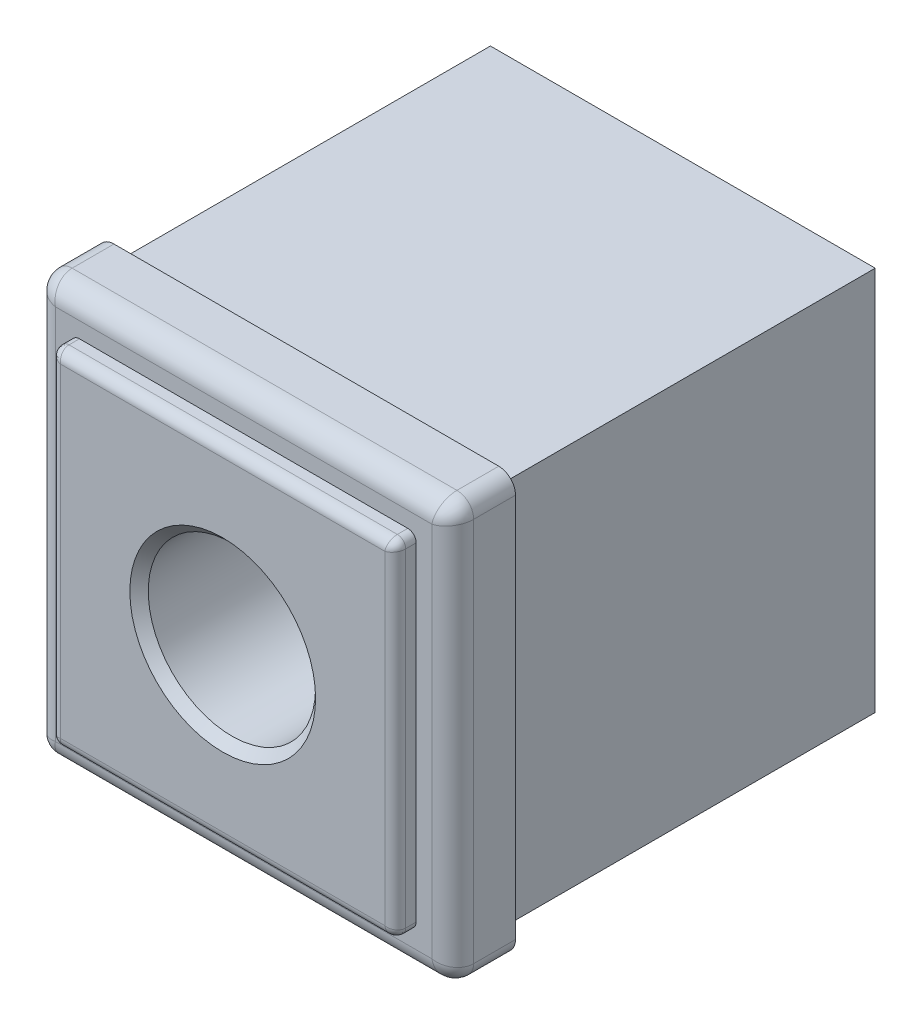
ISO-10303-21;
HEADER;
FILE_DESCRIPTION(('STEP AP214'),'2;1');
FILE_NAME('part.step','',(''),(''),'','','');
FILE_SCHEMA(('AUTOMOTIVE_DESIGN { 1 0 10303 214 1 1 1 1 }'));
ENDSEC;
DATA;
#1=APPLICATION_CONTEXT('core data for automotive mechanical design processes');
#2=APPLICATION_PROTOCOL_DEFINITION('international standard','automotive_design',2000,#1);
#3=PRODUCT_CONTEXT('',#1,'mechanical');
#4=PRODUCT('Part','Part','',(#3));
#5=PRODUCT_RELATED_PRODUCT_CATEGORY('part','',(#4));
#6=PRODUCT_DEFINITION_FORMATION('','',#4);
#7=PRODUCT_DEFINITION_CONTEXT('part definition',#1,'design');
#8=PRODUCT_DEFINITION('design','',#6,#7);
#9=PRODUCT_DEFINITION_SHAPE('','',#8);
#10=(LENGTH_UNIT() NAMED_UNIT(*) SI_UNIT(.MILLI.,.METRE.));
#11=(NAMED_UNIT(*) PLANE_ANGLE_UNIT() SI_UNIT($,.RADIAN.));
#12=(NAMED_UNIT(*) SI_UNIT($,.STERADIAN.) SOLID_ANGLE_UNIT());
#13=UNCERTAINTY_MEASURE_WITH_UNIT(LENGTH_MEASURE(1.E-05),#10,'distance_accuracy_value','');
#14=(GEOMETRIC_REPRESENTATION_CONTEXT(3) GLOBAL_UNCERTAINTY_ASSIGNED_CONTEXT((#13)) GLOBAL_UNIT_ASSIGNED_CONTEXT((#10,
#11,#12)) REPRESENTATION_CONTEXT('',''));
#15=CARTESIAN_POINT('',(0.,0.,0.));
#16=DIRECTION('',(0.,0.,1.));
#17=DIRECTION('',(1.,0.,0.));
#18=AXIS2_PLACEMENT_3D('',#15,#16,#17);
#19=CARTESIAN_POINT('',(25.,25.,7.5));
#20=DIRECTION('',(0.,0.,1.));
#21=DIRECTION('',(1.,0.,0.));
#22=AXIS2_PLACEMENT_3D('',#19,#20,#21);
#23=PLANE('',#22);
#24=DIRECTION('',(0.,1.,0.));
#25=VECTOR('',#24,1.);
#26=CARTESIAN_POINT('',(22.5,23.,7.5));
#27=LINE('',#26,#25);
#28=CARTESIAN_POINT('',(22.5,-22.5,7.5));
#29=VERTEX_POINT('',#28);
#30=CARTESIAN_POINT('',(22.5,22.5,7.5));
#31=VERTEX_POINT('',#30);
#32=EDGE_CURVE('E426',#29,#31,#27,.T.);
#33=ORIENTED_EDGE('',*,*,#32,.T.);
#34=DIRECTION('',(-1.,0.,0.));
#35=VECTOR('',#34,1.);
#36=CARTESIAN_POINT('',(-23.,22.5,7.5));
#37=LINE('',#36,#35);
#38=CARTESIAN_POINT('',(-22.5,22.5,7.5));
#39=VERTEX_POINT('',#38);
#40=EDGE_CURVE('E430',#31,#39,#37,.T.);
#41=ORIENTED_EDGE('',*,*,#40,.T.);
#42=DIRECTION('',(0.,-1.,0.));
#43=VECTOR('',#42,1.);
#44=CARTESIAN_POINT('',(-22.5,-23.,7.5));
#45=LINE('',#44,#43);
#46=CARTESIAN_POINT('',(-22.5,-22.5,7.5));
#47=VERTEX_POINT('',#46);
#48=EDGE_CURVE('E428',#39,#47,#45,.T.);
#49=ORIENTED_EDGE('',*,*,#48,.T.);
#50=DIRECTION('',(1.,0.,0.));
#51=VECTOR('',#50,1.);
#52=CARTESIAN_POINT('',(23.,-22.5,7.5));
#53=LINE('',#52,#51);
#54=EDGE_CURVE('E424',#47,#29,#53,.T.);
#55=ORIENTED_EDGE('',*,*,#54,.T.);
#56=EDGE_LOOP('',(#33,#41,#49,#55));
#57=FACE_BOUND('',#56,.T.);
#58=DIRECTION('',(1.,0.,0.));
#59=VECTOR('',#58,1.);
#60=CARTESIAN_POINT('',(-20.625,-20.625,7.5));
#61=LINE('',#60,#59);
#62=CARTESIAN_POINT('',(-19.625,-20.625,7.5));
#63=VERTEX_POINT('',#62);
#64=CARTESIAN_POINT('',(19.625,-20.625,7.5));
#65=VERTEX_POINT('',#64);
#66=EDGE_CURVE('E348',#63,#65,#61,.T.);
#67=ORIENTED_EDGE('',*,*,#66,.F.);
#68=CARTESIAN_POINT('',(-19.625,-19.625,7.5));
#69=DIRECTION('',(0.,0.,1.));
#70=DIRECTION('',(1.,0.,0.));
#71=AXIS2_PLACEMENT_3D('',#68,#69,#70);
#72=CIRCLE('',#71,1.);
#73=CARTESIAN_POINT('',(-20.625,-19.625,7.5));
#74=VERTEX_POINT('',#73);
#75=EDGE_CURVE('E420',#63,#74,#72,.F.);
#76=ORIENTED_EDGE('',*,*,#75,.T.);
#77=DIRECTION('',(0.,-1.,0.));
#78=VECTOR('',#77,1.);
#79=CARTESIAN_POINT('',(-20.625,20.625,7.5));
#80=LINE('',#79,#78);
#81=CARTESIAN_POINT('',(-20.625,19.625,7.5));
#82=VERTEX_POINT('',#81);
#83=EDGE_CURVE('E345',#82,#74,#80,.T.);
#84=ORIENTED_EDGE('',*,*,#83,.F.);
#85=CARTESIAN_POINT('',(-19.625,19.625,7.5));
#86=DIRECTION('',(0.,0.,1.));
#87=DIRECTION('',(1.,0.,0.));
#88=AXIS2_PLACEMENT_3D('',#85,#86,#87);
#89=CIRCLE('',#88,1.);
#90=CARTESIAN_POINT('',(-19.625,20.625,7.5));
#91=VERTEX_POINT('',#90);
#92=EDGE_CURVE('E416',#82,#91,#89,.F.);
#93=ORIENTED_EDGE('',*,*,#92,.T.);
#94=DIRECTION('',(-1.,0.,0.));
#95=VECTOR('',#94,1.);
#96=CARTESIAN_POINT('',(-20.625,20.625,7.5));
#97=LINE('',#96,#95);
#98=CARTESIAN_POINT('',(19.625,20.625,7.5));
#99=VERTEX_POINT('',#98);
#100=EDGE_CURVE('E354',#99,#91,#97,.T.);
#101=ORIENTED_EDGE('',*,*,#100,.F.);
#102=CARTESIAN_POINT('',(19.625,19.625,7.5));
#103=DIRECTION('',(0.,0.,1.));
#104=DIRECTION('',(1.,0.,0.));
#105=AXIS2_PLACEMENT_3D('',#102,#103,#104);
#106=CIRCLE('',#105,1.);
#107=CARTESIAN_POINT('',(20.625,19.625,7.5));
#108=VERTEX_POINT('',#107);
#109=EDGE_CURVE('E418',#99,#108,#106,.F.);
#110=ORIENTED_EDGE('',*,*,#109,.T.);
#111=DIRECTION('',(0.,1.,0.));
#112=VECTOR('',#111,1.);
#113=CARTESIAN_POINT('',(20.625,20.625,7.5));
#114=LINE('',#113,#112);
#115=CARTESIAN_POINT('',(20.625,-19.625,7.5));
#116=VERTEX_POINT('',#115);
#117=EDGE_CURVE('E351',#116,#108,#114,.T.);
#118=ORIENTED_EDGE('',*,*,#117,.F.);
#119=CARTESIAN_POINT('',(19.625,-19.625,7.5));
#120=DIRECTION('',(0.,0.,1.));
#121=DIRECTION('',(1.,0.,0.));
#122=AXIS2_PLACEMENT_3D('',#119,#120,#121);
#123=CIRCLE('',#122,1.);
#124=EDGE_CURVE('E422',#116,#65,#123,.F.);
#125=ORIENTED_EDGE('',*,*,#124,.T.);
#126=EDGE_LOOP('',(#67,#76,#84,#93,#101,#110,#118,#125));
#127=FACE_BOUND('',#126,.T.);
#128=ADVANCED_FACE('F14',(#57,#127),#23,.T.);
#129=CARTESIAN_POINT('',(-23.25,-23.25,-45.));
#130=DIRECTION('',(0.,0.,1.));
#131=DIRECTION('',(1.,0.,0.));
#132=AXIS2_PLACEMENT_3D('',#129,#130,#131);
#133=PLANE('',#132);
#134=DIRECTION('',(0.,1.,0.));
#135=VECTOR('',#134,1.);
#136=CARTESIAN_POINT('',(-23.,-23.,-45.));
#137=LINE('',#136,#135);
#138=CARTESIAN_POINT('',(-23.,-23.,-45.));
#139=VERTEX_POINT('',#138);
#140=CARTESIAN_POINT('',(-23.,23.,-45.));
#141=VERTEX_POINT('',#140);
#142=EDGE_CURVE('E198',#139,#141,#137,.T.);
#143=ORIENTED_EDGE('',*,*,#142,.T.);
#144=DIRECTION('',(1.,0.,0.));
#145=VECTOR('',#144,1.);
#146=CARTESIAN_POINT('',(-23.,23.,-45.));
#147=LINE('',#146,#145);
#148=CARTESIAN_POINT('',(23.,23.,-45.));
#149=VERTEX_POINT('',#148);
#150=EDGE_CURVE('E29',#141,#149,#147,.T.);
#151=ORIENTED_EDGE('',*,*,#150,.T.);
#152=DIRECTION('',(0.,-1.,0.));
#153=VECTOR('',#152,1.);
#154=CARTESIAN_POINT('',(23.,23.,-45.));
#155=LINE('',#154,#153);
#156=CARTESIAN_POINT('',(23.,-23.,-45.));
#157=VERTEX_POINT('',#156);
#158=EDGE_CURVE('E187',#149,#157,#155,.T.);
#159=ORIENTED_EDGE('',*,*,#158,.T.);
#160=DIRECTION('',(-1.,0.,0.));
#161=VECTOR('',#160,1.);
#162=CARTESIAN_POINT('',(23.,-23.,-45.));
#163=LINE('',#162,#161);
#164=EDGE_CURVE('E192',#157,#139,#163,.T.);
#165=ORIENTED_EDGE('',*,*,#164,.T.);
#166=EDGE_LOOP('',(#143,#151,#159,#165));
#167=FACE_BOUND('',#166,.T.);
#168=CARTESIAN_POINT('',(0.,0.,-45.));
#169=DIRECTION('',(0.,0.,1.));
#170=DIRECTION('',(1.,0.,0.));
#171=AXIS2_PLACEMENT_3D('',#168,#169,#170);
#172=CIRCLE('',#171,10.);
#173=CARTESIAN_POINT('',(10.,0.,-45.));
#174=VERTEX_POINT('',#173);
#175=EDGE_CURVE('E183',#174,#174,#172,.T.);
#176=ORIENTED_EDGE('',*,*,#175,.T.);
#177=EDGE_LOOP('',(#176));
#178=FACE_BOUND('',#177,.T.);
#179=ADVANCED_FACE('F195',(#167,#178),#133,.F.);
#180=CARTESIAN_POINT('',(25.,25.,0.));
#181=DIRECTION('',(0.,0.,1.));
#182=DIRECTION('',(1.,0.,0.));
#183=AXIS2_PLACEMENT_3D('',#180,#181,#182);
#184=PLANE('',#183);
#185=DIRECTION('',(-1.,0.,0.));
#186=VECTOR('',#185,1.);
#187=CARTESIAN_POINT('',(-25.,25.,0.));
#188=LINE('',#187,#186);
#189=CARTESIAN_POINT('',(23.,25.,0.));
#190=VERTEX_POINT('',#189);
#191=CARTESIAN_POINT('',(-23.,25.,0.));
#192=VERTEX_POINT('',#191);
#193=EDGE_CURVE('E360',#190,#192,#188,.T.);
#194=ORIENTED_EDGE('',*,*,#193,.F.);
#195=CARTESIAN_POINT('',(23.,23.,0.));
#196=DIRECTION('',(0.,0.,1.));
#197=DIRECTION('',(1.,0.,0.));
#198=AXIS2_PLACEMENT_3D('',#195,#196,#197);
#199=CIRCLE('',#198,2.);
#200=CARTESIAN_POINT('',(25.,23.,0.));
#201=VERTEX_POINT('',#200);
#202=EDGE_CURVE('E380',#190,#201,#199,.F.);
#203=ORIENTED_EDGE('',*,*,#202,.T.);
#204=DIRECTION('',(0.,1.,0.));
#205=VECTOR('',#204,1.);
#206=CARTESIAN_POINT('',(25.,25.,0.));
#207=LINE('',#206,#205);
#208=CARTESIAN_POINT('',(25.,-23.,0.));
#209=VERTEX_POINT('',#208);
#210=EDGE_CURVE('E357',#209,#201,#207,.T.);
#211=ORIENTED_EDGE('',*,*,#210,.F.);
#212=CARTESIAN_POINT('',(23.,-23.,0.));
#213=DIRECTION('',(0.,0.,1.));
#214=DIRECTION('',(1.,0.,0.));
#215=AXIS2_PLACEMENT_3D('',#212,#213,#214);
#216=CIRCLE('',#215,2.);
#217=CARTESIAN_POINT('',(23.,-25.,0.));
#218=VERTEX_POINT('',#217);
#219=EDGE_CURVE('E376',#209,#218,#216,.F.);
#220=ORIENTED_EDGE('',*,*,#219,.T.);
#221=DIRECTION('',(1.,0.,0.));
#222=VECTOR('',#221,1.);
#223=CARTESIAN_POINT('',(-25.,-25.,0.));
#224=LINE('',#223,#222);
#225=CARTESIAN_POINT('',(-23.,-25.,0.));
#226=VERTEX_POINT('',#225);
#227=EDGE_CURVE('E366',#226,#218,#224,.T.);
#228=ORIENTED_EDGE('',*,*,#227,.F.);
#229=CARTESIAN_POINT('',(-23.,-23.,0.));
#230=DIRECTION('',(0.,0.,1.));
#231=DIRECTION('',(1.,0.,0.));
#232=AXIS2_PLACEMENT_3D('',#229,#230,#231);
#233=CIRCLE('',#232,2.);
#234=CARTESIAN_POINT('',(-25.,-23.,0.));
#235=VERTEX_POINT('',#234);
#236=EDGE_CURVE('E374',#226,#235,#233,.F.);
#237=ORIENTED_EDGE('',*,*,#236,.T.);
#238=DIRECTION('',(0.,-1.,0.));
#239=VECTOR('',#238,1.);
#240=CARTESIAN_POINT('',(-25.,25.,0.));
#241=LINE('',#240,#239);
#242=CARTESIAN_POINT('',(-25.,23.,0.));
#243=VERTEX_POINT('',#242);
#244=EDGE_CURVE('E363',#243,#235,#241,.T.);
#245=ORIENTED_EDGE('',*,*,#244,.F.);
#246=CARTESIAN_POINT('',(-23.,23.,0.));
#247=DIRECTION('',(0.,0.,1.));
#248=DIRECTION('',(1.,0.,0.));
#249=AXIS2_PLACEMENT_3D('',#246,#247,#248);
#250=CIRCLE('',#249,2.);
#251=EDGE_CURVE('E378',#243,#192,#250,.F.);
#252=ORIENTED_EDGE('',*,*,#251,.T.);
#253=EDGE_LOOP('',(#194,#203,#211,#220,#228,#237,#245,#252));
#254=FACE_BOUND('',#253,.T.);
#255=DIRECTION('',(1.,0.,0.));
#256=VECTOR('',#255,1.);
#257=CARTESIAN_POINT('',(-23.,23.,0.));
#258=LINE('',#257,#256);
#259=CARTESIAN_POINT('',(-23.,23.,0.));
#260=VERTEX_POINT('',#259);
#261=CARTESIAN_POINT('',(23.,23.,0.));
#262=VERTEX_POINT('',#261);
#263=EDGE_CURVE('E180',#260,#262,#258,.T.);
#264=ORIENTED_EDGE('',*,*,#263,.F.);
#265=DIRECTION('',(0.,1.,0.));
#266=VECTOR('',#265,1.);
#267=CARTESIAN_POINT('',(-23.,-23.,0.));
#268=LINE('',#267,#266);
#269=CARTESIAN_POINT('',(-23.,-23.,0.));
#270=VERTEX_POINT('',#269);
#271=EDGE_CURVE('E199',#270,#260,#268,.T.);
#272=ORIENTED_EDGE('',*,*,#271,.F.);
#273=DIRECTION('',(-1.,0.,0.));
#274=VECTOR('',#273,1.);
#275=CARTESIAN_POINT('',(23.,-23.,0.));
#276=LINE('',#275,#274);
#277=CARTESIAN_POINT('',(23.,-23.,0.));
#278=VERTEX_POINT('',#277);
#279=EDGE_CURVE('E202',#278,#270,#276,.T.);
#280=ORIENTED_EDGE('',*,*,#279,.F.);
#281=DIRECTION('',(0.,-1.,0.));
#282=VECTOR('',#281,1.);
#283=CARTESIAN_POINT('',(23.,23.,0.));
#284=LINE('',#283,#282);
#285=EDGE_CURVE('E209',#262,#278,#284,.T.);
#286=ORIENTED_EDGE('',*,*,#285,.F.);
#287=EDGE_LOOP('',(#264,#272,#280,#286));
#288=FACE_BOUND('',#287,.T.);
#289=ADVANCED_FACE('F497',(#254,#288),#184,.F.);
#290=CARTESIAN_POINT('',(25.,25.,7.5));
#291=DIRECTION('',(-1.,0.,0.));
#292=DIRECTION('',(0.,-1.,0.));
#293=AXIS2_PLACEMENT_3D('',#290,#291,#292);
#294=PLANE('',#293);
#295=DIRECTION('',(0.,0.,-1.));
#296=VECTOR('',#295,1.);
#297=CARTESIAN_POINT('',(25.,23.,7.5));
#298=LINE('',#297,#296);
#299=CARTESIAN_POINT('',(25.,23.,5.));
#300=VERTEX_POINT('',#299);
#301=EDGE_CURVE('E384',#201,#300,#298,.F.);
#302=ORIENTED_EDGE('',*,*,#301,.T.);
#303=DIRECTION('',(0.,1.,0.));
#304=VECTOR('',#303,1.);
#305=CARTESIAN_POINT('',(25.,-23.,5.));
#306=LINE('',#305,#304);
#307=CARTESIAN_POINT('',(25.,-23.,5.));
#308=VERTEX_POINT('',#307);
#309=EDGE_CURVE('E442',#300,#308,#306,.F.);
#310=ORIENTED_EDGE('',*,*,#309,.T.);
#311=DIRECTION('',(0.,0.,-1.));
#312=VECTOR('',#311,1.);
#313=CARTESIAN_POINT('',(25.,-23.,7.5));
#314=LINE('',#313,#312);
#315=EDGE_CURVE('E382',#308,#209,#314,.T.);
#316=ORIENTED_EDGE('',*,*,#315,.T.);
#317=ORIENTED_EDGE('',*,*,#210,.T.);
#318=EDGE_LOOP('',(#302,#310,#316,#317));
#319=FACE_BOUND('',#318,.T.);
#320=ADVANCED_FACE('F514',(#319),#294,.F.);
#321=CARTESIAN_POINT('',(-25.,25.,7.5));
#322=DIRECTION('',(0.,-1.,0.));
#323=DIRECTION('',(0.,0.,-1.));
#324=AXIS2_PLACEMENT_3D('',#321,#322,#323);
#325=PLANE('',#324);
#326=DIRECTION('',(0.,0.,-1.));
#327=VECTOR('',#326,1.);
#328=CARTESIAN_POINT('',(-23.,25.,7.5));
#329=LINE('',#328,#327);
#330=CARTESIAN_POINT('',(-23.,25.,5.));
#331=VERTEX_POINT('',#330);
#332=EDGE_CURVE('E369',#192,#331,#329,.F.);
#333=ORIENTED_EDGE('',*,*,#332,.T.);
#334=DIRECTION('',(-1.,0.,0.));
#335=VECTOR('',#334,1.);
#336=CARTESIAN_POINT('',(23.,25.,5.));
#337=LINE('',#336,#335);
#338=CARTESIAN_POINT('',(23.,25.,5.));
#339=VERTEX_POINT('',#338);
#340=EDGE_CURVE('E433',#331,#339,#337,.F.);
#341=ORIENTED_EDGE('',*,*,#340,.T.);
#342=DIRECTION('',(0.,0.,-1.));
#343=VECTOR('',#342,1.);
#344=CARTESIAN_POINT('',(23.,25.,7.5));
#345=LINE('',#344,#343);
#346=EDGE_CURVE('E372',#339,#190,#345,.T.);
#347=ORIENTED_EDGE('',*,*,#346,.T.);
#348=ORIENTED_EDGE('',*,*,#193,.T.);
#349=EDGE_LOOP('',(#333,#341,#347,#348));
#350=FACE_BOUND('',#349,.T.);
#351=ADVANCED_FACE('F510',(#350),#325,.F.);
#352=CARTESIAN_POINT('',(-25.,25.,7.5));
#353=DIRECTION('',(1.,0.,0.));
#354=DIRECTION('',(0.,1.,0.));
#355=AXIS2_PLACEMENT_3D('',#352,#353,#354);
#356=PLANE('',#355);
#357=DIRECTION('',(0.,0.,-1.));
#358=VECTOR('',#357,1.);
#359=CARTESIAN_POINT('',(-25.,-23.,7.5));
#360=LINE('',#359,#358);
#361=CARTESIAN_POINT('',(-25.,-23.,5.));
#362=VERTEX_POINT('',#361);
#363=EDGE_CURVE('E387',#235,#362,#360,.F.);
#364=ORIENTED_EDGE('',*,*,#363,.T.);
#365=DIRECTION('',(0.,-1.,0.));
#366=VECTOR('',#365,1.);
#367=CARTESIAN_POINT('',(-25.,23.,5.));
#368=LINE('',#367,#366);
#369=CARTESIAN_POINT('',(-25.,23.,5.));
#370=VERTEX_POINT('',#369);
#371=EDGE_CURVE('E440',#362,#370,#368,.F.);
#372=ORIENTED_EDGE('',*,*,#371,.T.);
#373=DIRECTION('',(0.,0.,-1.));
#374=VECTOR('',#373,1.);
#375=CARTESIAN_POINT('',(-25.,23.,7.5));
#376=LINE('',#375,#374);
#377=EDGE_CURVE('E390',#370,#243,#376,.T.);
#378=ORIENTED_EDGE('',*,*,#377,.T.);
#379=ORIENTED_EDGE('',*,*,#244,.T.);
#380=EDGE_LOOP('',(#364,#372,#378,#379));
#381=FACE_BOUND('',#380,.T.);
#382=ADVANCED_FACE('F506',(#381),#356,.F.);
#383=CARTESIAN_POINT('',(-25.,-25.,7.5));
#384=DIRECTION('',(0.,1.,0.));
#385=DIRECTION('',(-1.,0.,0.));
#386=AXIS2_PLACEMENT_3D('',#383,#384,#385);
#387=PLANE('',#386);
#388=DIRECTION('',(0.,0.,-1.));
#389=VECTOR('',#388,1.);
#390=CARTESIAN_POINT('',(23.,-25.,7.5));
#391=LINE('',#390,#389);
#392=CARTESIAN_POINT('',(23.,-25.,5.));
#393=VERTEX_POINT('',#392);
#394=EDGE_CURVE('E394',#218,#393,#391,.F.);
#395=ORIENTED_EDGE('',*,*,#394,.T.);
#396=DIRECTION('',(1.,0.,0.));
#397=VECTOR('',#396,1.);
#398=CARTESIAN_POINT('',(-23.,-25.,5.));
#399=LINE('',#398,#397);
#400=CARTESIAN_POINT('',(-23.,-25.,5.));
#401=VERTEX_POINT('',#400);
#402=EDGE_CURVE('E448',#393,#401,#399,.F.);
#403=ORIENTED_EDGE('',*,*,#402,.T.);
#404=DIRECTION('',(0.,0.,-1.));
#405=VECTOR('',#404,1.);
#406=CARTESIAN_POINT('',(-23.,-25.,7.5));
#407=LINE('',#406,#405);
#408=EDGE_CURVE('E392',#401,#226,#407,.T.);
#409=ORIENTED_EDGE('',*,*,#408,.T.);
#410=ORIENTED_EDGE('',*,*,#227,.T.);
#411=EDGE_LOOP('',(#395,#403,#409,#410));
#412=FACE_BOUND('',#411,.T.);
#413=ADVANCED_FACE('F502',(#412),#387,.F.);
#414=CARTESIAN_POINT('',(-20.625,20.625,10.));
#415=DIRECTION('',(1.,0.,0.));
#416=DIRECTION('',(0.,0.,-1.));
#417=AXIS2_PLACEMENT_3D('',#414,#415,#416);
#418=PLANE('',#417);
#419=DIRECTION('',(0.,0.,-1.));
#420=VECTOR('',#419,1.);
#421=CARTESIAN_POINT('',(-20.625,-19.625,10.));
#422=LINE('',#421,#420);
#423=CARTESIAN_POINT('',(-20.625,-19.625,8.75));
#424=VERTEX_POINT('',#423);
#425=EDGE_CURVE('E397',#74,#424,#422,.F.);
#426=ORIENTED_EDGE('',*,*,#425,.T.);
#427=DIRECTION('',(0.,-1.,0.));
#428=VECTOR('',#427,1.);
#429=CARTESIAN_POINT('',(-20.625,19.625,8.75));
#430=LINE('',#429,#428);
#431=CARTESIAN_POINT('',(-20.625,19.625,8.75));
#432=VERTEX_POINT('',#431);
#433=EDGE_CURVE('E459',#424,#432,#430,.F.);
#434=ORIENTED_EDGE('',*,*,#433,.T.);
#435=DIRECTION('',(0.,0.,-1.));
#436=VECTOR('',#435,1.);
#437=CARTESIAN_POINT('',(-20.625,19.625,10.));
#438=LINE('',#437,#436);
#439=EDGE_CURVE('E400',#432,#82,#438,.T.);
#440=ORIENTED_EDGE('',*,*,#439,.T.);
#441=ORIENTED_EDGE('',*,*,#83,.T.);
#442=EDGE_LOOP('',(#426,#434,#440,#441));
#443=FACE_BOUND('',#442,.T.);
#444=ADVANCED_FACE('F505',(#443),#418,.F.);
#445=CARTESIAN_POINT('',(-20.625,-20.625,10.));
#446=DIRECTION('',(0.,1.,0.));
#447=DIRECTION('',(-1.,0.,0.));
#448=AXIS2_PLACEMENT_3D('',#445,#446,#447);
#449=PLANE('',#448);
#450=DIRECTION('',(0.,0.,-1.));
#451=VECTOR('',#450,1.);
#452=CARTESIAN_POINT('',(19.625,-20.625,10.));
#453=LINE('',#452,#451);
#454=CARTESIAN_POINT('',(19.625,-20.625,8.75));
#455=VERTEX_POINT('',#454);
#456=EDGE_CURVE('E411',#65,#455,#453,.F.);
#457=ORIENTED_EDGE('',*,*,#456,.T.);
#458=DIRECTION('',(1.,0.,0.));
#459=VECTOR('',#458,1.);
#460=CARTESIAN_POINT('',(-19.625,-20.625,8.75));
#461=LINE('',#460,#459);
#462=CARTESIAN_POINT('',(-19.625,-20.625,8.75));
#463=VERTEX_POINT('',#462);
#464=EDGE_CURVE('E466',#455,#463,#461,.F.);
#465=ORIENTED_EDGE('',*,*,#464,.T.);
#466=DIRECTION('',(0.,0.,-1.));
#467=VECTOR('',#466,1.);
#468=CARTESIAN_POINT('',(-19.625,-20.625,10.));
#469=LINE('',#468,#467);
#470=EDGE_CURVE('E414',#463,#63,#469,.T.);
#471=ORIENTED_EDGE('',*,*,#470,.T.);
#472=ORIENTED_EDGE('',*,*,#66,.T.);
#473=EDGE_LOOP('',(#457,#465,#471,#472));
#474=FACE_BOUND('',#473,.T.);
#475=ADVANCED_FACE('F603',(#474),#449,.F.);
#476=CARTESIAN_POINT('',(20.625,20.625,10.));
#477=DIRECTION('',(-1.,0.,0.));
#478=DIRECTION('',(0.,-1.,0.));
#479=AXIS2_PLACEMENT_3D('',#476,#477,#478);
#480=PLANE('',#479);
#481=DIRECTION('',(0.,0.,-1.));
#482=VECTOR('',#481,1.);
#483=CARTESIAN_POINT('',(20.625,19.625,10.));
#484=LINE('',#483,#482);
#485=CARTESIAN_POINT('',(20.625,19.625,8.75));
#486=VERTEX_POINT('',#485);
#487=EDGE_CURVE('E409',#108,#486,#484,.F.);
#488=ORIENTED_EDGE('',*,*,#487,.T.);
#489=DIRECTION('',(0.,1.,0.));
#490=VECTOR('',#489,1.);
#491=CARTESIAN_POINT('',(20.625,-19.625,8.75));
#492=LINE('',#491,#490);
#493=CARTESIAN_POINT('',(20.625,-19.625,8.75));
#494=VERTEX_POINT('',#493);
#495=EDGE_CURVE('E473',#486,#494,#492,.F.);
#496=ORIENTED_EDGE('',*,*,#495,.T.);
#497=DIRECTION('',(0.,0.,-1.));
#498=VECTOR('',#497,1.);
#499=CARTESIAN_POINT('',(20.625,-19.625,10.));
#500=LINE('',#499,#498);
#501=EDGE_CURVE('E407',#494,#116,#500,.T.);
#502=ORIENTED_EDGE('',*,*,#501,.T.);
#503=ORIENTED_EDGE('',*,*,#117,.T.);
#504=EDGE_LOOP('',(#488,#496,#502,#503));
#505=FACE_BOUND('',#504,.T.);
#506=ADVANCED_FACE('F599',(#505),#480,.F.);
#507=CARTESIAN_POINT('',(-20.625,20.625,10.));
#508=DIRECTION('',(0.,-1.,0.));
#509=DIRECTION('',(1.,0.,0.));
#510=AXIS2_PLACEMENT_3D('',#507,#508,#509);
#511=PLANE('',#510);
#512=DIRECTION('',(0.,0.,-1.));
#513=VECTOR('',#512,1.);
#514=CARTESIAN_POINT('',(-19.625,20.625,10.));
#515=LINE('',#514,#513);
#516=CARTESIAN_POINT('',(-19.625,20.625,8.75));
#517=VERTEX_POINT('',#516);
#518=EDGE_CURVE('E404',#91,#517,#515,.F.);
#519=ORIENTED_EDGE('',*,*,#518,.T.);
#520=DIRECTION('',(-1.,0.,0.));
#521=VECTOR('',#520,1.);
#522=CARTESIAN_POINT('',(19.625,20.625,8.75));
#523=LINE('',#522,#521);
#524=CARTESIAN_POINT('',(19.625,20.625,8.75));
#525=VERTEX_POINT('',#524);
#526=EDGE_CURVE('E468',#517,#525,#523,.F.);
#527=ORIENTED_EDGE('',*,*,#526,.T.);
#528=DIRECTION('',(0.,0.,-1.));
#529=VECTOR('',#528,1.);
#530=CARTESIAN_POINT('',(19.625,20.625,10.));
#531=LINE('',#530,#529);
#532=EDGE_CURVE('E402',#525,#99,#531,.T.);
#533=ORIENTED_EDGE('',*,*,#532,.T.);
#534=ORIENTED_EDGE('',*,*,#100,.T.);
#535=EDGE_LOOP('',(#519,#527,#533,#534));
#536=FACE_BOUND('',#535,.T.);
#537=ADVANCED_FACE('F595',(#536),#511,.F.);
#538=CARTESIAN_POINT('',(-20.625,-20.625,10.));
#539=DIRECTION('',(0.,0.,1.));
#540=DIRECTION('',(1.,0.,0.));
#541=AXIS2_PLACEMENT_3D('',#538,#539,#540);
#542=PLANE('',#541);
#543=CARTESIAN_POINT('',(0.,0.,10.));
#544=DIRECTION('',(0.,0.,1.));
#545=DIRECTION('',(1.,0.,0.));
#546=AXIS2_PLACEMENT_3D('',#543,#544,#545);
#547=CIRCLE('',#546,11.1);
#548=CARTESIAN_POINT('',(11.1,0.,10.));
#549=VERTEX_POINT('',#548);
#550=EDGE_CURVE('E9',#549,#549,#547,.F.);
#551=ORIENTED_EDGE('',*,*,#550,.T.);
#552=EDGE_LOOP('',(#551));
#553=FACE_BOUND('',#552,.T.);
#554=DIRECTION('',(-1.,0.,0.));
#555=VECTOR('',#554,1.);
#556=CARTESIAN_POINT('',(-19.625,19.375,10.));
#557=LINE('',#556,#555);
#558=CARTESIAN_POINT('',(19.375,19.375,10.));
#559=VERTEX_POINT('',#558);
#560=CARTESIAN_POINT('',(-19.375,19.375,10.));
#561=VERTEX_POINT('',#560);
#562=EDGE_CURVE('E452',#559,#561,#557,.T.);
#563=ORIENTED_EDGE('',*,*,#562,.T.);
#564=DIRECTION('',(0.,-1.,0.));
#565=VECTOR('',#564,1.);
#566=CARTESIAN_POINT('',(-19.375,-19.625,10.));
#567=LINE('',#566,#565);
#568=CARTESIAN_POINT('',(-19.375,-19.375,10.));
#569=VERTEX_POINT('',#568);
#570=EDGE_CURVE('E456',#561,#569,#567,.T.);
#571=ORIENTED_EDGE('',*,*,#570,.T.);
#572=DIRECTION('',(1.,0.,0.));
#573=VECTOR('',#572,1.);
#574=CARTESIAN_POINT('',(19.625,-19.375,10.));
#575=LINE('',#574,#573);
#576=CARTESIAN_POINT('',(19.375,-19.375,10.));
#577=VERTEX_POINT('',#576);
#578=EDGE_CURVE('E454',#569,#577,#575,.T.);
#579=ORIENTED_EDGE('',*,*,#578,.T.);
#580=DIRECTION('',(0.,1.,0.));
#581=VECTOR('',#580,1.);
#582=CARTESIAN_POINT('',(19.375,19.625,10.));
#583=LINE('',#582,#581);
#584=EDGE_CURVE('E450',#577,#559,#583,.T.);
#585=ORIENTED_EDGE('',*,*,#584,.T.);
#586=EDGE_LOOP('',(#563,#571,#579,#585));
#587=FACE_BOUND('',#586,.T.);
#588=ADVANCED_FACE('F592',(#553,#587),#542,.T.);
#589=CARTESIAN_POINT('',(23.,23.,7.5));
#590=DIRECTION('',(0.,0.,-1.));
#591=DIRECTION('',(-1.,0.,0.));
#592=AXIS2_PLACEMENT_3D('',#589,#590,#591);
#593=CYLINDRICAL_SURFACE('',#592,2.);
#594=ORIENTED_EDGE('',*,*,#346,.F.);
#595=CARTESIAN_POINT('',(23.,23.,5.));
#596=DIRECTION('',(0.,0.,-1.));
#597=DIRECTION('',(-1.,0.,0.));
#598=AXIS2_PLACEMENT_3D('',#595,#596,#597);
#599=CIRCLE('',#598,2.);
#600=EDGE_CURVE('E438',#339,#300,#599,.T.);
#601=ORIENTED_EDGE('',*,*,#600,.T.);
#602=ORIENTED_EDGE('',*,*,#301,.F.);
#603=ORIENTED_EDGE('',*,*,#202,.F.);
#604=EDGE_LOOP('',(#594,#601,#602,#603));
#605=FACE_BOUND('',#604,.T.);
#606=ADVANCED_FACE('F586',(#605),#593,.T.);
#607=CARTESIAN_POINT('',(-23.,23.,7.5));
#608=DIRECTION('',(0.,0.,-1.));
#609=DIRECTION('',(-1.,0.,0.));
#610=AXIS2_PLACEMENT_3D('',#607,#608,#609);
#611=CYLINDRICAL_SURFACE('',#610,2.);
#612=ORIENTED_EDGE('',*,*,#377,.F.);
#613=CARTESIAN_POINT('',(-23.,23.,5.));
#614=DIRECTION('',(0.,0.,-1.));
#615=DIRECTION('',(-1.,0.,0.));
#616=AXIS2_PLACEMENT_3D('',#613,#614,#615);
#617=CIRCLE('',#616,2.);
#618=EDGE_CURVE('E436',#370,#331,#617,.T.);
#619=ORIENTED_EDGE('',*,*,#618,.T.);
#620=ORIENTED_EDGE('',*,*,#332,.F.);
#621=ORIENTED_EDGE('',*,*,#251,.F.);
#622=EDGE_LOOP('',(#612,#619,#620,#621));
#623=FACE_BOUND('',#622,.T.);
#624=ADVANCED_FACE('F551',(#623),#611,.T.);
#625=CARTESIAN_POINT('',(23.,-23.,7.5));
#626=DIRECTION('',(0.,0.,-1.));
#627=DIRECTION('',(-1.,0.,0.));
#628=AXIS2_PLACEMENT_3D('',#625,#626,#627);
#629=CYLINDRICAL_SURFACE('',#628,2.);
#630=ORIENTED_EDGE('',*,*,#315,.F.);
#631=CARTESIAN_POINT('',(23.,-23.,5.));
#632=DIRECTION('',(0.,0.,-1.));
#633=DIRECTION('',(-1.,0.,0.));
#634=AXIS2_PLACEMENT_3D('',#631,#632,#633);
#635=CIRCLE('',#634,2.);
#636=EDGE_CURVE('E446',#308,#393,#635,.T.);
#637=ORIENTED_EDGE('',*,*,#636,.T.);
#638=ORIENTED_EDGE('',*,*,#394,.F.);
#639=ORIENTED_EDGE('',*,*,#219,.F.);
#640=EDGE_LOOP('',(#630,#637,#638,#639));
#641=FACE_BOUND('',#640,.T.);
#642=ADVANCED_FACE('F575',(#641),#629,.T.);
#643=CARTESIAN_POINT('',(-23.,-23.,7.5));
#644=DIRECTION('',(0.,0.,-1.));
#645=DIRECTION('',(-1.,0.,0.));
#646=AXIS2_PLACEMENT_3D('',#643,#644,#645);
#647=CYLINDRICAL_SURFACE('',#646,2.);
#648=ORIENTED_EDGE('',*,*,#408,.F.);
#649=CARTESIAN_POINT('',(-23.,-23.,5.));
#650=DIRECTION('',(0.,0.,-1.));
#651=DIRECTION('',(-1.,0.,0.));
#652=AXIS2_PLACEMENT_3D('',#649,#650,#651);
#653=CIRCLE('',#652,2.);
#654=EDGE_CURVE('E444',#401,#362,#653,.T.);
#655=ORIENTED_EDGE('',*,*,#654,.T.);
#656=ORIENTED_EDGE('',*,*,#363,.F.);
#657=ORIENTED_EDGE('',*,*,#236,.F.);
#658=EDGE_LOOP('',(#648,#655,#656,#657));
#659=FACE_BOUND('',#658,.T.);
#660=ADVANCED_FACE('F563',(#659),#647,.T.);
#661=CARTESIAN_POINT('',(-19.625,19.625,10.));
#662=DIRECTION('',(0.,0.,-1.));
#663=DIRECTION('',(-1.,0.,0.));
#664=AXIS2_PLACEMENT_3D('',#661,#662,#663);
#665=CYLINDRICAL_SURFACE('',#664,1.);
#666=ORIENTED_EDGE('',*,*,#439,.F.);
#667=CARTESIAN_POINT('',(-19.625,19.625,8.75));
#668=DIRECTION('',(0.,0.,-1.));
#669=DIRECTION('',(-1.,0.,0.));
#670=AXIS2_PLACEMENT_3D('',#667,#668,#669);
#671=CIRCLE('',#670,1.);
#672=EDGE_CURVE('E464',#432,#517,#671,.T.);
#673=ORIENTED_EDGE('',*,*,#672,.T.);
#674=ORIENTED_EDGE('',*,*,#518,.F.);
#675=ORIENTED_EDGE('',*,*,#92,.F.);
#676=EDGE_LOOP('',(#666,#673,#674,#675));
#677=FACE_BOUND('',#676,.T.);
#678=ADVANCED_FACE('F584',(#677),#665,.T.);
#679=CARTESIAN_POINT('',(19.625,19.625,10.));
#680=DIRECTION('',(0.,0.,-1.));
#681=DIRECTION('',(-1.,0.,0.));
#682=AXIS2_PLACEMENT_3D('',#679,#680,#681);
#683=CYLINDRICAL_SURFACE('',#682,1.);
#684=ORIENTED_EDGE('',*,*,#532,.F.);
#685=CARTESIAN_POINT('',(19.625,19.625,8.75));
#686=DIRECTION('',(0.,0.,-1.));
#687=DIRECTION('',(-1.,0.,0.));
#688=AXIS2_PLACEMENT_3D('',#685,#686,#687);
#689=CIRCLE('',#688,1.);
#690=EDGE_CURVE('E37',#525,#486,#689,.T.);
#691=ORIENTED_EDGE('',*,*,#690,.T.);
#692=ORIENTED_EDGE('',*,*,#487,.F.);
#693=ORIENTED_EDGE('',*,*,#109,.F.);
#694=EDGE_LOOP('',(#684,#691,#692,#693));
#695=FACE_BOUND('',#694,.T.);
#696=ADVANCED_FACE('F662',(#695),#683,.T.);
#697=CARTESIAN_POINT('',(-19.625,-19.625,10.));
#698=DIRECTION('',(0.,0.,-1.));
#699=DIRECTION('',(-1.,0.,0.));
#700=AXIS2_PLACEMENT_3D('',#697,#698,#699);
#701=CYLINDRICAL_SURFACE('',#700,1.);
#702=ORIENTED_EDGE('',*,*,#470,.F.);
#703=CARTESIAN_POINT('',(-19.625,-19.625,8.75));
#704=DIRECTION('',(0.,0.,-1.));
#705=DIRECTION('',(-1.,0.,0.));
#706=AXIS2_PLACEMENT_3D('',#703,#704,#705);
#707=CIRCLE('',#706,1.);
#708=EDGE_CURVE('E462',#463,#424,#707,.T.);
#709=ORIENTED_EDGE('',*,*,#708,.T.);
#710=ORIENTED_EDGE('',*,*,#425,.F.);
#711=ORIENTED_EDGE('',*,*,#75,.F.);
#712=EDGE_LOOP('',(#702,#709,#710,#711));
#713=FACE_BOUND('',#712,.T.);
#714=ADVANCED_FACE('F648',(#713),#701,.T.);
#715=CARTESIAN_POINT('',(19.625,-19.625,10.));
#716=DIRECTION('',(0.,0.,-1.));
#717=DIRECTION('',(-1.,0.,0.));
#718=AXIS2_PLACEMENT_3D('',#715,#716,#717);
#719=CYLINDRICAL_SURFACE('',#718,1.);
#720=ORIENTED_EDGE('',*,*,#501,.F.);
#721=CARTESIAN_POINT('',(19.625,-19.625,8.75));
#722=DIRECTION('',(0.,0.,-1.));
#723=DIRECTION('',(-1.,0.,0.));
#724=AXIS2_PLACEMENT_3D('',#721,#722,#723);
#725=CIRCLE('',#724,1.);
#726=EDGE_CURVE('E470',#494,#455,#725,.T.);
#727=ORIENTED_EDGE('',*,*,#726,.T.);
#728=ORIENTED_EDGE('',*,*,#456,.F.);
#729=ORIENTED_EDGE('',*,*,#124,.F.);
#730=EDGE_LOOP('',(#720,#727,#728,#729));
#731=FACE_BOUND('',#730,.T.);
#732=ADVANCED_FACE('F334',(#731),#719,.T.);
#733=CARTESIAN_POINT('',(25.,-22.5,5.));
#734=DIRECTION('',(-1.,0.,0.));
#735=DIRECTION('',(0.,-1.,0.));
#736=AXIS2_PLACEMENT_3D('',#733,#734,#735);
#737=CYLINDRICAL_SURFACE('',#736,2.5);
#738=CARTESIAN_POINT('',(-22.5,-22.5,5.));
#739=DIRECTION('',(0.98058067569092,-0.196116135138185,0.));
#740=DIRECTION('',(-0.196116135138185,-0.98058067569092,0.));
#741=AXIS2_PLACEMENT_3D('',#738,#739,#740);
#742=ELLIPSE('',#741,2.54950975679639,2.5);
#743=EDGE_CURVE('E316',#401,#47,#742,.F.);
#744=ORIENTED_EDGE('',*,*,#743,.F.);
#745=ORIENTED_EDGE('',*,*,#402,.F.);
#746=CARTESIAN_POINT('',(22.5,-22.5,5.));
#747=DIRECTION('',(0.98058067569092,0.196116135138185,0.));
#748=DIRECTION('',(0.196116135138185,-0.98058067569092,0.));
#749=AXIS2_PLACEMENT_3D('',#746,#747,#748);
#750=ELLIPSE('',#749,2.54950975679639,2.5);
#751=EDGE_CURVE('E319',#29,#393,#750,.T.);
#752=ORIENTED_EDGE('',*,*,#751,.F.);
#753=ORIENTED_EDGE('',*,*,#54,.F.);
#754=EDGE_LOOP('',(#744,#745,#752,#753));
#755=FACE_BOUND('',#754,.T.);
#756=ADVANCED_FACE('F330',(#755),#737,.T.);
#757=CARTESIAN_POINT('',(22.5,-22.5,2.5));
#758=CARTESIAN_POINT('',(22.5,-22.5,2.5));
#759=CARTESIAN_POINT('',(22.5,-22.5,2.5));
#760=CARTESIAN_POINT('',(22.6089118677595,-22.5217823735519,2.50004381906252));
#761=CARTESIAN_POINT('',(22.5653589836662,-22.5653589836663,2.50009789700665));
#762=CARTESIAN_POINT('',(22.5217823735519,-22.6089118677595,2.50004381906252));
#763=CARTESIAN_POINT('',(22.717851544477,-22.5435703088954,2.50712060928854));
#764=CARTESIAN_POINT('',(22.6308997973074,-22.6308997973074,2.50143180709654));
#765=CARTESIAN_POINT('',(22.5435703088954,-22.7178515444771,2.50712060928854));
#766=CARTESIAN_POINT('',(22.9338574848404,-22.5867714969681,2.53553381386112));
#767=CARTESIAN_POINT('',(22.7627340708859,-22.7627340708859,2.50726267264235));
#768=CARTESIAN_POINT('',(22.5867714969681,-22.9338574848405,2.53553381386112));
#769=CARTESIAN_POINT('',(23.0409318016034,-22.6081863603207,2.55674851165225));
#770=CARTESIAN_POINT('',(22.8293982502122,-22.8293982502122,2.51176712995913));
#771=CARTESIAN_POINT('',(22.6081863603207,-23.0409318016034,2.55674851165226));
#772=CARTESIAN_POINT('',(23.2513835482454,-22.6502767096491,2.61314538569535));
#773=CARTESIAN_POINT('',(22.9646156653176,-22.9646156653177,2.52467318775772));
#774=CARTESIAN_POINT('',(22.6502767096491,-23.2513835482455,2.61314538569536));
#775=CARTESIAN_POINT('',(23.354792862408,-22.6709585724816,2.64808731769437));
#776=CARTESIAN_POINT('',(23.0335347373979,-23.033534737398,2.5330888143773));
#777=CARTESIAN_POINT('',(22.6709585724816,-23.3547928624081,2.64808731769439));
#778=CARTESIAN_POINT('',(23.5561136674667,-22.7112227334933,2.73147510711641));
#779=CARTESIAN_POINT('',(23.1744002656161,-23.1744002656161,2.55544293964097));
#780=CARTESIAN_POINT('',(22.7112227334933,-23.5561136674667,2.73147510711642));
#781=CARTESIAN_POINT('',(23.6540978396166,-22.7308195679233,2.77956709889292));
#782=CARTESIAN_POINT('',(23.2466992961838,-23.2466992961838,2.56939573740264));
#783=CARTESIAN_POINT('',(22.7308195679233,-23.6540978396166,2.77956709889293));
#784=CARTESIAN_POINT('',(23.8428495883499,-22.76856991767,2.88854347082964));
#785=CARTESIAN_POINT('',(23.3953567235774,-23.3953567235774,2.60541149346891));
#786=CARTESIAN_POINT('',(22.76856991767,-23.8428495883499,2.88854347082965));
#787=CARTESIAN_POINT('',(23.9337475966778,-22.7867495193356,2.94897194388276));
#788=CARTESIAN_POINT('',(23.4720420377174,-23.4720420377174,2.62747756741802));
#789=CARTESIAN_POINT('',(22.7867495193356,-23.9337475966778,2.94897194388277));
#790=CARTESIAN_POINT('',(24.1067101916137,-22.8213420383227,3.08169129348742));
#791=CARTESIAN_POINT('',(23.6301349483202,-23.6301349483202,2.68363737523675));
#792=CARTESIAN_POINT('',(22.8213420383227,-24.1067101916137,3.08169129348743));
#793=CARTESIAN_POINT('',(24.1889791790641,-22.8377958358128,3.15344424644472));
#794=CARTESIAN_POINT('',(23.7118230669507,-23.7118230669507,2.71769890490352));
#795=CARTESIAN_POINT('',(22.8377958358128,-24.1889791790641,3.15344424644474));
#796=CARTESIAN_POINT('',(24.3431982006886,-22.8686396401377,3.30766527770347));
#797=CARTESIAN_POINT('',(23.8796879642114,-23.8796879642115,2.80333888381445));
#798=CARTESIAN_POINT('',(22.8686396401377,-24.3431982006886,3.30766527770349));
#799=CARTESIAN_POINT('',(24.41543853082,-22.883087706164,3.38954664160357));
#800=CARTESIAN_POINT('',(23.9660687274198,-23.9660687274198,2.85480415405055));
#801=CARTESIAN_POINT('',(22.883087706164,-24.41543853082,3.38954664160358));
#802=CARTESIAN_POINT('',(24.548274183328,-22.9096548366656,3.56266607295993));
#803=CARTESIAN_POINT('',(24.1413114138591,-24.1413114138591,2.98218397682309));
#804=CARTESIAN_POINT('',(22.9096548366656,-24.548274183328,3.56266607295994));
#805=CARTESIAN_POINT('',(24.6092469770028,-22.9218493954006,3.65331814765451));
#806=CARTESIAN_POINT('',(24.2302635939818,-24.2302635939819,3.05782406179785));
#807=CARTESIAN_POINT('',(22.9218493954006,-24.6092469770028,3.65331814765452));
#808=CARTESIAN_POINT('',(24.7184149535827,-22.9436829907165,3.84241198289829));
#809=CARTESIAN_POINT('',(24.4057337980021,-24.4057337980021,3.24081055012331));
#810=CARTESIAN_POINT('',(22.9436829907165,-24.7184149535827,3.8424119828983));
#811=CARTESIAN_POINT('',(24.7670555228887,-22.9534111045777,3.94033290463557));
#812=CARTESIAN_POINT('',(24.4921967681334,-24.4921967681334,3.34759613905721));
#813=CARTESIAN_POINT('',(22.9534111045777,-24.7670555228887,3.94033290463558));
#814=CARTESIAN_POINT('',(24.8506631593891,-22.9701326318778,4.14219618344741));
#815=CARTESIAN_POINT('',(24.6540665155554,-24.6540665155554,3.59766980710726));
#816=CARTESIAN_POINT('',(22.9701326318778,-24.8506631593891,4.14219618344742));
#817=CARTESIAN_POINT('',(24.8860931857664,-22.9772186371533,4.24574966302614));
#818=CARTESIAN_POINT('',(24.7292756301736,-24.7292756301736,3.73995381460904));
#819=CARTESIAN_POINT('',(22.9772186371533,-24.8860931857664,4.24574966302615));
#820=CARTESIAN_POINT('',(24.9426735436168,-22.9885347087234,4.45693619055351));
#821=CARTESIAN_POINT('',(24.8571439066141,-24.8571439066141,4.05907125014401));
#822=CARTESIAN_POINT('',(22.9885347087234,-24.9426735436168,4.45693619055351));
#823=CARTESIAN_POINT('',(24.9642207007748,-22.992844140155,4.56435338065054));
#824=CARTESIAN_POINT('',(24.9095354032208,-24.9095354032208,4.2343386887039));
#825=CARTESIAN_POINT('',(22.992844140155,-24.9642207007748,4.56435338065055));
#826=CARTESIAN_POINT('',(24.9927674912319,-22.9985534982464,4.78122190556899));
#827=CARTESIAN_POINT('',(24.9810617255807,-24.9810617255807,4.60740763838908));
#828=CARTESIAN_POINT('',(22.9985534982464,-24.9927674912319,4.78122190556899));
#829=CARTESIAN_POINT('',(25.,-23.,4.8906109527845));
#830=CARTESIAN_POINT('',(25.,-25.,4.80313100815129));
#831=CARTESIAN_POINT('',(23.,-25.,4.8906109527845));
#832=CARTESIAN_POINT('',(25.,-23.,5.1093890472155));
#833=CARTESIAN_POINT('',(25.,-25.,5.19686899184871));
#834=CARTESIAN_POINT('',(23.,-25.,5.1093890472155));
#835=CARTESIAN_POINT('',(24.9927674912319,-22.9985534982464,5.21877809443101));
#836=CARTESIAN_POINT('',(24.9810617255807,-24.9810617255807,5.39259236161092));
#837=CARTESIAN_POINT('',(22.9985534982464,-24.9927674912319,5.21877809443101));
#838=CARTESIAN_POINT('',(24.9642207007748,-22.992844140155,5.43564661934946));
#839=CARTESIAN_POINT('',(24.9095354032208,-24.9095354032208,5.7656613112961));
#840=CARTESIAN_POINT('',(22.992844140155,-24.9642207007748,5.43564661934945));
#841=CARTESIAN_POINT('',(24.9426735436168,-22.9885347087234,5.54306380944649));
#842=CARTESIAN_POINT('',(24.8571439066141,-24.8571439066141,5.94092874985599));
#843=CARTESIAN_POINT('',(22.9885347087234,-24.9426735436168,5.54306380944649));
#844=CARTESIAN_POINT('',(24.8860931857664,-22.9772186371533,5.75425033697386));
#845=CARTESIAN_POINT('',(24.7292756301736,-24.7292756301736,6.26004618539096));
#846=CARTESIAN_POINT('',(22.9772186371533,-24.8860931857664,5.75425033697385));
#847=CARTESIAN_POINT('',(24.8506631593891,-22.9701326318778,5.85780381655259));
#848=CARTESIAN_POINT('',(24.6540665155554,-24.6540665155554,6.40233019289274));
#849=CARTESIAN_POINT('',(22.9701326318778,-24.8506631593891,5.85780381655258));
#850=CARTESIAN_POINT('',(24.7670555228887,-22.9534111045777,6.05966709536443));
#851=CARTESIAN_POINT('',(24.4921967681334,-24.4921967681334,6.65240386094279));
#852=CARTESIAN_POINT('',(22.9534111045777,-24.7670555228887,6.05966709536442));
#853=CARTESIAN_POINT('',(24.7184149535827,-22.9436829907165,6.15758801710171));
#854=CARTESIAN_POINT('',(24.4057337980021,-24.4057337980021,6.75918944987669));
#855=CARTESIAN_POINT('',(22.9436829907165,-24.7184149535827,6.1575880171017));
#856=CARTESIAN_POINT('',(24.6092469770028,-22.9218493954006,6.34668185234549));
#857=CARTESIAN_POINT('',(24.2302635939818,-24.2302635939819,6.94217593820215));
#858=CARTESIAN_POINT('',(22.9218493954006,-24.6092469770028,6.34668185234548));
#859=CARTESIAN_POINT('',(24.548274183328,-22.9096548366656,6.43733392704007));
#860=CARTESIAN_POINT('',(24.1413114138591,-24.1413114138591,7.01781602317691));
#861=CARTESIAN_POINT('',(22.9096548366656,-24.548274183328,6.43733392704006));
#862=CARTESIAN_POINT('',(24.41543853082,-22.883087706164,6.61045335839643));
#863=CARTESIAN_POINT('',(23.9660687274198,-23.9660687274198,7.14519584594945));
#864=CARTESIAN_POINT('',(22.883087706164,-24.41543853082,6.61045335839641));
#865=CARTESIAN_POINT('',(24.3431982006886,-22.8686396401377,6.69233472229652));
#866=CARTESIAN_POINT('',(23.8796879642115,-23.8796879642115,7.19666111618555));
#867=CARTESIAN_POINT('',(22.8686396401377,-24.3431982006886,6.69233472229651));
#868=CARTESIAN_POINT('',(24.1889791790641,-22.8377958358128,6.84655575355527));
#869=CARTESIAN_POINT('',(23.7118230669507,-23.7118230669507,7.28230109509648));
#870=CARTESIAN_POINT('',(22.8377958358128,-24.1889791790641,6.84655575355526));
#871=CARTESIAN_POINT('',(24.1067101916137,-22.8213420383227,6.91830870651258));
#872=CARTESIAN_POINT('',(23.6301349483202,-23.6301349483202,7.31636262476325));
#873=CARTESIAN_POINT('',(22.8213420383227,-24.1067101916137,6.91830870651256));
#874=CARTESIAN_POINT('',(23.9337475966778,-22.7867495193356,7.05102805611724));
#875=CARTESIAN_POINT('',(23.4720420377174,-23.4720420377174,7.37252243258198));
#876=CARTESIAN_POINT('',(22.7867495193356,-23.9337475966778,7.05102805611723));
#877=CARTESIAN_POINT('',(23.8428495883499,-22.76856991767,7.11145652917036));
#878=CARTESIAN_POINT('',(23.3953567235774,-23.3953567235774,7.39458850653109));
#879=CARTESIAN_POINT('',(22.76856991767,-23.8428495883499,7.11145652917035));
#880=CARTESIAN_POINT('',(23.6540978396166,-22.7308195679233,7.22043290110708));
#881=CARTESIAN_POINT('',(23.2466992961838,-23.2466992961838,7.43060426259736));
#882=CARTESIAN_POINT('',(22.7308195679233,-23.6540978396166,7.22043290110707));
#883=CARTESIAN_POINT('',(23.5561136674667,-22.7112227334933,7.26852489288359));
#884=CARTESIAN_POINT('',(23.1744002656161,-23.1744002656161,7.44455706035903));
#885=CARTESIAN_POINT('',(22.7112227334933,-23.5561136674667,7.26852489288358));
#886=CARTESIAN_POINT('',(23.354792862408,-22.6709585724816,7.35191268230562));
#887=CARTESIAN_POINT('',(23.0335347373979,-23.033534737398,7.4669111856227));
#888=CARTESIAN_POINT('',(22.6709585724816,-23.3547928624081,7.35191268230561));
#889=CARTESIAN_POINT('',(23.2513835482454,-22.6502767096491,7.38685461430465));
#890=CARTESIAN_POINT('',(22.9646156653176,-22.9646156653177,7.47532681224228));
#891=CARTESIAN_POINT('',(22.6502767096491,-23.2513835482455,7.38685461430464));
#892=CARTESIAN_POINT('',(23.0409318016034,-22.6081863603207,7.44325148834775));
#893=CARTESIAN_POINT('',(22.8293982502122,-22.8293982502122,7.48823287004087));
#894=CARTESIAN_POINT('',(22.6081863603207,-23.0409318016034,7.44325148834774));
#895=CARTESIAN_POINT('',(22.9338574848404,-22.5867714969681,7.46446618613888));
#896=CARTESIAN_POINT('',(22.7627340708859,-22.7627340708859,7.49273732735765));
#897=CARTESIAN_POINT('',(22.5867714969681,-22.9338574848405,7.46446618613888));
#898=CARTESIAN_POINT('',(22.717851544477,-22.5435703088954,7.49287939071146));
#899=CARTESIAN_POINT('',(22.6308997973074,-22.6308997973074,7.49856819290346));
#900=CARTESIAN_POINT('',(22.5435703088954,-22.7178515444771,7.49287939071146));
#901=CARTESIAN_POINT('',(22.6089118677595,-22.5217823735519,7.49995618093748));
#902=CARTESIAN_POINT('',(22.5653589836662,-22.5653589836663,7.49990210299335));
#903=CARTESIAN_POINT('',(22.5217823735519,-22.6089118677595,7.49995618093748));
#904=CARTESIAN_POINT('',(22.5,-22.5,7.5));
#905=CARTESIAN_POINT('',(22.5,-22.5,7.5));
#906=CARTESIAN_POINT('',(22.5,-22.5,7.5));
#907=(BOUNDED_SURFACE() B_SPLINE_SURFACE(3,2,((#757,#758,#759),(#760,#761,#762),(#763,#764,
#765),(#766,#767,#768),(#769,#770,#771),(#772,#773,#774),(#775,#776,#777),(#778,#779,#780),
(#781,#782,#783),(#784,#785,#786),(#787,#788,#789),(#790,#791,#792),(#793,#794,#795),(#796,#797,
#798),(#799,#800,#801),(#802,#803,#804),(#805,#806,#807),(#808,#809,#810),(#811,#812,#813),
(#814,#815,#816),(#817,#818,#819),(#820,#821,#822),(#823,#824,#825),(#826,#827,#828),(#829,#830,
#831),(#832,#833,#834),(#835,#836,#837),(#838,#839,#840),(#841,#842,#843),(#844,#845,#846),
(#847,#848,#849),(#850,#851,#852),(#853,#854,#855),(#856,#857,#858),(#859,#860,#861),(#862,#863,
#864),(#865,#866,#867),(#868,#869,#870),(#871,#872,#873),(#874,#875,#876),(#877,#878,#879),
(#880,#881,#882),(#883,#884,#885),(#886,#887,#888),(#889,#890,#891),(#892,#893,#894),(#895,#896,
#897),(#898,#899,#900),(#901,#902,#903),(#904,#905,#906)),.UNSPECIFIED.,.F.,.F.,
.F.) B_SPLINE_SURFACE_WITH_KNOTS((4,2,2,2,2,2,2,2,2,2,2,2,2,2,2,2,2,2,2,2,2,2,2,2,4),(3,3),(0.,
0.0923950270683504,0.18400470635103,0.274077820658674,0.361932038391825,0.446989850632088,
0.528816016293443,0.607156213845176,0.68197517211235,0.753489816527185,0.822188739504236,
0.888824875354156,0.954367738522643,1.01991060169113,1.08654673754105,1.1552456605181,
1.22676030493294,1.30157926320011,1.37991946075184,1.4617456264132,1.54680343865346,
1.63465765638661,1.72473077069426,1.81634044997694,1.90873547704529),(0.,1.),
.UNSPECIFIED.) GEOMETRIC_REPRESENTATION_ITEM() RATIONAL_B_SPLINE_SURFACE(((1.,1.,1.),(1.,
1.00000566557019,1.),(1.,0.998576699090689,1.),(1.,0.992910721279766,1.),(1.,0.988697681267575,
1.),(1.,0.977617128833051,1.),(1.,0.970795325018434,1.),(1.,0.954789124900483,1.),(1.,
0.945667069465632,1.),(1.,0.925487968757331,1.),(1.,0.914501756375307,1.),(1.,0.891169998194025,
1.),(1.,0.878891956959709,1.),(1.,0.85370699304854,1.),(1.,0.840849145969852,1.),(1.,
0.815387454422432,1.),(1.,0.802798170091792,1.),(1.,0.77888073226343,1.),(1.,0.767521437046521,
1.),(1.,0.747118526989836,1.),(1.,0.738001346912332,1.),(1.,0.723039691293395,1.),(1.,
0.717105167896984,1.),(1.,0.709170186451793,1.),(1.,0.707106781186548,1.),(1.,0.707106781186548,
1.),(1.,0.709170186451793,1.),(1.,0.717105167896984,1.),(1.,0.723039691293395,1.),(1.,
0.738001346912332,1.),(1.,0.747118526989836,1.),(1.,0.767521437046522,1.),(1.,0.77888073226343,
1.),(1.,0.802798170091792,1.),(1.,0.815387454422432,1.),(1.,0.840849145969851,1.),(1.,
0.853706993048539,1.),(1.,0.878891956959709,1.),(1.,0.891169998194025,1.),(1.,0.914501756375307,
1.),(1.,0.925487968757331,1.),(1.,0.945667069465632,1.),(1.,0.954789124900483,1.),(1.,
0.970795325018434,1.),(1.,0.977617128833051,1.),(1.,0.988697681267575,1.),(1.,0.992910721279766,
1.),(1.,0.998576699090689,1.),(1.,1.00000566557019,1.),(1.,1.,1.))) REPRESENTATION_ITEM('') SURFACE());
#908=ORIENTED_EDGE('',*,*,#751,.T.);
#909=ORIENTED_EDGE('',*,*,#636,.F.);
#910=CARTESIAN_POINT('',(22.5,-22.5,5.));
#911=DIRECTION('',(0.196116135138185,0.98058067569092,0.));
#912=DIRECTION('',(0.98058067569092,-0.196116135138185,0.));
#913=AXIS2_PLACEMENT_3D('',#910,#911,#912);
#914=ELLIPSE('',#913,2.54950975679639,2.5);
#915=EDGE_CURVE('E313',#29,#308,#914,.T.);
#916=ORIENTED_EDGE('',*,*,#915,.F.);
#917=EDGE_LOOP('',(#908,#909,#916));
#918=FACE_BOUND('',#917,.T.);
#919=ADVANCED_FACE('F328',(#918),#907,.T.);
#920=CARTESIAN_POINT('',(-22.5,-22.5,2.5));
#921=CARTESIAN_POINT('',(-22.5,-22.5,2.5));
#922=CARTESIAN_POINT('',(-22.5,-22.5,2.5));
#923=CARTESIAN_POINT('',(-22.5217823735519,-22.6089118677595,2.50004381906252));
#924=CARTESIAN_POINT('',(-22.5653589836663,-22.5653589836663,2.50009789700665));
#925=CARTESIAN_POINT('',(-22.6089118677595,-22.5217823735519,2.50004381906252));
#926=CARTESIAN_POINT('',(-22.5435703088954,-22.7178515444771,2.50712060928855));
#927=CARTESIAN_POINT('',(-22.6308997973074,-22.6308997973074,2.50143180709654));
#928=CARTESIAN_POINT('',(-22.7178515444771,-22.5435703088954,2.50712060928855));
#929=CARTESIAN_POINT('',(-22.5867714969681,-22.9338574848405,2.53553381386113));
#930=CARTESIAN_POINT('',(-22.7627340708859,-22.7627340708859,2.50726267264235));
#931=CARTESIAN_POINT('',(-22.9338574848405,-22.5867714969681,2.53553381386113));
#932=CARTESIAN_POINT('',(-22.6081863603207,-23.0409318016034,2.55674851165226));
#933=CARTESIAN_POINT('',(-22.8293982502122,-22.8293982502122,2.51176712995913));
#934=CARTESIAN_POINT('',(-23.0409318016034,-22.6081863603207,2.55674851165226));
#935=CARTESIAN_POINT('',(-22.6502767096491,-23.2513835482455,2.61314538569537));
#936=CARTESIAN_POINT('',(-22.9646156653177,-22.9646156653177,2.52467318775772));
#937=CARTESIAN_POINT('',(-23.2513835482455,-22.6502767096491,2.61314538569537));
#938=CARTESIAN_POINT('',(-22.6709585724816,-23.3547928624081,2.64808731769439));
#939=CARTESIAN_POINT('',(-23.033534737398,-23.033534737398,2.5330888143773));
#940=CARTESIAN_POINT('',(-23.3547928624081,-22.6709585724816,2.64808731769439));
#941=CARTESIAN_POINT('',(-22.7112227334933,-23.5561136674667,2.73147510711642));
#942=CARTESIAN_POINT('',(-23.1744002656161,-23.1744002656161,2.55544293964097));
#943=CARTESIAN_POINT('',(-23.5561136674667,-22.7112227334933,2.73147510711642));
#944=CARTESIAN_POINT('',(-22.7308195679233,-23.6540978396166,2.77956709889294));
#945=CARTESIAN_POINT('',(-23.2466992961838,-23.2466992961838,2.56939573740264));
#946=CARTESIAN_POINT('',(-23.6540978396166,-22.7308195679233,2.77956709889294));
#947=CARTESIAN_POINT('',(-22.76856991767,-23.8428495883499,2.88854347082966));
#948=CARTESIAN_POINT('',(-23.3953567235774,-23.3953567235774,2.60541149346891));
#949=CARTESIAN_POINT('',(-23.8428495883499,-22.76856991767,2.88854347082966));
#950=CARTESIAN_POINT('',(-22.7867495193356,-23.9337475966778,2.94897194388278));
#951=CARTESIAN_POINT('',(-23.4720420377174,-23.4720420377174,2.62747756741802));
#952=CARTESIAN_POINT('',(-23.9337475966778,-22.7867495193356,2.94897194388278));
#953=CARTESIAN_POINT('',(-22.8213420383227,-24.1067101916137,3.08169129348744));
#954=CARTESIAN_POINT('',(-23.6301349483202,-23.6301349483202,2.68363737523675));
#955=CARTESIAN_POINT('',(-24.1067101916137,-22.8213420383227,3.08169129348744));
#956=CARTESIAN_POINT('',(-22.8377958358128,-24.1889791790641,3.15344424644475));
#957=CARTESIAN_POINT('',(-23.7118230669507,-23.7118230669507,2.71769890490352));
#958=CARTESIAN_POINT('',(-24.1889791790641,-22.8377958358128,3.15344424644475));
#959=CARTESIAN_POINT('',(-22.8686396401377,-24.3431982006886,3.3076652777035));
#960=CARTESIAN_POINT('',(-23.8796879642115,-23.8796879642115,2.80333888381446));
#961=CARTESIAN_POINT('',(-24.3431982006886,-22.8686396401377,3.3076652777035));
#962=CARTESIAN_POINT('',(-22.883087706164,-24.41543853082,3.38954664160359));
#963=CARTESIAN_POINT('',(-23.9660687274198,-23.9660687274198,2.85480415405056));
#964=CARTESIAN_POINT('',(-24.41543853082,-22.883087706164,3.38954664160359));
#965=CARTESIAN_POINT('',(-22.9096548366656,-24.548274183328,3.56266607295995));
#966=CARTESIAN_POINT('',(-24.1413114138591,-24.1413114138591,2.9821839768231));
#967=CARTESIAN_POINT('',(-24.548274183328,-22.9096548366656,3.56266607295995));
#968=CARTESIAN_POINT('',(-22.9218493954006,-24.6092469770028,3.65331814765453));
#969=CARTESIAN_POINT('',(-24.2302635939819,-24.2302635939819,3.05782406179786));
#970=CARTESIAN_POINT('',(-24.6092469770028,-22.9218493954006,3.65331814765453));
#971=CARTESIAN_POINT('',(-22.9436829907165,-24.7184149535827,3.84241198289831));
#972=CARTESIAN_POINT('',(-24.4057337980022,-24.4057337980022,3.24081055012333));
#973=CARTESIAN_POINT('',(-24.7184149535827,-22.9436829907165,3.84241198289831));
#974=CARTESIAN_POINT('',(-22.9534111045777,-24.7670555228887,3.94033290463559));
#975=CARTESIAN_POINT('',(-24.4921967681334,-24.4921967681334,3.34759613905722));
#976=CARTESIAN_POINT('',(-24.7670555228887,-22.9534111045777,3.94033290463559));
#977=CARTESIAN_POINT('',(-22.9701326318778,-24.8506631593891,4.14219618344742));
#978=CARTESIAN_POINT('',(-24.6540665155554,-24.6540665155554,3.59766980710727));
#979=CARTESIAN_POINT('',(-24.8506631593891,-22.9701326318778,4.14219618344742));
#980=CARTESIAN_POINT('',(-22.9772186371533,-24.8860931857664,4.24574966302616));
#981=CARTESIAN_POINT('',(-24.7292756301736,-24.7292756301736,3.73995381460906));
#982=CARTESIAN_POINT('',(-24.8860931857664,-22.9772186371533,4.24574966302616));
#983=CARTESIAN_POINT('',(-22.9885347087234,-24.9426735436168,4.45693619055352));
#984=CARTESIAN_POINT('',(-24.8571439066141,-24.8571439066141,4.05907125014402));
#985=CARTESIAN_POINT('',(-24.9426735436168,-22.9885347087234,4.45693619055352));
#986=CARTESIAN_POINT('',(-22.992844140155,-24.9642207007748,4.56435338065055));
#987=CARTESIAN_POINT('',(-24.9095354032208,-24.9095354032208,4.23433868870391));
#988=CARTESIAN_POINT('',(-24.9642207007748,-22.992844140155,4.56435338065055));
#989=CARTESIAN_POINT('',(-22.9985534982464,-24.9927674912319,4.781221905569));
#990=CARTESIAN_POINT('',(-24.9810617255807,-24.9810617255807,4.60740763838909));
#991=CARTESIAN_POINT('',(-24.9927674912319,-22.9985534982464,4.781221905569));
#992=CARTESIAN_POINT('',(-23.,-25.,4.8906109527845));
#993=CARTESIAN_POINT('',(-25.,-25.,4.80313100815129));
#994=CARTESIAN_POINT('',(-25.,-23.,4.8906109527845));
#995=CARTESIAN_POINT('',(-23.,-25.,5.1093890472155));
#996=CARTESIAN_POINT('',(-25.,-25.,5.19686899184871));
#997=CARTESIAN_POINT('',(-25.,-23.,5.1093890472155));
#998=CARTESIAN_POINT('',(-22.9985534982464,-24.9927674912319,5.218778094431));
#999=CARTESIAN_POINT('',(-24.9810617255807,-24.9810617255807,5.39259236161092));
#1000=CARTESIAN_POINT('',(-24.9927674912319,-22.9985534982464,5.218778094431));
#1001=CARTESIAN_POINT('',(-22.992844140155,-24.9642207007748,5.43564661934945));
#1002=CARTESIAN_POINT('',(-24.9095354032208,-24.9095354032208,5.76566131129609));
#1003=CARTESIAN_POINT('',(-24.9642207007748,-22.992844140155,5.43564661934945));
#1004=CARTESIAN_POINT('',(-22.9885347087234,-24.9426735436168,5.54306380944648));
#1005=CARTESIAN_POINT('',(-24.8571439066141,-24.8571439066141,5.94092874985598));
#1006=CARTESIAN_POINT('',(-24.9426735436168,-22.9885347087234,5.54306380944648));
#1007=CARTESIAN_POINT('',(-22.9772186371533,-24.8860931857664,5.75425033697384));
#1008=CARTESIAN_POINT('',(-24.7292756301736,-24.7292756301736,6.26004618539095));
#1009=CARTESIAN_POINT('',(-24.8860931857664,-22.9772186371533,5.75425033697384));
#1010=CARTESIAN_POINT('',(-22.9701326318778,-24.8506631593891,5.85780381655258));
#1011=CARTESIAN_POINT('',(-24.6540665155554,-24.6540665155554,6.40233019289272));
#1012=CARTESIAN_POINT('',(-24.8506631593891,-22.9701326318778,5.85780381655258));
#1013=CARTESIAN_POINT('',(-22.9534111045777,-24.7670555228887,6.05966709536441));
#1014=CARTESIAN_POINT('',(-24.4921967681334,-24.4921967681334,6.65240386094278));
#1015=CARTESIAN_POINT('',(-24.7670555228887,-22.9534111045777,6.05966709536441));
#1016=CARTESIAN_POINT('',(-22.9436829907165,-24.7184149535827,6.15758801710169));
#1017=CARTESIAN_POINT('',(-24.4057337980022,-24.4057337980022,6.75918944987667));
#1018=CARTESIAN_POINT('',(-24.7184149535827,-22.9436829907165,6.15758801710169));
#1019=CARTESIAN_POINT('',(-22.9218493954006,-24.6092469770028,6.34668185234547));
#1020=CARTESIAN_POINT('',(-24.2302635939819,-24.2302635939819,6.94217593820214));
#1021=CARTESIAN_POINT('',(-24.6092469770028,-22.9218493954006,6.34668185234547));
#1022=CARTESIAN_POINT('',(-22.9096548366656,-24.548274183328,6.43733392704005));
#1023=CARTESIAN_POINT('',(-24.1413114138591,-24.1413114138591,7.0178160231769));
#1024=CARTESIAN_POINT('',(-24.548274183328,-22.9096548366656,6.43733392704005));
#1025=CARTESIAN_POINT('',(-22.883087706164,-24.41543853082,6.61045335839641));
#1026=CARTESIAN_POINT('',(-23.9660687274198,-23.9660687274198,7.14519584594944));
#1027=CARTESIAN_POINT('',(-24.41543853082,-22.883087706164,6.61045335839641));
#1028=CARTESIAN_POINT('',(-22.8686396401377,-24.3431982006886,6.6923347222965));
#1029=CARTESIAN_POINT('',(-23.8796879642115,-23.8796879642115,7.19666111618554));
#1030=CARTESIAN_POINT('',(-24.3431982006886,-22.8686396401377,6.6923347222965));
#1031=CARTESIAN_POINT('',(-22.8377958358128,-24.1889791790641,6.84655575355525));
#1032=CARTESIAN_POINT('',(-23.7118230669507,-23.7118230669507,7.28230109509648));
#1033=CARTESIAN_POINT('',(-24.1889791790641,-22.8377958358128,6.84655575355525));
#1034=CARTESIAN_POINT('',(-22.8213420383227,-24.1067101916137,6.91830870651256));
#1035=CARTESIAN_POINT('',(-23.6301349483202,-23.6301349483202,7.31636262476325));
#1036=CARTESIAN_POINT('',(-24.1067101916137,-22.8213420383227,6.91830870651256));
#1037=CARTESIAN_POINT('',(-22.7867495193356,-23.9337475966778,7.05102805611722));
#1038=CARTESIAN_POINT('',(-23.4720420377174,-23.4720420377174,7.37252243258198));
#1039=CARTESIAN_POINT('',(-23.9337475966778,-22.7867495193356,7.05102805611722));
#1040=CARTESIAN_POINT('',(-22.76856991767,-23.8428495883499,7.11145652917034));
#1041=CARTESIAN_POINT('',(-23.3953567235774,-23.3953567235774,7.39458850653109));
#1042=CARTESIAN_POINT('',(-23.8428495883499,-22.76856991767,7.11145652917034));
#1043=CARTESIAN_POINT('',(-22.7308195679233,-23.6540978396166,7.22043290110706));
#1044=CARTESIAN_POINT('',(-23.2466992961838,-23.2466992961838,7.43060426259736));
#1045=CARTESIAN_POINT('',(-23.6540978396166,-22.7308195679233,7.22043290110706));
#1046=CARTESIAN_POINT('',(-22.7112227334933,-23.5561136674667,7.26852489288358));
#1047=CARTESIAN_POINT('',(-23.1744002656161,-23.1744002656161,7.44455706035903));
#1048=CARTESIAN_POINT('',(-23.5561136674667,-22.7112227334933,7.26852489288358));
#1049=CARTESIAN_POINT('',(-22.6709585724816,-23.3547928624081,7.35191268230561));
#1050=CARTESIAN_POINT('',(-23.033534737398,-23.033534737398,7.4669111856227));
#1051=CARTESIAN_POINT('',(-23.3547928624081,-22.6709585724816,7.35191268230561));
#1052=CARTESIAN_POINT('',(-22.6502767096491,-23.2513835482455,7.38685461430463));
#1053=CARTESIAN_POINT('',(-22.9646156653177,-22.9646156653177,7.47532681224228));
#1054=CARTESIAN_POINT('',(-23.2513835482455,-22.6502767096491,7.38685461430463));
#1055=CARTESIAN_POINT('',(-22.6081863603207,-23.0409318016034,7.44325148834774));
#1056=CARTESIAN_POINT('',(-22.8293982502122,-22.8293982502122,7.48823287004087));
#1057=CARTESIAN_POINT('',(-23.0409318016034,-22.6081863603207,7.44325148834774));
#1058=CARTESIAN_POINT('',(-22.5867714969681,-22.9338574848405,7.46446618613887));
#1059=CARTESIAN_POINT('',(-22.7627340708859,-22.7627340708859,7.49273732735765));
#1060=CARTESIAN_POINT('',(-22.9338574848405,-22.5867714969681,7.46446618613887));
#1061=CARTESIAN_POINT('',(-22.5435703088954,-22.7178515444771,7.49287939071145));
#1062=CARTESIAN_POINT('',(-22.6308997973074,-22.6308997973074,7.49856819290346));
#1063=CARTESIAN_POINT('',(-22.7178515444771,-22.5435703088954,7.49287939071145));
#1064=CARTESIAN_POINT('',(-22.5217823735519,-22.6089118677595,7.49995618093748));
#1065=CARTESIAN_POINT('',(-22.5653589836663,-22.5653589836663,7.49990210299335));
#1066=CARTESIAN_POINT('',(-22.6089118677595,-22.5217823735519,7.49995618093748));
#1067=CARTESIAN_POINT('',(-22.5,-22.5,7.5));
#1068=CARTESIAN_POINT('',(-22.5,-22.5,7.5));
#1069=CARTESIAN_POINT('',(-22.5,-22.5,7.5));
#1070=(BOUNDED_SURFACE() B_SPLINE_SURFACE(3,2,((#920,#921,#922),(#923,#924,#925),(#926,#927,
#928),(#929,#930,#931),(#932,#933,#934),(#935,#936,#937),(#938,#939,#940),(#941,#942,#943),
(#944,#945,#946),(#947,#948,#949),(#950,#951,#952),(#953,#954,#955),(#956,#957,#958),(#959,#960,
#961),(#962,#963,#964),(#965,#966,#967),(#968,#969,#970),(#971,#972,#973),(#974,#975,#976),
(#977,#978,#979),(#980,#981,#982),(#983,#984,#985),(#986,#987,#988),(#989,#990,#991),(#992,#993,
#994),(#995,#996,#997),(#998,#999,#1000),(#1001,#1002,#1003),(#1004,#1005,#1006),(#1007,#1008,
#1009),(#1010,#1011,#1012),(#1013,#1014,#1015),(#1016,#1017,#1018),(#1019,#1020,#1021),(#1022,
#1023,#1024),(#1025,#1026,#1027),(#1028,#1029,#1030),(#1031,#1032,#1033),(#1034,#1035,#1036),
(#1037,#1038,#1039),(#1040,#1041,#1042),(#1043,#1044,#1045),(#1046,#1047,#1048),(#1049,#1050,
#1051),(#1052,#1053,#1054),(#1055,#1056,#1057),(#1058,#1059,#1060),(#1061,#1062,#1063),(#1064,
#1065,#1066),(#1067,#1068,#1069)),.UNSPECIFIED.,.F.,.F.,.F.) B_SPLINE_SURFACE_WITH_KNOTS((4,2,2,
2,2,2,2,2,2,2,2,2,2,2,2,2,2,2,2,2,2,2,2,2,4),(3,3),(0.,0.0923950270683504,0.18400470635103,
0.274077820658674,0.361932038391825,0.446989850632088,0.528816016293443,0.607156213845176,
0.68197517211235,0.753489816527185,0.822188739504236,0.888824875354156,0.954367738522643,
1.01991060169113,1.08654673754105,1.1552456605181,1.22676030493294,1.30157926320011,
1.37991946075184,1.4617456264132,1.54680343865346,1.63465765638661,1.72473077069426,
1.81634044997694,1.90873547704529),(0.,1.),
.UNSPECIFIED.) GEOMETRIC_REPRESENTATION_ITEM() RATIONAL_B_SPLINE_SURFACE(((1.,1.,1.),(1.,
1.00000566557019,1.),(1.,0.998576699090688,1.),(1.,0.992910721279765,1.),(1.,0.988697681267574,
1.),(1.,0.977617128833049,1.),(1.,0.970795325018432,1.),(1.,0.954789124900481,1.),(1.,
0.945667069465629,1.),(1.,0.925487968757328,1.),(1.,0.914501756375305,1.),(1.,0.891169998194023,
1.),(1.,0.878891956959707,1.),(1.,0.853706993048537,1.),(1.,0.840849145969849,1.),(1.,
0.81538745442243,1.),(1.,0.80279817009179,1.),(1.,0.778880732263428,1.),(1.,0.76752143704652,
1.),(1.,0.747118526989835,1.),(1.,0.738001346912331,1.),(1.,0.723039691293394,1.),(1.,
0.717105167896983,1.),(1.,0.709170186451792,1.),(1.,0.707106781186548,1.),(1.,0.707106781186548,
1.),(1.,0.709170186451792,1.),(1.,0.717105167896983,1.),(1.,0.723039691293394,1.),(1.,
0.738001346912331,1.),(1.,0.747118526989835,1.),(1.,0.76752143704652,1.),(1.,0.778880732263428,
1.),(1.,0.80279817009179,1.),(1.,0.815387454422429,1.),(1.,0.840849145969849,1.),(1.,
0.853706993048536,1.),(1.,0.878891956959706,1.),(1.,0.891169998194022,1.),(1.,0.914501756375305,
1.),(1.,0.925487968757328,1.),(1.,0.945667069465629,1.),(1.,0.954789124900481,1.),(1.,
0.970795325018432,1.),(1.,0.977617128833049,1.),(1.,0.988697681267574,1.),(1.,0.992910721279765,
1.),(1.,0.998576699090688,1.),(1.,1.00000566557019,1.),(1.,1.,1.))) REPRESENTATION_ITEM('') SURFACE());
#1071=ORIENTED_EDGE('',*,*,#654,.F.);
#1072=ORIENTED_EDGE('',*,*,#743,.T.);
#1073=CARTESIAN_POINT('',(-22.5,-22.5,5.));
#1074=DIRECTION('',(0.196116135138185,-0.98058067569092,0.));
#1075=DIRECTION('',(-0.98058067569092,-0.196116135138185,0.));
#1076=AXIS2_PLACEMENT_3D('',#1073,#1074,#1075);
#1077=ELLIPSE('',#1076,2.54950975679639,2.5);
#1078=EDGE_CURVE('E310',#362,#47,#1077,.F.);
#1079=ORIENTED_EDGE('',*,*,#1078,.F.);
#1080=EDGE_LOOP('',(#1071,#1072,#1079));
#1081=FACE_BOUND('',#1080,.T.);
#1082=ADVANCED_FACE('F323',(#1081),#1070,.T.);
#1083=CARTESIAN_POINT('',(22.5,25.,5.));
#1084=DIRECTION('',(0.,-1.,0.));
#1085=DIRECTION('',(1.,0.,0.));
#1086=AXIS2_PLACEMENT_3D('',#1083,#1084,#1085);
#1087=CYLINDRICAL_SURFACE('',#1086,2.5);
#1088=ORIENTED_EDGE('',*,*,#915,.T.);
#1089=ORIENTED_EDGE('',*,*,#309,.F.);
#1090=CARTESIAN_POINT('',(22.5,22.5,5.));
#1091=DIRECTION('',(-0.196116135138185,0.98058067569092,0.));
#1092=DIRECTION('',(0.98058067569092,0.196116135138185,0.));
#1093=AXIS2_PLACEMENT_3D('',#1090,#1091,#1092);
#1094=ELLIPSE('',#1093,2.54950975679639,2.5);
#1095=EDGE_CURVE('E309',#31,#300,#1094,.T.);
#1096=ORIENTED_EDGE('',*,*,#1095,.F.);
#1097=ORIENTED_EDGE('',*,*,#32,.F.);
#1098=EDGE_LOOP('',(#1088,#1089,#1096,#1097));
#1099=FACE_BOUND('',#1098,.T.);
#1100=ADVANCED_FACE('F303',(#1099),#1087,.T.);
#1101=CARTESIAN_POINT('',(-22.5,25.,5.));
#1102=DIRECTION('',(0.,1.,0.));
#1103=DIRECTION('',(-1.,0.,0.));
#1104=AXIS2_PLACEMENT_3D('',#1101,#1102,#1103);
#1105=CYLINDRICAL_SURFACE('',#1104,2.5);
#1106=ORIENTED_EDGE('',*,*,#1078,.T.);
#1107=ORIENTED_EDGE('',*,*,#48,.F.);
#1108=CARTESIAN_POINT('',(-22.5,22.5,5.));
#1109=DIRECTION('',(-0.196116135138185,-0.98058067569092,0.));
#1110=DIRECTION('',(-0.98058067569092,0.196116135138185,0.));
#1111=AXIS2_PLACEMENT_3D('',#1108,#1109,#1110);
#1112=ELLIPSE('',#1111,2.54950975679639,2.5);
#1113=EDGE_CURVE('E538',#370,#39,#1112,.F.);
#1114=ORIENTED_EDGE('',*,*,#1113,.F.);
#1115=ORIENTED_EDGE('',*,*,#371,.F.);
#1116=EDGE_LOOP('',(#1106,#1107,#1114,#1115));
#1117=FACE_BOUND('',#1116,.T.);
#1118=ADVANCED_FACE('F300',(#1117),#1105,.T.);
#1119=CARTESIAN_POINT('',(22.5,22.5,2.5));
#1120=CARTESIAN_POINT('',(22.5,22.5,2.5));
#1121=CARTESIAN_POINT('',(22.5,22.5,2.5));
#1122=CARTESIAN_POINT('',(22.5217823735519,22.6089118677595,2.50004381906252));
#1123=CARTESIAN_POINT('',(22.5653589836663,22.5653589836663,2.50009789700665));
#1124=CARTESIAN_POINT('',(22.6089118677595,22.5217823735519,2.50004381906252));
#1125=CARTESIAN_POINT('',(22.5435703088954,22.7178515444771,2.50712060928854));
#1126=CARTESIAN_POINT('',(22.6308997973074,22.6308997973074,2.50143180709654));
#1127=CARTESIAN_POINT('',(22.7178515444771,22.5435703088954,2.50712060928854));
#1128=CARTESIAN_POINT('',(22.5867714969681,22.9338574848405,2.53553381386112));
#1129=CARTESIAN_POINT('',(22.7627340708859,22.7627340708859,2.50726267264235));
#1130=CARTESIAN_POINT('',(22.9338574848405,22.5867714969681,2.53553381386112));
#1131=CARTESIAN_POINT('',(22.6081863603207,23.0409318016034,2.55674851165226));
#1132=CARTESIAN_POINT('',(22.8293982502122,22.8293982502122,2.51176712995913));
#1133=CARTESIAN_POINT('',(23.0409318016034,22.6081863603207,2.55674851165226));
#1134=CARTESIAN_POINT('',(22.6502767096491,23.2513835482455,2.61314538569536));
#1135=CARTESIAN_POINT('',(22.9646156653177,22.9646156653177,2.52467318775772));
#1136=CARTESIAN_POINT('',(23.2513835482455,22.6502767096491,2.61314538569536));
#1137=CARTESIAN_POINT('',(22.6709585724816,23.3547928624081,2.64808731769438));
#1138=CARTESIAN_POINT('',(23.033534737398,23.033534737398,2.5330888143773));
#1139=CARTESIAN_POINT('',(23.3547928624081,22.6709585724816,2.64808731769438));
#1140=CARTESIAN_POINT('',(22.7112227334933,23.5561136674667,2.73147510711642));
#1141=CARTESIAN_POINT('',(23.1744002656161,23.1744002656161,2.55544293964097));
#1142=CARTESIAN_POINT('',(23.5561136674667,22.7112227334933,2.73147510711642));
#1143=CARTESIAN_POINT('',(22.7308195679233,23.6540978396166,2.77956709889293));
#1144=CARTESIAN_POINT('',(23.2466992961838,23.2466992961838,2.56939573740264));
#1145=CARTESIAN_POINT('',(23.6540978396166,22.7308195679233,2.77956709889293));
#1146=CARTESIAN_POINT('',(22.76856991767,23.8428495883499,2.88854347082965));
#1147=CARTESIAN_POINT('',(23.3953567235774,23.3953567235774,2.60541149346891));
#1148=CARTESIAN_POINT('',(23.8428495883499,22.76856991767,2.88854347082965));
#1149=CARTESIAN_POINT('',(22.7867495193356,23.9337475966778,2.94897194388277));
#1150=CARTESIAN_POINT('',(23.4720420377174,23.4720420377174,2.62747756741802));
#1151=CARTESIAN_POINT('',(23.9337475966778,22.7867495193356,2.94897194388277));
#1152=CARTESIAN_POINT('',(22.8213420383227,24.1067101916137,3.08169129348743));
#1153=CARTESIAN_POINT('',(23.6301349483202,23.6301349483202,2.68363737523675));
#1154=CARTESIAN_POINT('',(24.1067101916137,22.8213420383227,3.08169129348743));
#1155=CARTESIAN_POINT('',(22.8377958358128,24.1889791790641,3.15344424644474));
#1156=CARTESIAN_POINT('',(23.7118230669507,23.7118230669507,2.71769890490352));
#1157=CARTESIAN_POINT('',(24.1889791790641,22.8377958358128,3.15344424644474));
#1158=CARTESIAN_POINT('',(22.8686396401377,24.3431982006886,3.30766527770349));
#1159=CARTESIAN_POINT('',(23.8796879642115,23.8796879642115,2.80333888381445));
#1160=CARTESIAN_POINT('',(24.3431982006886,22.8686396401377,3.30766527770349));
#1161=CARTESIAN_POINT('',(22.883087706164,24.41543853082,3.38954664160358));
#1162=CARTESIAN_POINT('',(23.9660687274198,23.9660687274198,2.85480415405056));
#1163=CARTESIAN_POINT('',(24.41543853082,22.883087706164,3.38954664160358));
#1164=CARTESIAN_POINT('',(22.9096548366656,24.548274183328,3.56266607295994));
#1165=CARTESIAN_POINT('',(24.1413114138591,24.1413114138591,2.98218397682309));
#1166=CARTESIAN_POINT('',(24.548274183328,22.9096548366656,3.56266607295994));
#1167=CARTESIAN_POINT('',(22.9218493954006,24.6092469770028,3.65331814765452));
#1168=CARTESIAN_POINT('',(24.2302635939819,24.2302635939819,3.05782406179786));
#1169=CARTESIAN_POINT('',(24.6092469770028,22.9218493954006,3.65331814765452));
#1170=CARTESIAN_POINT('',(22.9436829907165,24.7184149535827,3.8424119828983));
#1171=CARTESIAN_POINT('',(24.4057337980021,24.4057337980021,3.24081055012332));
#1172=CARTESIAN_POINT('',(24.7184149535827,22.9436829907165,3.8424119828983));
#1173=CARTESIAN_POINT('',(22.9534111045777,24.7670555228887,3.94033290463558));
#1174=CARTESIAN_POINT('',(24.4921967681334,24.4921967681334,3.34759613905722));
#1175=CARTESIAN_POINT('',(24.7670555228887,22.9534111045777,3.94033290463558));
#1176=CARTESIAN_POINT('',(22.9701326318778,24.8506631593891,4.14219618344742));
#1177=CARTESIAN_POINT('',(24.6540665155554,24.6540665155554,3.59766980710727));
#1178=CARTESIAN_POINT('',(24.8506631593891,22.9701326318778,4.14219618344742));
#1179=CARTESIAN_POINT('',(22.9772186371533,24.8860931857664,4.24574966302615));
#1180=CARTESIAN_POINT('',(24.7292756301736,24.7292756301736,3.73995381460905));
#1181=CARTESIAN_POINT('',(24.8860931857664,22.9772186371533,4.24574966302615));
#1182=CARTESIAN_POINT('',(22.9885347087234,24.9426735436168,4.45693619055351));
#1183=CARTESIAN_POINT('',(24.8571439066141,24.8571439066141,4.05907125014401));
#1184=CARTESIAN_POINT('',(24.9426735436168,22.9885347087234,4.45693619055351));
#1185=CARTESIAN_POINT('',(22.992844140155,24.9642207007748,4.56435338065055));
#1186=CARTESIAN_POINT('',(24.9095354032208,24.9095354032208,4.2343386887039));
#1187=CARTESIAN_POINT('',(24.9642207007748,22.992844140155,4.56435338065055));
#1188=CARTESIAN_POINT('',(22.9985534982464,24.9927674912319,4.78122190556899));
#1189=CARTESIAN_POINT('',(24.9810617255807,24.9810617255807,4.60740763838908));
#1190=CARTESIAN_POINT('',(24.9927674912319,22.9985534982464,4.78122190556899));
#1191=CARTESIAN_POINT('',(23.,25.,4.8906109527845));
#1192=CARTESIAN_POINT('',(25.,25.,4.80313100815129));
#1193=CARTESIAN_POINT('',(25.,23.,4.8906109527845));
#1194=CARTESIAN_POINT('',(23.,25.,5.1093890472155));
#1195=CARTESIAN_POINT('',(25.,25.,5.19686899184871));
#1196=CARTESIAN_POINT('',(25.,23.,5.1093890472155));
#1197=CARTESIAN_POINT('',(22.9985534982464,24.9927674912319,5.21877809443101));
#1198=CARTESIAN_POINT('',(24.9810617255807,24.9810617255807,5.39259236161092));
#1199=CARTESIAN_POINT('',(24.9927674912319,22.9985534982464,5.21877809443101));
#1200=CARTESIAN_POINT('',(22.992844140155,24.9642207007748,5.43564661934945));
#1201=CARTESIAN_POINT('',(24.9095354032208,24.9095354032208,5.7656613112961));
#1202=CARTESIAN_POINT('',(24.9642207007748,22.992844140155,5.43564661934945));
#1203=CARTESIAN_POINT('',(22.9885347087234,24.9426735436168,5.54306380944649));
#1204=CARTESIAN_POINT('',(24.8571439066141,24.8571439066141,5.94092874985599));
#1205=CARTESIAN_POINT('',(24.9426735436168,22.9885347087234,5.54306380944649));
#1206=CARTESIAN_POINT('',(22.9772186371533,24.8860931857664,5.75425033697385));
#1207=CARTESIAN_POINT('',(24.7292756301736,24.7292756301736,6.26004618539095));
#1208=CARTESIAN_POINT('',(24.8860931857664,22.9772186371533,5.75425033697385));
#1209=CARTESIAN_POINT('',(22.9701326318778,24.8506631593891,5.85780381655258));
#1210=CARTESIAN_POINT('',(24.6540665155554,24.6540665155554,6.40233019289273));
#1211=CARTESIAN_POINT('',(24.8506631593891,22.9701326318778,5.85780381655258));
#1212=CARTESIAN_POINT('',(22.9534111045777,24.7670555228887,6.05966709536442));
#1213=CARTESIAN_POINT('',(24.4921967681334,24.4921967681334,6.65240386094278));
#1214=CARTESIAN_POINT('',(24.7670555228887,22.9534111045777,6.05966709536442));
#1215=CARTESIAN_POINT('',(22.9436829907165,24.7184149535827,6.1575880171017));
#1216=CARTESIAN_POINT('',(24.4057337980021,24.4057337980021,6.75918944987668));
#1217=CARTESIAN_POINT('',(24.7184149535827,22.9436829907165,6.1575880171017));
#1218=CARTESIAN_POINT('',(22.9218493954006,24.6092469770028,6.34668185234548));
#1219=CARTESIAN_POINT('',(24.2302635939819,24.2302635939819,6.94217593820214));
#1220=CARTESIAN_POINT('',(24.6092469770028,22.9218493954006,6.34668185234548));
#1221=CARTESIAN_POINT('',(22.9096548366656,24.548274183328,6.43733392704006));
#1222=CARTESIAN_POINT('',(24.1413114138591,24.1413114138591,7.01781602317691));
#1223=CARTESIAN_POINT('',(24.548274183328,22.9096548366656,6.43733392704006));
#1224=CARTESIAN_POINT('',(22.883087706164,24.41543853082,6.61045335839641));
#1225=CARTESIAN_POINT('',(23.9660687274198,23.9660687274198,7.14519584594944));
#1226=CARTESIAN_POINT('',(24.41543853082,22.883087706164,6.61045335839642));
#1227=CARTESIAN_POINT('',(22.8686396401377,24.3431982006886,6.69233472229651));
#1228=CARTESIAN_POINT('',(23.8796879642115,23.8796879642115,7.19666111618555));
#1229=CARTESIAN_POINT('',(24.3431982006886,22.8686396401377,6.69233472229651));
#1230=CARTESIAN_POINT('',(22.8377958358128,24.1889791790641,6.84655575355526));
#1231=CARTESIAN_POINT('',(23.7118230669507,23.7118230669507,7.28230109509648));
#1232=CARTESIAN_POINT('',(24.1889791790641,22.8377958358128,6.84655575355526));
#1233=CARTESIAN_POINT('',(22.8213420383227,24.1067101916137,6.91830870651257));
#1234=CARTESIAN_POINT('',(23.6301349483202,23.6301349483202,7.31636262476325));
#1235=CARTESIAN_POINT('',(24.1067101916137,22.8213420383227,6.91830870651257));
#1236=CARTESIAN_POINT('',(22.7867495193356,23.9337475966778,7.05102805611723));
#1237=CARTESIAN_POINT('',(23.4720420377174,23.4720420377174,7.37252243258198));
#1238=CARTESIAN_POINT('',(23.9337475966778,22.7867495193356,7.05102805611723));
#1239=CARTESIAN_POINT('',(22.76856991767,23.8428495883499,7.11145652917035));
#1240=CARTESIAN_POINT('',(23.3953567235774,23.3953567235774,7.39458850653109));
#1241=CARTESIAN_POINT('',(23.8428495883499,22.76856991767,7.11145652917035));
#1242=CARTESIAN_POINT('',(22.7308195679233,23.6540978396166,7.22043290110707));
#1243=CARTESIAN_POINT('',(23.2466992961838,23.2466992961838,7.43060426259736));
#1244=CARTESIAN_POINT('',(23.6540978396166,22.7308195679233,7.22043290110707));
#1245=CARTESIAN_POINT('',(22.7112227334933,23.5561136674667,7.26852489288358));
#1246=CARTESIAN_POINT('',(23.1744002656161,23.1744002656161,7.44455706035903));
#1247=CARTESIAN_POINT('',(23.5561136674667,22.7112227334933,7.26852489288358));
#1248=CARTESIAN_POINT('',(22.6709585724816,23.3547928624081,7.35191268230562));
#1249=CARTESIAN_POINT('',(23.033534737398,23.033534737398,7.4669111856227));
#1250=CARTESIAN_POINT('',(23.3547928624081,22.6709585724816,7.35191268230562));
#1251=CARTESIAN_POINT('',(22.6502767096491,23.2513835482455,7.38685461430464));
#1252=CARTESIAN_POINT('',(22.9646156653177,22.9646156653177,7.47532681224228));
#1253=CARTESIAN_POINT('',(23.2513835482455,22.6502767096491,7.38685461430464));
#1254=CARTESIAN_POINT('',(22.6081863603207,23.0409318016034,7.44325148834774));
#1255=CARTESIAN_POINT('',(22.8293982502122,22.8293982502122,7.48823287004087));
#1256=CARTESIAN_POINT('',(23.0409318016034,22.6081863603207,7.44325148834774));
#1257=CARTESIAN_POINT('',(22.5867714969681,22.9338574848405,7.46446618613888));
#1258=CARTESIAN_POINT('',(22.7627340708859,22.7627340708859,7.49273732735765));
#1259=CARTESIAN_POINT('',(22.9338574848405,22.5867714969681,7.46446618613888));
#1260=CARTESIAN_POINT('',(22.5435703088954,22.7178515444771,7.49287939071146));
#1261=CARTESIAN_POINT('',(22.6308997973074,22.6308997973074,7.49856819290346));
#1262=CARTESIAN_POINT('',(22.7178515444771,22.5435703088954,7.49287939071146));
#1263=CARTESIAN_POINT('',(22.5217823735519,22.6089118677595,7.49995618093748));
#1264=CARTESIAN_POINT('',(22.5653589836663,22.5653589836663,7.49990210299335));
#1265=CARTESIAN_POINT('',(22.6089118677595,22.5217823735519,7.49995618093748));
#1266=CARTESIAN_POINT('',(22.5,22.5,7.5));
#1267=CARTESIAN_POINT('',(22.5,22.5,7.5));
#1268=CARTESIAN_POINT('',(22.5,22.5,7.5));
#1269=(BOUNDED_SURFACE() B_SPLINE_SURFACE(3,2,((#1119,#1120,#1121),(#1122,#1123,#1124),(#1125,
#1126,#1127),(#1128,#1129,#1130),(#1131,#1132,#1133),(#1134,#1135,#1136),(#1137,#1138,#1139),
(#1140,#1141,#1142),(#1143,#1144,#1145),(#1146,#1147,#1148),(#1149,#1150,#1151),(#1152,#1153,
#1154),(#1155,#1156,#1157),(#1158,#1159,#1160),(#1161,#1162,#1163),(#1164,#1165,#1166),(#1167,
#1168,#1169),(#1170,#1171,#1172),(#1173,#1174,#1175),(#1176,#1177,#1178),(#1179,#1180,#1181),
(#1182,#1183,#1184),(#1185,#1186,#1187),(#1188,#1189,#1190),(#1191,#1192,#1193),(#1194,#1195,
#1196),(#1197,#1198,#1199),(#1200,#1201,#1202),(#1203,#1204,#1205),(#1206,#1207,#1208),(#1209,
#1210,#1211),(#1212,#1213,#1214),(#1215,#1216,#1217),(#1218,#1219,#1220),(#1221,#1222,#1223),
(#1224,#1225,#1226),(#1227,#1228,#1229),(#1230,#1231,#1232),(#1233,#1234,#1235),(#1236,#1237,
#1238),(#1239,#1240,#1241),(#1242,#1243,#1244),(#1245,#1246,#1247),(#1248,#1249,#1250),(#1251,
#1252,#1253),(#1254,#1255,#1256),(#1257,#1258,#1259),(#1260,#1261,#1262),(#1263,#1264,#1265),
(#1266,#1267,#1268)),.UNSPECIFIED.,.F.,.F.,.F.) B_SPLINE_SURFACE_WITH_KNOTS((4,2,2,2,2,2,2,2,2,
2,2,2,2,2,2,2,2,2,2,2,2,2,2,2,4),(3,3),(0.,0.0923950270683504,0.18400470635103,
0.274077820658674,0.361932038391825,0.446989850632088,0.528816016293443,0.607156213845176,
0.68197517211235,0.753489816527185,0.822188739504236,0.888824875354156,0.954367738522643,
1.01991060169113,1.08654673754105,1.1552456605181,1.22676030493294,1.30157926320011,
1.37991946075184,1.4617456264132,1.54680343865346,1.63465765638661,1.72473077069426,
1.81634044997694,1.90873547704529),(0.,1.),
.UNSPECIFIED.) GEOMETRIC_REPRESENTATION_ITEM() RATIONAL_B_SPLINE_SURFACE(((1.,1.,1.),(1.,
1.00000566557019,1.),(1.,0.998576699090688,1.),(1.,0.992910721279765,1.),(1.,0.988697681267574,
1.),(1.,0.97761712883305,1.),(1.,0.970795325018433,1.),(1.,0.954789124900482,1.),(1.,
0.945667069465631,1.),(1.,0.925487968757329,1.),(1.,0.914501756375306,1.),(1.,0.891169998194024,
1.),(1.,0.878891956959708,1.),(1.,0.853706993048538,1.),(1.,0.840849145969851,1.),(1.,
0.815387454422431,1.),(1.,0.802798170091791,1.),(1.,0.778880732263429,1.),(1.,0.767521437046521,
1.),(1.,0.747118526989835,1.),(1.,0.738001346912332,1.),(1.,0.723039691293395,1.),(1.,
0.717105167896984,1.),(1.,0.709170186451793,1.),(1.,0.707106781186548,1.),(1.,0.707106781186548,
1.),(1.,0.709170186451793,1.),(1.,0.717105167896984,1.),(1.,0.723039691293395,1.),(1.,
0.738001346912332,1.),(1.,0.747118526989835,1.),(1.,0.767521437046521,1.),(1.,0.778880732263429,
1.),(1.,0.802798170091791,1.),(1.,0.815387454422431,1.),(1.,0.84084914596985,1.),(1.,
0.853706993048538,1.),(1.,0.878891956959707,1.),(1.,0.891169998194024,1.),(1.,0.914501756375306,
1.),(1.,0.925487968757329,1.),(1.,0.945667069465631,1.),(1.,0.954789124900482,1.),(1.,
0.970795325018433,1.),(1.,0.97761712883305,1.),(1.,0.988697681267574,1.),(1.,0.992910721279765,
1.),(1.,0.998576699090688,1.),(1.,1.00000566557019,1.),(1.,1.,1.))) REPRESENTATION_ITEM('') SURFACE());
#1270=ORIENTED_EDGE('',*,*,#1095,.T.);
#1271=ORIENTED_EDGE('',*,*,#600,.F.);
#1272=CARTESIAN_POINT('',(22.5,22.5,5.));
#1273=DIRECTION('',(-0.98058067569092,0.196116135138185,0.));
#1274=DIRECTION('',(0.196116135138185,0.98058067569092,0.));
#1275=AXIS2_PLACEMENT_3D('',#1272,#1273,#1274);
#1276=ELLIPSE('',#1275,2.54950975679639,2.5);
#1277=EDGE_CURVE('E536',#31,#339,#1276,.T.);
#1278=ORIENTED_EDGE('',*,*,#1277,.F.);
#1279=EDGE_LOOP('',(#1270,#1271,#1278));
#1280=FACE_BOUND('',#1279,.T.);
#1281=ADVANCED_FACE('F294',(#1280),#1269,.T.);
#1282=CARTESIAN_POINT('',(-22.5,22.5,2.5));
#1283=CARTESIAN_POINT('',(-22.5,22.5,2.5));
#1284=CARTESIAN_POINT('',(-22.5,22.5,2.5));
#1285=CARTESIAN_POINT('',(-22.6089118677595,22.5217823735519,2.50004381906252));
#1286=CARTESIAN_POINT('',(-22.5653589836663,22.5653589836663,2.50009789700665));
#1287=CARTESIAN_POINT('',(-22.5217823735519,22.6089118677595,2.50004381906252));
#1288=CARTESIAN_POINT('',(-22.7178515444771,22.5435703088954,2.50712060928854));
#1289=CARTESIAN_POINT('',(-22.6308997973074,22.6308997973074,2.50143180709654));
#1290=CARTESIAN_POINT('',(-22.5435703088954,22.7178515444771,2.50712060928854));
#1291=CARTESIAN_POINT('',(-22.9338574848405,22.5867714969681,2.53553381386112));
#1292=CARTESIAN_POINT('',(-22.7627340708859,22.7627340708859,2.50726267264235));
#1293=CARTESIAN_POINT('',(-22.5867714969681,22.9338574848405,2.53553381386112));
#1294=CARTESIAN_POINT('',(-23.0409318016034,22.6081863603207,2.55674851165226));
#1295=CARTESIAN_POINT('',(-22.8293982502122,22.8293982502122,2.51176712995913));
#1296=CARTESIAN_POINT('',(-22.6081863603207,23.0409318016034,2.55674851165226));
#1297=CARTESIAN_POINT('',(-23.2513835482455,22.6502767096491,2.61314538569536));
#1298=CARTESIAN_POINT('',(-22.9646156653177,22.9646156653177,2.52467318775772));
#1299=CARTESIAN_POINT('',(-22.6502767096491,23.2513835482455,2.61314538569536));
#1300=CARTESIAN_POINT('',(-23.3547928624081,22.6709585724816,2.64808731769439));
#1301=CARTESIAN_POINT('',(-23.033534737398,23.033534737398,2.5330888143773));
#1302=CARTESIAN_POINT('',(-22.6709585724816,23.3547928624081,2.64808731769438));
#1303=CARTESIAN_POINT('',(-23.5561136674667,22.7112227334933,2.73147510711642));
#1304=CARTESIAN_POINT('',(-23.1744002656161,23.1744002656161,2.55544293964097));
#1305=CARTESIAN_POINT('',(-22.7112227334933,23.5561136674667,2.73147510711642));
#1306=CARTESIAN_POINT('',(-23.6540978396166,22.7308195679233,2.77956709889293));
#1307=CARTESIAN_POINT('',(-23.2466992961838,23.2466992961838,2.56939573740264));
#1308=CARTESIAN_POINT('',(-22.7308195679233,23.6540978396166,2.77956709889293));
#1309=CARTESIAN_POINT('',(-23.8428495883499,22.76856991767,2.88854347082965));
#1310=CARTESIAN_POINT('',(-23.3953567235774,23.3953567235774,2.60541149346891));
#1311=CARTESIAN_POINT('',(-22.76856991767,23.8428495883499,2.88854347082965));
#1312=CARTESIAN_POINT('',(-23.9337475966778,22.7867495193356,2.94897194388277));
#1313=CARTESIAN_POINT('',(-23.4720420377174,23.4720420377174,2.62747756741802));
#1314=CARTESIAN_POINT('',(-22.7867495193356,23.9337475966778,2.94897194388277));
#1315=CARTESIAN_POINT('',(-24.1067101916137,22.8213420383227,3.08169129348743));
#1316=CARTESIAN_POINT('',(-23.6301349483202,23.6301349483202,2.68363737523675));
#1317=CARTESIAN_POINT('',(-22.8213420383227,24.1067101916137,3.08169129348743));
#1318=CARTESIAN_POINT('',(-24.1889791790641,22.8377958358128,3.15344424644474));
#1319=CARTESIAN_POINT('',(-23.7118230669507,23.7118230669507,2.71769890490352));
#1320=CARTESIAN_POINT('',(-22.8377958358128,24.1889791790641,3.15344424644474));
#1321=CARTESIAN_POINT('',(-24.3431982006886,22.8686396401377,3.30766527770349));
#1322=CARTESIAN_POINT('',(-23.8796879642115,23.8796879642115,2.80333888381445));
#1323=CARTESIAN_POINT('',(-22.8686396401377,24.3431982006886,3.30766527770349));
#1324=CARTESIAN_POINT('',(-24.41543853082,22.883087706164,3.38954664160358));
#1325=CARTESIAN_POINT('',(-23.9660687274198,23.9660687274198,2.85480415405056));
#1326=CARTESIAN_POINT('',(-22.883087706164,24.41543853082,3.38954664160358));
#1327=CARTESIAN_POINT('',(-24.548274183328,22.9096548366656,3.56266607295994));
#1328=CARTESIAN_POINT('',(-24.1413114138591,24.1413114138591,2.98218397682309));
#1329=CARTESIAN_POINT('',(-22.9096548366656,24.548274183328,3.56266607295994));
#1330=CARTESIAN_POINT('',(-24.6092469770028,22.9218493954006,3.65331814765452));
#1331=CARTESIAN_POINT('',(-24.2302635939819,24.2302635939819,3.05782406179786));
#1332=CARTESIAN_POINT('',(-22.9218493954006,24.6092469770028,3.65331814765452));
#1333=CARTESIAN_POINT('',(-24.7184149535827,22.9436829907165,3.8424119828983));
#1334=CARTESIAN_POINT('',(-24.4057337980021,24.4057337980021,3.24081055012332));
#1335=CARTESIAN_POINT('',(-22.9436829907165,24.7184149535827,3.8424119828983));
#1336=CARTESIAN_POINT('',(-24.7670555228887,22.9534111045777,3.94033290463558));
#1337=CARTESIAN_POINT('',(-24.4921967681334,24.4921967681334,3.34759613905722));
#1338=CARTESIAN_POINT('',(-22.9534111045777,24.7670555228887,3.94033290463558));
#1339=CARTESIAN_POINT('',(-24.8506631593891,22.9701326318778,4.14219618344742));
#1340=CARTESIAN_POINT('',(-24.6540665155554,24.6540665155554,3.59766980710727));
#1341=CARTESIAN_POINT('',(-22.9701326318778,24.8506631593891,4.14219618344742));
#1342=CARTESIAN_POINT('',(-24.8860931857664,22.9772186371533,4.24574966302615));
#1343=CARTESIAN_POINT('',(-24.7292756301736,24.7292756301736,3.73995381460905));
#1344=CARTESIAN_POINT('',(-22.9772186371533,24.8860931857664,4.24574966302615));
#1345=CARTESIAN_POINT('',(-24.9426735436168,22.9885347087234,4.45693619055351));
#1346=CARTESIAN_POINT('',(-24.8571439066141,24.8571439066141,4.05907125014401));
#1347=CARTESIAN_POINT('',(-22.9885347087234,24.9426735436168,4.45693619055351));
#1348=CARTESIAN_POINT('',(-24.9642207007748,22.992844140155,4.56435338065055));
#1349=CARTESIAN_POINT('',(-24.9095354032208,24.9095354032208,4.2343386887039));
#1350=CARTESIAN_POINT('',(-22.992844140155,24.9642207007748,4.56435338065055));
#1351=CARTESIAN_POINT('',(-24.9927674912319,22.9985534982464,4.78122190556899));
#1352=CARTESIAN_POINT('',(-24.9810617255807,24.9810617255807,4.60740763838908));
#1353=CARTESIAN_POINT('',(-22.9985534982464,24.9927674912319,4.78122190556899));
#1354=CARTESIAN_POINT('',(-25.,23.,4.8906109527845));
#1355=CARTESIAN_POINT('',(-25.,25.,4.80313100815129));
#1356=CARTESIAN_POINT('',(-23.,25.,4.8906109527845));
#1357=CARTESIAN_POINT('',(-25.,23.,5.1093890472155));
#1358=CARTESIAN_POINT('',(-25.,25.,5.19686899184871));
#1359=CARTESIAN_POINT('',(-23.,25.,5.1093890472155));
#1360=CARTESIAN_POINT('',(-24.9927674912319,22.9985534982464,5.21877809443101));
#1361=CARTESIAN_POINT('',(-24.9810617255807,24.9810617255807,5.39259236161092));
#1362=CARTESIAN_POINT('',(-22.9985534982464,24.9927674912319,5.21877809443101));
#1363=CARTESIAN_POINT('',(-24.9642207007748,22.992844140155,5.43564661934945));
#1364=CARTESIAN_POINT('',(-24.9095354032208,24.9095354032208,5.7656613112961));
#1365=CARTESIAN_POINT('',(-22.992844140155,24.9642207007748,5.43564661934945));
#1366=CARTESIAN_POINT('',(-24.9426735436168,22.9885347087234,5.54306380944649));
#1367=CARTESIAN_POINT('',(-24.8571439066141,24.8571439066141,5.94092874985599));
#1368=CARTESIAN_POINT('',(-22.9885347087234,24.9426735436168,5.54306380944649));
#1369=CARTESIAN_POINT('',(-24.8860931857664,22.9772186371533,5.75425033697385));
#1370=CARTESIAN_POINT('',(-24.7292756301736,24.7292756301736,6.26004618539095));
#1371=CARTESIAN_POINT('',(-22.9772186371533,24.8860931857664,5.75425033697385));
#1372=CARTESIAN_POINT('',(-24.8506631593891,22.9701326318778,5.85780381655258));
#1373=CARTESIAN_POINT('',(-24.6540665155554,24.6540665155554,6.40233019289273));
#1374=CARTESIAN_POINT('',(-22.9701326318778,24.8506631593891,5.85780381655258));
#1375=CARTESIAN_POINT('',(-24.7670555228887,22.9534111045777,6.05966709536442));
#1376=CARTESIAN_POINT('',(-24.4921967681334,24.4921967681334,6.65240386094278));
#1377=CARTESIAN_POINT('',(-22.9534111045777,24.7670555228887,6.05966709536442));
#1378=CARTESIAN_POINT('',(-24.7184149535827,22.9436829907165,6.1575880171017));
#1379=CARTESIAN_POINT('',(-24.4057337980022,24.4057337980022,6.75918944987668));
#1380=CARTESIAN_POINT('',(-22.9436829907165,24.7184149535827,6.1575880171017));
#1381=CARTESIAN_POINT('',(-24.6092469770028,22.9218493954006,6.34668185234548));
#1382=CARTESIAN_POINT('',(-24.2302635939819,24.2302635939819,6.94217593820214));
#1383=CARTESIAN_POINT('',(-22.9218493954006,24.6092469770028,6.34668185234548));
#1384=CARTESIAN_POINT('',(-24.548274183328,22.9096548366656,6.43733392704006));
#1385=CARTESIAN_POINT('',(-24.1413114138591,24.1413114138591,7.01781602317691));
#1386=CARTESIAN_POINT('',(-22.9096548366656,24.548274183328,6.43733392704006));
#1387=CARTESIAN_POINT('',(-24.41543853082,22.883087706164,6.61045335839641));
#1388=CARTESIAN_POINT('',(-23.9660687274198,23.9660687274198,7.14519584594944));
#1389=CARTESIAN_POINT('',(-22.883087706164,24.41543853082,6.61045335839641));
#1390=CARTESIAN_POINT('',(-24.3431982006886,22.8686396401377,6.69233472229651));
#1391=CARTESIAN_POINT('',(-23.8796879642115,23.8796879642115,7.19666111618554));
#1392=CARTESIAN_POINT('',(-22.8686396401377,24.3431982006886,6.69233472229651));
#1393=CARTESIAN_POINT('',(-24.1889791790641,22.8377958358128,6.84655575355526));
#1394=CARTESIAN_POINT('',(-23.7118230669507,23.7118230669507,7.28230109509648));
#1395=CARTESIAN_POINT('',(-22.8377958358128,24.1889791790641,6.84655575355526));
#1396=CARTESIAN_POINT('',(-24.1067101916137,22.8213420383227,6.91830870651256));
#1397=CARTESIAN_POINT('',(-23.6301349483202,23.6301349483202,7.31636262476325));
#1398=CARTESIAN_POINT('',(-22.8213420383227,24.1067101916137,6.91830870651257));
#1399=CARTESIAN_POINT('',(-23.9337475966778,22.7867495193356,7.05102805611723));
#1400=CARTESIAN_POINT('',(-23.4720420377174,23.4720420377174,7.37252243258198));
#1401=CARTESIAN_POINT('',(-22.7867495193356,23.9337475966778,7.05102805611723));
#1402=CARTESIAN_POINT('',(-23.8428495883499,22.76856991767,7.11145652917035));
#1403=CARTESIAN_POINT('',(-23.3953567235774,23.3953567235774,7.39458850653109));
#1404=CARTESIAN_POINT('',(-22.76856991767,23.8428495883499,7.11145652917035));
#1405=CARTESIAN_POINT('',(-23.6540978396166,22.7308195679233,7.22043290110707));
#1406=CARTESIAN_POINT('',(-23.2466992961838,23.2466992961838,7.43060426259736));
#1407=CARTESIAN_POINT('',(-22.7308195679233,23.6540978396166,7.22043290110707));
#1408=CARTESIAN_POINT('',(-23.5561136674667,22.7112227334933,7.26852489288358));
#1409=CARTESIAN_POINT('',(-23.1744002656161,23.1744002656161,7.44455706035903));
#1410=CARTESIAN_POINT('',(-22.7112227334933,23.5561136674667,7.26852489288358));
#1411=CARTESIAN_POINT('',(-23.3547928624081,22.6709585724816,7.35191268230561));
#1412=CARTESIAN_POINT('',(-23.033534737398,23.033534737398,7.4669111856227));
#1413=CARTESIAN_POINT('',(-22.6709585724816,23.3547928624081,7.35191268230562));
#1414=CARTESIAN_POINT('',(-23.2513835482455,22.6502767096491,7.38685461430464));
#1415=CARTESIAN_POINT('',(-22.9646156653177,22.9646156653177,7.47532681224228));
#1416=CARTESIAN_POINT('',(-22.6502767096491,23.2513835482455,7.38685461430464));
#1417=CARTESIAN_POINT('',(-23.0409318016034,22.6081863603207,7.44325148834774));
#1418=CARTESIAN_POINT('',(-22.8293982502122,22.8293982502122,7.48823287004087));
#1419=CARTESIAN_POINT('',(-22.6081863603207,23.0409318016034,7.44325148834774));
#1420=CARTESIAN_POINT('',(-22.9338574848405,22.5867714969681,7.46446618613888));
#1421=CARTESIAN_POINT('',(-22.7627340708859,22.7627340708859,7.49273732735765));
#1422=CARTESIAN_POINT('',(-22.5867714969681,22.9338574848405,7.46446618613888));
#1423=CARTESIAN_POINT('',(-22.7178515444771,22.5435703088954,7.49287939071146));
#1424=CARTESIAN_POINT('',(-22.6308997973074,22.6308997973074,7.49856819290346));
#1425=CARTESIAN_POINT('',(-22.5435703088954,22.7178515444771,7.49287939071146));
#1426=CARTESIAN_POINT('',(-22.6089118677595,22.5217823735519,7.49995618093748));
#1427=CARTESIAN_POINT('',(-22.5653589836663,22.5653589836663,7.49990210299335));
#1428=CARTESIAN_POINT('',(-22.5217823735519,22.6089118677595,7.49995618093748));
#1429=CARTESIAN_POINT('',(-22.5,22.5,7.5));
#1430=CARTESIAN_POINT('',(-22.5,22.5,7.5));
#1431=CARTESIAN_POINT('',(-22.5,22.5,7.5));
#1432=(BOUNDED_SURFACE() B_SPLINE_SURFACE(3,2,((#1282,#1283,#1284),(#1285,#1286,#1287),(#1288,
#1289,#1290),(#1291,#1292,#1293),(#1294,#1295,#1296),(#1297,#1298,#1299),(#1300,#1301,#1302),
(#1303,#1304,#1305),(#1306,#1307,#1308),(#1309,#1310,#1311),(#1312,#1313,#1314),(#1315,#1316,
#1317),(#1318,#1319,#1320),(#1321,#1322,#1323),(#1324,#1325,#1326),(#1327,#1328,#1329),(#1330,
#1331,#1332),(#1333,#1334,#1335),(#1336,#1337,#1338),(#1339,#1340,#1341),(#1342,#1343,#1344),
(#1345,#1346,#1347),(#1348,#1349,#1350),(#1351,#1352,#1353),(#1354,#1355,#1356),(#1357,#1358,
#1359),(#1360,#1361,#1362),(#1363,#1364,#1365),(#1366,#1367,#1368),(#1369,#1370,#1371),(#1372,
#1373,#1374),(#1375,#1376,#1377),(#1378,#1379,#1380),(#1381,#1382,#1383),(#1384,#1385,#1386),
(#1387,#1388,#1389),(#1390,#1391,#1392),(#1393,#1394,#1395),(#1396,#1397,#1398),(#1399,#1400,
#1401),(#1402,#1403,#1404),(#1405,#1406,#1407),(#1408,#1409,#1410),(#1411,#1412,#1413),(#1414,
#1415,#1416),(#1417,#1418,#1419),(#1420,#1421,#1422),(#1423,#1424,#1425),(#1426,#1427,#1428),
(#1429,#1430,#1431)),.UNSPECIFIED.,.F.,.F.,.F.) B_SPLINE_SURFACE_WITH_KNOTS((4,2,2,2,2,2,2,2,2,
2,2,2,2,2,2,2,2,2,2,2,2,2,2,2,4),(3,3),(0.,0.0923950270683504,0.18400470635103,
0.274077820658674,0.361932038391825,0.446989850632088,0.528816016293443,0.607156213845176,
0.68197517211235,0.753489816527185,0.822188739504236,0.888824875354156,0.954367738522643,
1.01991060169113,1.08654673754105,1.1552456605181,1.22676030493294,1.30157926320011,
1.37991946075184,1.4617456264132,1.54680343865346,1.63465765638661,1.72473077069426,
1.81634044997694,1.90873547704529),(0.,1.),
.UNSPECIFIED.) GEOMETRIC_REPRESENTATION_ITEM() RATIONAL_B_SPLINE_SURFACE(((1.,1.,1.),(1.,
1.00000566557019,1.),(1.,0.998576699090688,1.),(1.,0.992910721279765,1.),(1.,0.988697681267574,
1.),(1.,0.97761712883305,1.),(1.,0.970795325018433,1.),(1.,0.954789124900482,1.),(1.,
0.94566706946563,1.),(1.,0.925487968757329,1.),(1.,0.914501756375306,1.),(1.,0.891169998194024,
1.),(1.,0.878891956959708,1.),(1.,0.853706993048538,1.),(1.,0.84084914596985,1.),(1.,
0.815387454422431,1.),(1.,0.802798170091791,1.),(1.,0.778880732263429,1.),(1.,0.767521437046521,
1.),(1.,0.747118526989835,1.),(1.,0.738001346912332,1.),(1.,0.723039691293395,1.),(1.,
0.717105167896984,1.),(1.,0.709170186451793,1.),(1.,0.707106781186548,1.),(1.,0.707106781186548,
1.),(1.,0.709170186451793,1.),(1.,0.717105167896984,1.),(1.,0.723039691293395,1.),(1.,
0.738001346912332,1.),(1.,0.747118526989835,1.),(1.,0.767521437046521,1.),(1.,0.778880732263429,
1.),(1.,0.802798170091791,1.),(1.,0.815387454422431,1.),(1.,0.84084914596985,1.),(1.,
0.853706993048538,1.),(1.,0.878891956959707,1.),(1.,0.891169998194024,1.),(1.,0.914501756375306,
1.),(1.,0.925487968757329,1.),(1.,0.945667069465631,1.),(1.,0.954789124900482,1.),(1.,
0.970795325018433,1.),(1.,0.97761712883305,1.),(1.,0.988697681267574,1.),(1.,0.992910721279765,
1.),(1.,0.998576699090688,1.),(1.,1.00000566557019,1.),(1.,1.,1.))) REPRESENTATION_ITEM('') SURFACE());
#1433=ORIENTED_EDGE('',*,*,#618,.F.);
#1434=ORIENTED_EDGE('',*,*,#1113,.T.);
#1435=CARTESIAN_POINT('',(-22.5,22.5,5.));
#1436=DIRECTION('',(-0.98058067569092,-0.196116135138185,0.));
#1437=DIRECTION('',(-0.196116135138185,0.98058067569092,0.));
#1438=AXIS2_PLACEMENT_3D('',#1435,#1436,#1437);
#1439=ELLIPSE('',#1438,2.54950975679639,2.5);
#1440=EDGE_CURVE('E273',#331,#39,#1439,.F.);
#1441=ORIENTED_EDGE('',*,*,#1440,.F.);
#1442=EDGE_LOOP('',(#1433,#1434,#1441));
#1443=FACE_BOUND('',#1442,.T.);
#1444=ADVANCED_FACE('F286',(#1443),#1432,.T.);
#1445=CARTESIAN_POINT('',(25.,22.5,5.));
#1446=DIRECTION('',(1.,0.,0.));
#1447=DIRECTION('',(0.,0.,-1.));
#1448=AXIS2_PLACEMENT_3D('',#1445,#1446,#1447);
#1449=CYLINDRICAL_SURFACE('',#1448,2.5);
#1450=ORIENTED_EDGE('',*,*,#1277,.T.);
#1451=ORIENTED_EDGE('',*,*,#340,.F.);
#1452=ORIENTED_EDGE('',*,*,#1440,.T.);
#1453=ORIENTED_EDGE('',*,*,#40,.F.);
#1454=EDGE_LOOP('',(#1450,#1451,#1452,#1453));
#1455=FACE_BOUND('',#1454,.T.);
#1456=ADVANCED_FACE('F282',(#1455),#1449,.T.);
#1457=CARTESIAN_POINT('',(19.375,-20.625,8.75));
#1458=DIRECTION('',(0.,-1.,0.));
#1459=DIRECTION('',(1.,0.,0.));
#1460=AXIS2_PLACEMENT_3D('',#1457,#1458,#1459);
#1461=CYLINDRICAL_SURFACE('',#1460,1.25);
#1462=CARTESIAN_POINT('',(19.375,-19.375,8.75));
#1463=DIRECTION('',(0.196116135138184,0.98058067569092,0.));
#1464=DIRECTION('',(0.98058067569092,-0.196116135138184,0.));
#1465=AXIS2_PLACEMENT_3D('',#1462,#1463,#1464);
#1466=ELLIPSE('',#1465,1.2747548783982,1.25);
#1467=EDGE_CURVE('E268',#494,#577,#1466,.F.);
#1468=ORIENTED_EDGE('',*,*,#1467,.F.);
#1469=ORIENTED_EDGE('',*,*,#495,.F.);
#1470=CARTESIAN_POINT('',(19.375,19.375,8.75));
#1471=DIRECTION('',(-0.196116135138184,0.98058067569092,0.));
#1472=DIRECTION('',(0.98058067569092,0.196116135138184,0.));
#1473=AXIS2_PLACEMENT_3D('',#1470,#1471,#1472);
#1474=ELLIPSE('',#1473,1.2747548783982,1.25);
#1475=EDGE_CURVE('E270',#559,#486,#1474,.T.);
#1476=ORIENTED_EDGE('',*,*,#1475,.F.);
#1477=ORIENTED_EDGE('',*,*,#584,.F.);
#1478=EDGE_LOOP('',(#1468,#1469,#1476,#1477));
#1479=FACE_BOUND('',#1478,.T.);
#1480=ADVANCED_FACE('F262',(#1479),#1461,.T.);
#1481=CARTESIAN_POINT('',(19.375,19.375,7.5));
#1482=CARTESIAN_POINT('',(19.375,19.375,7.5));
#1483=CARTESIAN_POINT('',(19.375,19.375,7.5));
#1484=CARTESIAN_POINT('',(19.3858911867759,19.4294559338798,7.50002190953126));
#1485=CARTESIAN_POINT('',(19.4076794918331,19.4076794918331,7.50004894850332));
#1486=CARTESIAN_POINT('',(19.4294559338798,19.3858911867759,7.50002190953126));
#1487=CARTESIAN_POINT('',(19.3967851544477,19.4839257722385,7.50356030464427));
#1488=CARTESIAN_POINT('',(19.4404498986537,19.4404498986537,7.50071590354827));
#1489=CARTESIAN_POINT('',(19.4839257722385,19.3967851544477,7.50356030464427));
#1490=CARTESIAN_POINT('',(19.418385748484,19.5919287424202,7.51776690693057));
#1491=CARTESIAN_POINT('',(19.506367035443,19.506367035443,7.50363133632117));
#1492=CARTESIAN_POINT('',(19.5919287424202,19.418385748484,7.51776690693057));
#1493=CARTESIAN_POINT('',(19.4290931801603,19.6454659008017,7.52837425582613));
#1494=CARTESIAN_POINT('',(19.5396991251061,19.5396991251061,7.50588356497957));
#1495=CARTESIAN_POINT('',(19.6454659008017,19.4290931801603,7.52837425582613));
#1496=CARTESIAN_POINT('',(19.4501383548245,19.7506917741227,7.55657269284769));
#1497=CARTESIAN_POINT('',(19.6073078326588,19.6073078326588,7.51233659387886));
#1498=CARTESIAN_POINT('',(19.7506917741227,19.4501383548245,7.55657269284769));
#1499=CARTESIAN_POINT('',(19.4604792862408,19.802396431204,7.5740436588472));
#1500=CARTESIAN_POINT('',(19.641767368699,19.641767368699,7.51654440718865));
#1501=CARTESIAN_POINT('',(19.802396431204,19.4604792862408,7.5740436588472));
#1502=CARTESIAN_POINT('',(19.4806113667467,19.9030568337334,7.61573755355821));
#1503=CARTESIAN_POINT('',(19.7122001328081,19.7122001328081,7.52772146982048));
#1504=CARTESIAN_POINT('',(19.9030568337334,19.4806113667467,7.61573755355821));
#1505=CARTESIAN_POINT('',(19.4904097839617,19.9520489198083,7.63978354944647));
#1506=CARTESIAN_POINT('',(19.7483496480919,19.7483496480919,7.53469786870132));
#1507=CARTESIAN_POINT('',(19.9520489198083,19.4904097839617,7.63978354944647));
#1508=CARTESIAN_POINT('',(19.509284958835,20.0464247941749,7.69427173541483));
#1509=CARTESIAN_POINT('',(19.8226783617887,19.8226783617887,7.55270574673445));
#1510=CARTESIAN_POINT('',(20.0464247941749,19.509284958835,7.69427173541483));
#1511=CARTESIAN_POINT('',(19.5183747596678,20.0918737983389,7.72448597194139));
#1512=CARTESIAN_POINT('',(19.8610210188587,19.8610210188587,7.56373878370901));
#1513=CARTESIAN_POINT('',(20.0918737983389,19.5183747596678,7.72448597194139));
#1514=CARTESIAN_POINT('',(19.5356710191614,20.1783550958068,7.79084564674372));
#1515=CARTESIAN_POINT('',(19.9400674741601,19.9400674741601,7.59181868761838));
#1516=CARTESIAN_POINT('',(20.1783550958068,19.5356710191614,7.79084564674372));
#1517=CARTESIAN_POINT('',(19.5438979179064,20.219489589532,7.82672212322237));
#1518=CARTESIAN_POINT('',(19.9809115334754,19.9809115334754,7.60884945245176));
#1519=CARTESIAN_POINT('',(20.219489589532,19.5438979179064,7.82672212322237));
#1520=CARTESIAN_POINT('',(19.5593198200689,20.2965991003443,7.90383263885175));
#1521=CARTESIAN_POINT('',(20.0648439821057,20.0648439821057,7.65166944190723));
#1522=CARTESIAN_POINT('',(20.2965991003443,19.5593198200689,7.90383263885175));
#1523=CARTESIAN_POINT('',(19.566543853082,20.33271926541,7.9447733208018));
#1524=CARTESIAN_POINT('',(20.1080343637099,20.1080343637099,7.67740207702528));
#1525=CARTESIAN_POINT('',(20.33271926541,19.566543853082,7.9447733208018));
#1526=CARTESIAN_POINT('',(19.5798274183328,20.399137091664,8.03133303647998));
#1527=CARTESIAN_POINT('',(20.1956557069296,20.1956557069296,7.74109198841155));
#1528=CARTESIAN_POINT('',(20.399137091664,19.5798274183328,8.03133303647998));
#1529=CARTESIAN_POINT('',(19.5859246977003,20.4296234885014,8.07665907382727));
#1530=CARTESIAN_POINT('',(20.2401317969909,20.2401317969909,7.77891203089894));
#1531=CARTESIAN_POINT('',(20.4296234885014,19.5859246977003,8.07665907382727));
#1532=CARTESIAN_POINT('',(19.5968414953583,20.4842074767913,8.17120599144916));
#1533=CARTESIAN_POINT('',(20.3278668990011,20.3278668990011,7.87040527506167));
#1534=CARTESIAN_POINT('',(20.4842074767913,19.5968414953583,8.17120599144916));
#1535=CARTESIAN_POINT('',(19.6017055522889,20.5085277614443,8.2201664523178));
#1536=CARTESIAN_POINT('',(20.3710983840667,20.3710983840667,7.92379806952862));
#1537=CARTESIAN_POINT('',(20.5085277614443,19.6017055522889,8.2201664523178));
#1538=CARTESIAN_POINT('',(19.6100663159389,20.5503315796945,8.32109809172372));
#1539=CARTESIAN_POINT('',(20.4520332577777,20.4520332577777,8.04883490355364));
#1540=CARTESIAN_POINT('',(20.5503315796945,19.6100663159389,8.32109809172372));
#1541=CARTESIAN_POINT('',(19.6136093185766,20.5680465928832,8.37287483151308));
#1542=CARTESIAN_POINT('',(20.4896378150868,20.4896378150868,8.11997690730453));
#1543=CARTESIAN_POINT('',(20.5680465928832,19.6136093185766,8.37287483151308));
#1544=CARTESIAN_POINT('',(19.6192673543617,20.5963367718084,8.47846809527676));
#1545=CARTESIAN_POINT('',(20.553571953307,20.553571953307,8.27953562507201));
#1546=CARTESIAN_POINT('',(20.5963367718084,19.6192673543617,8.47846809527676));
#1547=CARTESIAN_POINT('',(19.6214220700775,20.6071103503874,8.53217669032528));
#1548=CARTESIAN_POINT('',(20.5797677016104,20.5797677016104,8.36716934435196));
#1549=CARTESIAN_POINT('',(20.6071103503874,19.6214220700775,8.53217669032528));
#1550=CARTESIAN_POINT('',(19.6242767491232,20.621383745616,8.6406109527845));
#1551=CARTESIAN_POINT('',(20.6155308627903,20.6155308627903,8.55370381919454));
#1552=CARTESIAN_POINT('',(20.621383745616,19.6242767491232,8.6406109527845));
#1553=CARTESIAN_POINT('',(19.625,20.625,8.69530547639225));
#1554=CARTESIAN_POINT('',(20.625,20.625,8.65156550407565));
#1555=CARTESIAN_POINT('',(20.625,19.625,8.69530547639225));
#1556=CARTESIAN_POINT('',(19.625,20.625,8.80469452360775));
#1557=CARTESIAN_POINT('',(20.625,20.625,8.84843449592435));
#1558=CARTESIAN_POINT('',(20.625,19.625,8.80469452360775));
#1559=CARTESIAN_POINT('',(19.6242767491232,20.621383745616,8.8593890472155));
#1560=CARTESIAN_POINT('',(20.6155308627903,20.6155308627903,8.94629618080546));
#1561=CARTESIAN_POINT('',(20.621383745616,19.6242767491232,8.8593890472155));
#1562=CARTESIAN_POINT('',(19.6214220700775,20.6071103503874,8.96782330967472));
#1563=CARTESIAN_POINT('',(20.5797677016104,20.5797677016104,9.13283065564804));
#1564=CARTESIAN_POINT('',(20.6071103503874,19.6214220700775,8.96782330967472));
#1565=CARTESIAN_POINT('',(19.6192673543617,20.5963367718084,9.02153190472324));
#1566=CARTESIAN_POINT('',(20.553571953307,20.553571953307,9.22046437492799));
#1567=CARTESIAN_POINT('',(20.5963367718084,19.6192673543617,9.02153190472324));
#1568=CARTESIAN_POINT('',(19.6136093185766,20.5680465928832,9.12712516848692));
#1569=CARTESIAN_POINT('',(20.4896378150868,20.4896378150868,9.38002309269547));
#1570=CARTESIAN_POINT('',(20.5680465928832,19.6136093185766,9.12712516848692));
#1571=CARTESIAN_POINT('',(19.6100663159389,20.5503315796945,9.17890190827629));
#1572=CARTESIAN_POINT('',(20.4520332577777,20.4520332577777,9.45116509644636));
#1573=CARTESIAN_POINT('',(20.5503315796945,19.6100663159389,9.17890190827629));
#1574=CARTESIAN_POINT('',(19.6017055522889,20.5085277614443,9.27983354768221));
#1575=CARTESIAN_POINT('',(20.3710983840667,20.3710983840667,9.57620193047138));
#1576=CARTESIAN_POINT('',(20.5085277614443,19.6017055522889,9.27983354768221));
#1577=CARTESIAN_POINT('',(19.5968414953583,20.4842074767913,9.32879400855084));
#1578=CARTESIAN_POINT('',(20.3278668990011,20.3278668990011,9.62959472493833));
#1579=CARTESIAN_POINT('',(20.4842074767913,19.5968414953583,9.32879400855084));
#1580=CARTESIAN_POINT('',(19.5859246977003,20.4296234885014,9.42334092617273));
#1581=CARTESIAN_POINT('',(20.2401317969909,20.2401317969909,9.72108796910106));
#1582=CARTESIAN_POINT('',(20.4296234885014,19.5859246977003,9.42334092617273));
#1583=CARTESIAN_POINT('',(19.5798274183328,20.399137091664,9.46866696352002));
#1584=CARTESIAN_POINT('',(20.1956557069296,20.1956557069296,9.75890801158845));
#1585=CARTESIAN_POINT('',(20.399137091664,19.5798274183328,9.46866696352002));
#1586=CARTESIAN_POINT('',(19.566543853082,20.33271926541,9.5552266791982));
#1587=CARTESIAN_POINT('',(20.1080343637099,20.1080343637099,9.82259792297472));
#1588=CARTESIAN_POINT('',(20.33271926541,19.566543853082,9.5552266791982));
#1589=CARTESIAN_POINT('',(19.5593198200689,20.2965991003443,9.59616736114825));
#1590=CARTESIAN_POINT('',(20.0648439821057,20.0648439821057,9.84833055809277));
#1591=CARTESIAN_POINT('',(20.2965991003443,19.5593198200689,9.59616736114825));
#1592=CARTESIAN_POINT('',(19.5438979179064,20.219489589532,9.67327787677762));
#1593=CARTESIAN_POINT('',(19.9809115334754,19.9809115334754,9.89115054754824));
#1594=CARTESIAN_POINT('',(20.219489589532,19.5438979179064,9.67327787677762));
#1595=CARTESIAN_POINT('',(19.5356710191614,20.1783550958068,9.70915435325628));
#1596=CARTESIAN_POINT('',(19.9400674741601,19.9400674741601,9.90818131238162));
#1597=CARTESIAN_POINT('',(20.1783550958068,19.5356710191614,9.70915435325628));
#1598=CARTESIAN_POINT('',(19.5183747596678,20.0918737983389,9.77551402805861));
#1599=CARTESIAN_POINT('',(19.8610210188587,19.8610210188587,9.93626121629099));
#1600=CARTESIAN_POINT('',(20.0918737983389,19.5183747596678,9.77551402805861));
#1601=CARTESIAN_POINT('',(19.509284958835,20.0464247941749,9.80572826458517));
#1602=CARTESIAN_POINT('',(19.8226783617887,19.8226783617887,9.94729425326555));
#1603=CARTESIAN_POINT('',(20.0464247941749,19.509284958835,9.80572826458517));
#1604=CARTESIAN_POINT('',(19.4904097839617,19.9520489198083,9.86021645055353));
#1605=CARTESIAN_POINT('',(19.7483496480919,19.7483496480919,9.96530213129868));
#1606=CARTESIAN_POINT('',(19.9520489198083,19.4904097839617,9.86021645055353));
#1607=CARTESIAN_POINT('',(19.4806113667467,19.9030568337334,9.88426244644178));
#1608=CARTESIAN_POINT('',(19.7122001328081,19.7122001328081,9.97227853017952));
#1609=CARTESIAN_POINT('',(19.9030568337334,19.4806113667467,9.88426244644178));
#1610=CARTESIAN_POINT('',(19.4604792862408,19.8023964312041,9.9259563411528));
#1611=CARTESIAN_POINT('',(19.641767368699,19.641767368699,9.98345559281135));
#1612=CARTESIAN_POINT('',(19.8023964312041,19.4604792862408,9.9259563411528));
#1613=CARTESIAN_POINT('',(19.4501383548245,19.7506917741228,9.94342730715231));
#1614=CARTESIAN_POINT('',(19.6073078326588,19.6073078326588,9.98766340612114));
#1615=CARTESIAN_POINT('',(19.7506917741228,19.4501383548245,9.94342730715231));
#1616=CARTESIAN_POINT('',(19.4290931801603,19.6454659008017,9.97162574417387));
#1617=CARTESIAN_POINT('',(19.5396991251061,19.5396991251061,9.99411643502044));
#1618=CARTESIAN_POINT('',(19.6454659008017,19.4290931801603,9.97162574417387));
#1619=CARTESIAN_POINT('',(19.418385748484,19.5919287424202,9.98223309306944));
#1620=CARTESIAN_POINT('',(19.506367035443,19.506367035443,9.99636866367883));
#1621=CARTESIAN_POINT('',(19.5919287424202,19.418385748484,9.98223309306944));
#1622=CARTESIAN_POINT('',(19.3967851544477,19.4839257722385,9.99643969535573));
#1623=CARTESIAN_POINT('',(19.4404498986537,19.4404498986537,9.99928409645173));
#1624=CARTESIAN_POINT('',(19.4839257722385,19.3967851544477,9.99643969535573));
#1625=CARTESIAN_POINT('',(19.3858911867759,19.4294559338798,9.99997809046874));
#1626=CARTESIAN_POINT('',(19.4076794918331,19.4076794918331,9.99995105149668));
#1627=CARTESIAN_POINT('',(19.4294559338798,19.3858911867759,9.99997809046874));
#1628=CARTESIAN_POINT('',(19.375,19.375,10.));
#1629=CARTESIAN_POINT('',(19.375,19.375,10.));
#1630=CARTESIAN_POINT('',(19.375,19.375,10.));
#1631=(BOUNDED_SURFACE() B_SPLINE_SURFACE(3,2,((#1481,#1482,#1483),(#1484,#1485,#1486),(#1487,
#1488,#1489),(#1490,#1491,#1492),(#1493,#1494,#1495),(#1496,#1497,#1498),(#1499,#1500,#1501),
(#1502,#1503,#1504),(#1505,#1506,#1507),(#1508,#1509,#1510),(#1511,#1512,#1513),(#1514,#1515,
#1516),(#1517,#1518,#1519),(#1520,#1521,#1522),(#1523,#1524,#1525),(#1526,#1527,#1528),(#1529,
#1530,#1531),(#1532,#1533,#1534),(#1535,#1536,#1537),(#1538,#1539,#1540),(#1541,#1542,#1543),
(#1544,#1545,#1546),(#1547,#1548,#1549),(#1550,#1551,#1552),(#1553,#1554,#1555),(#1556,#1557,
#1558),(#1559,#1560,#1561),(#1562,#1563,#1564),(#1565,#1566,#1567),(#1568,#1569,#1570),(#1571,
#1572,#1573),(#1574,#1575,#1576),(#1577,#1578,#1579),(#1580,#1581,#1582),(#1583,#1584,#1585),
(#1586,#1587,#1588),(#1589,#1590,#1591),(#1592,#1593,#1594),(#1595,#1596,#1597),(#1598,#1599,
#1600),(#1601,#1602,#1603),(#1604,#1605,#1606),(#1607,#1608,#1609),(#1610,#1611,#1612),(#1613,
#1614,#1615),(#1616,#1617,#1618),(#1619,#1620,#1621),(#1622,#1623,#1624),(#1625,#1626,#1627),
(#1628,#1629,#1630)),.UNSPECIFIED.,.F.,.F.,.F.) B_SPLINE_SURFACE_WITH_KNOTS((4,2,2,2,2,2,2,2,2,
2,2,2,2,2,2,2,2,2,2,2,2,2,2,2,4),(3,3),(0.,0.0461975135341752,0.0920023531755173,
0.137038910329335,0.180966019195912,0.223494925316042,0.264408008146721,0.303578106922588,
0.340987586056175,0.376744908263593,0.411094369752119,0.444412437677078,0.477183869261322,
0.509955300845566,0.543273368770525,0.577622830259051,0.613380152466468,0.650789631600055,
0.689959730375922,0.730872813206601,0.773401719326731,0.817328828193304,0.862365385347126,
0.908170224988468,0.954367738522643),(0.,1.),
.UNSPECIFIED.) GEOMETRIC_REPRESENTATION_ITEM() RATIONAL_B_SPLINE_SURFACE(((1.,1.,1.),(1.,
1.00000566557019,1.),(1.,0.998576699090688,1.),(1.,0.992910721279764,1.),(1.,0.988697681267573,
1.),(1.,0.977617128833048,1.),(1.,0.970795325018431,1.),(1.,0.954789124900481,1.),(1.,
0.945667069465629,1.),(1.,0.925487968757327,1.),(1.,0.914501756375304,1.),(1.,0.891169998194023,
1.),(1.,0.878891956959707,1.),(1.,0.853706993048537,1.),(1.,0.840849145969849,1.),(1.,
0.815387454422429,1.),(1.,0.80279817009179,1.),(1.,0.778880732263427,1.),(1.,0.767521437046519,
1.),(1.,0.747118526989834,1.),(1.,0.738001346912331,1.),(1.,0.723039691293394,1.),(1.,
0.717105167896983,1.),(1.,0.709170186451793,1.),(1.,0.707106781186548,1.),(1.,0.707106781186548,
1.),(1.,0.709170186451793,1.),(1.,0.717105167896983,1.),(1.,0.723039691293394,1.),(1.,
0.738001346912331,1.),(1.,0.747118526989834,1.),(1.,0.767521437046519,1.),(1.,0.778880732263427,
1.),(1.,0.80279817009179,1.),(1.,0.815387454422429,1.),(1.,0.840849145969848,1.),(1.,
0.853706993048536,1.),(1.,0.878891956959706,1.),(1.,0.891169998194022,1.),(1.,0.914501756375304,
1.),(1.,0.925487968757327,1.),(1.,0.945667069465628,1.),(1.,0.954789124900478,1.),(1.,
0.970795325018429,1.),(1.,0.977617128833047,1.),(1.,0.988697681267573,1.),(1.,0.992910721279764,
1.),(1.,0.998576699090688,1.),(1.,1.00000566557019,1.),(1.,1.,1.))) REPRESENTATION_ITEM('') SURFACE());
#1632=ORIENTED_EDGE('',*,*,#1475,.T.);
#1633=ORIENTED_EDGE('',*,*,#690,.F.);
#1634=CARTESIAN_POINT('',(19.375,19.375,8.75));
#1635=DIRECTION('',(-0.98058067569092,0.196116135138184,0.));
#1636=DIRECTION('',(0.196116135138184,0.98058067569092,0.));
#1637=AXIS2_PLACEMENT_3D('',#1634,#1635,#1636);
#1638=ELLIPSE('',#1637,1.2747548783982,1.25);
#1639=EDGE_CURVE('E655',#559,#525,#1638,.T.);
#1640=ORIENTED_EDGE('',*,*,#1639,.F.);
#1641=EDGE_LOOP('',(#1632,#1633,#1640));
#1642=FACE_BOUND('',#1641,.T.);
#1643=ADVANCED_FACE('F259',(#1642),#1631,.T.);
#1644=CARTESIAN_POINT('',(19.375,-19.375,7.5));
#1645=CARTESIAN_POINT('',(19.375,-19.375,7.5));
#1646=CARTESIAN_POINT('',(19.375,-19.375,7.5));
#1647=CARTESIAN_POINT('',(19.4294559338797,-19.3858911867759,7.50002190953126));
#1648=CARTESIAN_POINT('',(19.4076794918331,-19.4076794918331,7.50004894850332));
#1649=CARTESIAN_POINT('',(19.3858911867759,-19.4294559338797,7.50002190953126));
#1650=CARTESIAN_POINT('',(19.4839257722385,-19.3967851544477,7.50356030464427));
#1651=CARTESIAN_POINT('',(19.4404498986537,-19.4404498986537,7.50071590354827));
#1652=CARTESIAN_POINT('',(19.3967851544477,-19.4839257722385,7.50356030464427));
#1653=CARTESIAN_POINT('',(19.5919287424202,-19.418385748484,7.51776690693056));
#1654=CARTESIAN_POINT('',(19.506367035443,-19.506367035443,7.50363133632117));
#1655=CARTESIAN_POINT('',(19.418385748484,-19.5919287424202,7.51776690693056));
#1656=CARTESIAN_POINT('',(19.6454659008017,-19.4290931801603,7.52837425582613));
#1657=CARTESIAN_POINT('',(19.5396991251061,-19.5396991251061,7.50588356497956));
#1658=CARTESIAN_POINT('',(19.4290931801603,-19.6454659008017,7.52837425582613));
#1659=CARTESIAN_POINT('',(19.7506917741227,-19.4501383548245,7.55657269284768));
#1660=CARTESIAN_POINT('',(19.6073078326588,-19.6073078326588,7.51233659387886));
#1661=CARTESIAN_POINT('',(19.4501383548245,-19.7506917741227,7.55657269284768));
#1662=CARTESIAN_POINT('',(19.802396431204,-19.4604792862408,7.57404365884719));
#1663=CARTESIAN_POINT('',(19.641767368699,-19.641767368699,7.51654440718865));
#1664=CARTESIAN_POINT('',(19.4604792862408,-19.802396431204,7.57404365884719));
#1665=CARTESIAN_POINT('',(19.9030568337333,-19.4806113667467,7.61573755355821));
#1666=CARTESIAN_POINT('',(19.712200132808,-19.712200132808,7.52772146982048));
#1667=CARTESIAN_POINT('',(19.4806113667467,-19.9030568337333,7.6157375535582));
#1668=CARTESIAN_POINT('',(19.9520489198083,-19.4904097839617,7.63978354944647));
#1669=CARTESIAN_POINT('',(19.7483496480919,-19.7483496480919,7.53469786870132));
#1670=CARTESIAN_POINT('',(19.4904097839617,-19.9520489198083,7.63978354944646));
#1671=CARTESIAN_POINT('',(20.0464247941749,-19.509284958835,7.69427173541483));
#1672=CARTESIAN_POINT('',(19.8226783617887,-19.8226783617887,7.55270574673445));
#1673=CARTESIAN_POINT('',(19.509284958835,-20.0464247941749,7.69427173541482));
#1674=CARTESIAN_POINT('',(20.0918737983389,-19.5183747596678,7.72448597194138));
#1675=CARTESIAN_POINT('',(19.8610210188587,-19.8610210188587,7.56373878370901));
#1676=CARTESIAN_POINT('',(19.5183747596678,-20.0918737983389,7.72448597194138));
#1677=CARTESIAN_POINT('',(20.1783550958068,-19.5356710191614,7.79084564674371));
#1678=CARTESIAN_POINT('',(19.9400674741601,-19.9400674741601,7.59181868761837));
#1679=CARTESIAN_POINT('',(19.5356710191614,-20.1783550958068,7.79084564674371));
#1680=CARTESIAN_POINT('',(20.219489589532,-19.5438979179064,7.82672212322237));
#1681=CARTESIAN_POINT('',(19.9809115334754,-19.9809115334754,7.60884945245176));
#1682=CARTESIAN_POINT('',(19.5438979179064,-20.219489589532,7.82672212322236));
#1683=CARTESIAN_POINT('',(20.2965991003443,-19.5593198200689,7.90383263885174));
#1684=CARTESIAN_POINT('',(20.0648439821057,-20.0648439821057,7.65166944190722));
#1685=CARTESIAN_POINT('',(19.5593198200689,-20.2965991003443,7.90383263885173));
#1686=CARTESIAN_POINT('',(20.33271926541,-19.566543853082,7.94477332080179));
#1687=CARTESIAN_POINT('',(20.1080343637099,-20.1080343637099,7.67740207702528));
#1688=CARTESIAN_POINT('',(19.566543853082,-20.33271926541,7.94477332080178));
#1689=CARTESIAN_POINT('',(20.399137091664,-19.5798274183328,8.03133303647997));
#1690=CARTESIAN_POINT('',(20.1956557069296,-20.1956557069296,7.74109198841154));
#1691=CARTESIAN_POINT('',(19.5798274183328,-20.399137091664,8.03133303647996));
#1692=CARTESIAN_POINT('',(20.4296234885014,-19.5859246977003,8.07665907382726));
#1693=CARTESIAN_POINT('',(20.2401317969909,-20.2401317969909,7.77891203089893));
#1694=CARTESIAN_POINT('',(19.5859246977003,-20.4296234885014,8.07665907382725));
#1695=CARTESIAN_POINT('',(20.4842074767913,-19.5968414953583,8.17120599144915));
#1696=CARTESIAN_POINT('',(20.3278668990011,-20.3278668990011,7.87040527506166));
#1697=CARTESIAN_POINT('',(19.5968414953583,-20.4842074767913,8.17120599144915));
#1698=CARTESIAN_POINT('',(20.5085277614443,-19.6017055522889,8.22016645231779));
#1699=CARTESIAN_POINT('',(20.3710983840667,-20.3710983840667,7.92379806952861));
#1700=CARTESIAN_POINT('',(19.6017055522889,-20.5085277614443,8.22016645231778));
#1701=CARTESIAN_POINT('',(20.5503315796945,-19.6100663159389,8.32109809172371));
#1702=CARTESIAN_POINT('',(20.4520332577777,-20.4520332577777,8.04883490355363));
#1703=CARTESIAN_POINT('',(19.6100663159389,-20.5503315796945,8.32109809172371));
#1704=CARTESIAN_POINT('',(20.5680465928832,-19.6136093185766,8.37287483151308));
#1705=CARTESIAN_POINT('',(20.4896378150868,-20.4896378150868,8.11997690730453));
#1706=CARTESIAN_POINT('',(19.6136093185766,-20.5680465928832,8.37287483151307));
#1707=CARTESIAN_POINT('',(20.5963367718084,-19.6192673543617,8.47846809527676));
#1708=CARTESIAN_POINT('',(20.553571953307,-20.553571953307,8.27953562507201));
#1709=CARTESIAN_POINT('',(19.6192673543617,-20.5963367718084,8.47846809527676));
#1710=CARTESIAN_POINT('',(20.6071103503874,-19.6214220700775,8.53217669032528));
#1711=CARTESIAN_POINT('',(20.5797677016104,-20.5797677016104,8.36716934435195));
#1712=CARTESIAN_POINT('',(19.6214220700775,-20.6071103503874,8.53217669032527));
#1713=CARTESIAN_POINT('',(20.621383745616,-19.6242767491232,8.6406109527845));
#1714=CARTESIAN_POINT('',(20.6155308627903,-20.6155308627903,8.55370381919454));
#1715=CARTESIAN_POINT('',(19.6242767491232,-20.621383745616,8.6406109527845));
#1716=CARTESIAN_POINT('',(20.625,-19.625,8.69530547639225));
#1717=CARTESIAN_POINT('',(20.625,-20.625,8.65156550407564));
#1718=CARTESIAN_POINT('',(19.625,-20.625,8.69530547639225));
#1719=CARTESIAN_POINT('',(20.625,-19.625,8.80469452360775));
#1720=CARTESIAN_POINT('',(20.625,-20.625,8.84843449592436));
#1721=CARTESIAN_POINT('',(19.625,-20.625,8.80469452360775));
#1722=CARTESIAN_POINT('',(20.621383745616,-19.6242767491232,8.8593890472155));
#1723=CARTESIAN_POINT('',(20.6155308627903,-20.6155308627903,8.94629618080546));
#1724=CARTESIAN_POINT('',(19.6242767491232,-20.621383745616,8.8593890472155));
#1725=CARTESIAN_POINT('',(20.6071103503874,-19.6214220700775,8.96782330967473));
#1726=CARTESIAN_POINT('',(20.5797677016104,-20.5797677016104,9.13283065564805));
#1727=CARTESIAN_POINT('',(19.6214220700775,-20.6071103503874,8.96782330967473));
#1728=CARTESIAN_POINT('',(20.5963367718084,-19.6192673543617,9.02153190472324));
#1729=CARTESIAN_POINT('',(20.553571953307,-20.553571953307,9.22046437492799));
#1730=CARTESIAN_POINT('',(19.6192673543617,-20.5963367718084,9.02153190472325));
#1731=CARTESIAN_POINT('',(20.5680465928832,-19.6136093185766,9.12712516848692));
#1732=CARTESIAN_POINT('',(20.4896378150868,-20.4896378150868,9.38002309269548));
#1733=CARTESIAN_POINT('',(19.6136093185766,-20.5680465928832,9.12712516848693));
#1734=CARTESIAN_POINT('',(20.5503315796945,-19.6100663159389,9.17890190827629));
#1735=CARTESIAN_POINT('',(20.4520332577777,-20.4520332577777,9.45116509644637));
#1736=CARTESIAN_POINT('',(19.6100663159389,-20.5503315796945,9.17890190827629));
#1737=CARTESIAN_POINT('',(20.5085277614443,-19.6017055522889,9.27983354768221));
#1738=CARTESIAN_POINT('',(20.3710983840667,-20.3710983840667,9.5762019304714));
#1739=CARTESIAN_POINT('',(19.6017055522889,-20.5085277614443,9.27983354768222));
#1740=CARTESIAN_POINT('',(20.4842074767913,-19.5968414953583,9.32879400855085));
#1741=CARTESIAN_POINT('',(20.3278668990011,-20.3278668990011,9.62959472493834));
#1742=CARTESIAN_POINT('',(19.5968414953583,-20.4842074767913,9.32879400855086));
#1743=CARTESIAN_POINT('',(20.4296234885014,-19.5859246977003,9.42334092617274));
#1744=CARTESIAN_POINT('',(20.2401317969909,-20.2401317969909,9.72108796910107));
#1745=CARTESIAN_POINT('',(19.5859246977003,-20.4296234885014,9.42334092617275));
#1746=CARTESIAN_POINT('',(20.399137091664,-19.5798274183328,9.46866696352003));
#1747=CARTESIAN_POINT('',(20.1956557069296,-20.1956557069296,9.75890801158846));
#1748=CARTESIAN_POINT('',(19.5798274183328,-20.399137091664,9.46866696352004));
#1749=CARTESIAN_POINT('',(20.33271926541,-19.566543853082,9.55522667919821));
#1750=CARTESIAN_POINT('',(20.1080343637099,-20.1080343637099,9.82259792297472));
#1751=CARTESIAN_POINT('',(19.566543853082,-20.33271926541,9.55522667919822));
#1752=CARTESIAN_POINT('',(20.2965991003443,-19.5593198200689,9.59616736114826));
#1753=CARTESIAN_POINT('',(20.0648439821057,-20.0648439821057,9.84833055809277));
#1754=CARTESIAN_POINT('',(19.5593198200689,-20.2965991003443,9.59616736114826));
#1755=CARTESIAN_POINT('',(20.219489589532,-19.5438979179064,9.67327787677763));
#1756=CARTESIAN_POINT('',(19.9809115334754,-19.9809115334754,9.89115054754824));
#1757=CARTESIAN_POINT('',(19.5438979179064,-20.219489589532,9.67327787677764));
#1758=CARTESIAN_POINT('',(20.1783550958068,-19.5356710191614,9.70915435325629));
#1759=CARTESIAN_POINT('',(19.9400674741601,-19.9400674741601,9.90818131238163));
#1760=CARTESIAN_POINT('',(19.5356710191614,-20.1783550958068,9.7091543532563));
#1761=CARTESIAN_POINT('',(20.0918737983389,-19.5183747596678,9.77551402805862));
#1762=CARTESIAN_POINT('',(19.8610210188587,-19.8610210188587,9.93626121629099));
#1763=CARTESIAN_POINT('',(19.5183747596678,-20.0918737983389,9.77551402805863));
#1764=CARTESIAN_POINT('',(20.0464247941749,-19.509284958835,9.80572826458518));
#1765=CARTESIAN_POINT('',(19.8226783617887,-19.8226783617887,9.94729425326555));
#1766=CARTESIAN_POINT('',(19.509284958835,-20.0464247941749,9.80572826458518));
#1767=CARTESIAN_POINT('',(19.9520489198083,-19.4904097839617,9.86021645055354));
#1768=CARTESIAN_POINT('',(19.7483496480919,-19.7483496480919,9.96530213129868));
#1769=CARTESIAN_POINT('',(19.4904097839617,-19.9520489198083,9.86021645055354));
#1770=CARTESIAN_POINT('',(19.9030568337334,-19.4806113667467,9.88426244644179));
#1771=CARTESIAN_POINT('',(19.712200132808,-19.712200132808,9.97227853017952));
#1772=CARTESIAN_POINT('',(19.4806113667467,-19.9030568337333,9.8842624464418));
#1773=CARTESIAN_POINT('',(19.802396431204,-19.4604792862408,9.92595634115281));
#1774=CARTESIAN_POINT('',(19.641767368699,-19.641767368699,9.98345559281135));
#1775=CARTESIAN_POINT('',(19.4604792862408,-19.802396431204,9.92595634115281));
#1776=CARTESIAN_POINT('',(19.7506917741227,-19.4501383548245,9.94342730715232));
#1777=CARTESIAN_POINT('',(19.6073078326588,-19.6073078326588,9.98766340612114));
#1778=CARTESIAN_POINT('',(19.4501383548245,-19.7506917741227,9.94342730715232));
#1779=CARTESIAN_POINT('',(19.6454659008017,-19.4290931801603,9.97162574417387));
#1780=CARTESIAN_POINT('',(19.5396991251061,-19.5396991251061,9.99411643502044));
#1781=CARTESIAN_POINT('',(19.4290931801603,-19.6454659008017,9.97162574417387));
#1782=CARTESIAN_POINT('',(19.5919287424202,-19.418385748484,9.98223309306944));
#1783=CARTESIAN_POINT('',(19.506367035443,-19.506367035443,9.99636866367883));
#1784=CARTESIAN_POINT('',(19.418385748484,-19.5919287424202,9.98223309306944));
#1785=CARTESIAN_POINT('',(19.4839257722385,-19.3967851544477,9.99643969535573));
#1786=CARTESIAN_POINT('',(19.4404498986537,-19.4404498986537,9.99928409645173));
#1787=CARTESIAN_POINT('',(19.3967851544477,-19.4839257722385,9.99643969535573));
#1788=CARTESIAN_POINT('',(19.4294559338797,-19.3858911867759,9.99997809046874));
#1789=CARTESIAN_POINT('',(19.4076794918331,-19.4076794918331,9.99995105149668));
#1790=CARTESIAN_POINT('',(19.3858911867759,-19.4294559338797,9.99997809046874));
#1791=CARTESIAN_POINT('',(19.375,-19.375,10.));
#1792=CARTESIAN_POINT('',(19.375,-19.375,10.));
#1793=CARTESIAN_POINT('',(19.375,-19.375,10.));
#1794=(BOUNDED_SURFACE() B_SPLINE_SURFACE(3,2,((#1644,#1645,#1646),(#1647,#1648,#1649),(#1650,
#1651,#1652),(#1653,#1654,#1655),(#1656,#1657,#1658),(#1659,#1660,#1661),(#1662,#1663,#1664),
(#1665,#1666,#1667),(#1668,#1669,#1670),(#1671,#1672,#1673),(#1674,#1675,#1676),(#1677,#1678,
#1679),(#1680,#1681,#1682),(#1683,#1684,#1685),(#1686,#1687,#1688),(#1689,#1690,#1691),(#1692,
#1693,#1694),(#1695,#1696,#1697),(#1698,#1699,#1700),(#1701,#1702,#1703),(#1704,#1705,#1706),
(#1707,#1708,#1709),(#1710,#1711,#1712),(#1713,#1714,#1715),(#1716,#1717,#1718),(#1719,#1720,
#1721),(#1722,#1723,#1724),(#1725,#1726,#1727),(#1728,#1729,#1730),(#1731,#1732,#1733),(#1734,
#1735,#1736),(#1737,#1738,#1739),(#1740,#1741,#1742),(#1743,#1744,#1745),(#1746,#1747,#1748),
(#1749,#1750,#1751),(#1752,#1753,#1754),(#1755,#1756,#1757),(#1758,#1759,#1760),(#1761,#1762,
#1763),(#1764,#1765,#1766),(#1767,#1768,#1769),(#1770,#1771,#1772),(#1773,#1774,#1775),(#1776,
#1777,#1778),(#1779,#1780,#1781),(#1782,#1783,#1784),(#1785,#1786,#1787),(#1788,#1789,#1790),
(#1791,#1792,#1793)),.UNSPECIFIED.,.F.,.F.,.F.) B_SPLINE_SURFACE_WITH_KNOTS((4,2,2,2,2,2,2,2,2,
2,2,2,2,2,2,2,2,2,2,2,2,2,2,2,4),(3,3),(0.,0.0461975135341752,0.0920023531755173,
0.137038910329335,0.180966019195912,0.223494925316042,0.264408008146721,0.303578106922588,
0.340987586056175,0.376744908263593,0.411094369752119,0.444412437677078,0.477183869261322,
0.509955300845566,0.543273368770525,0.577622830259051,0.613380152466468,0.650789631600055,
0.689959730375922,0.730872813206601,0.773401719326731,0.817328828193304,0.862365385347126,
0.908170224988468,0.954367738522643),(0.,1.),
.UNSPECIFIED.) GEOMETRIC_REPRESENTATION_ITEM() RATIONAL_B_SPLINE_SURFACE(((1.,1.,1.),(1.,
1.00000566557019,1.),(1.,0.998576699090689,1.),(1.,0.992910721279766,1.),(1.,0.988697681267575,
1.),(1.,0.97761712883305,1.),(1.,0.970795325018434,1.),(1.,0.954789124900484,1.),(1.,
0.945667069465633,1.),(1.,0.925487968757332,1.),(1.,0.914501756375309,1.),(1.,0.891169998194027,
1.),(1.,0.87889195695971,1.),(1.,0.85370699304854,1.),(1.,0.840849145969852,1.),(1.,
0.815387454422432,1.),(1.,0.802798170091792,1.),(1.,0.778880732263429,1.),(1.,0.767521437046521,
1.),(1.,0.747118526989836,1.),(1.,0.738001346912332,1.),(1.,0.723039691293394,1.),(1.,
0.717105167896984,1.),(1.,0.709170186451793,1.),(1.,0.707106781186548,1.),(1.,0.707106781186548,
1.),(1.,0.709170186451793,1.),(1.,0.717105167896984,1.),(1.,0.723039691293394,1.),(1.,
0.738001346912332,1.),(1.,0.747118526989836,1.),(1.,0.767521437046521,1.),(1.,0.778880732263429,
1.),(1.,0.802798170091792,1.),(1.,0.815387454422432,1.),(1.,0.840849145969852,1.),(1.,
0.85370699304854,1.),(1.,0.87889195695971,1.),(1.,0.891169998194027,1.),(1.,0.914501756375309,
1.),(1.,0.925487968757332,1.),(1.,0.945667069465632,1.),(1.,0.954789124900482,1.),(1.,
0.970795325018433,1.),(1.,0.97761712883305,1.),(1.,0.988697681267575,1.),(1.,0.992910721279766,
1.),(1.,0.998576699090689,1.),(1.,1.00000566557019,1.),(1.,1.,1.))) REPRESENTATION_ITEM('') SURFACE());
#1795=ORIENTED_EDGE('',*,*,#726,.F.);
#1796=ORIENTED_EDGE('',*,*,#1467,.T.);
#1797=CARTESIAN_POINT('',(19.375,-19.375,8.75));
#1798=DIRECTION('',(0.98058067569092,0.196116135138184,0.));
#1799=DIRECTION('',(0.196116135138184,-0.98058067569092,0.));
#1800=AXIS2_PLACEMENT_3D('',#1797,#1798,#1799);
#1801=ELLIPSE('',#1800,1.2747548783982,1.25);
#1802=EDGE_CURVE('E629',#455,#577,#1801,.F.);
#1803=ORIENTED_EDGE('',*,*,#1802,.F.);
#1804=EDGE_LOOP('',(#1795,#1796,#1803));
#1805=FACE_BOUND('',#1804,.T.);
#1806=ADVANCED_FACE('F253',(#1805),#1794,.T.);
#1807=CARTESIAN_POINT('',(-20.625,19.375,8.75));
#1808=DIRECTION('',(1.,0.,0.));
#1809=DIRECTION('',(0.,1.,0.));
#1810=AXIS2_PLACEMENT_3D('',#1807,#1808,#1809);
#1811=CYLINDRICAL_SURFACE('',#1810,1.25);
#1812=ORIENTED_EDGE('',*,*,#1639,.T.);
#1813=ORIENTED_EDGE('',*,*,#526,.F.);
#1814=CARTESIAN_POINT('',(-19.375,19.375,8.75));
#1815=DIRECTION('',(-0.98058067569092,-0.196116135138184,0.));
#1816=DIRECTION('',(-0.196116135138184,0.98058067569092,0.));
#1817=AXIS2_PLACEMENT_3D('',#1814,#1815,#1816);
#1818=ELLIPSE('',#1817,1.2747548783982,1.25);
#1819=EDGE_CURVE('E226',#561,#517,#1818,.T.);
#1820=ORIENTED_EDGE('',*,*,#1819,.F.);
#1821=ORIENTED_EDGE('',*,*,#562,.F.);
#1822=EDGE_LOOP('',(#1812,#1813,#1820,#1821));
#1823=FACE_BOUND('',#1822,.T.);
#1824=ADVANCED_FACE('F246',(#1823),#1811,.T.);
#1825=CARTESIAN_POINT('',(-20.625,-19.375,8.75));
#1826=DIRECTION('',(-1.,0.,0.));
#1827=DIRECTION('',(0.,-1.,0.));
#1828=AXIS2_PLACEMENT_3D('',#1825,#1826,#1827);
#1829=CYLINDRICAL_SURFACE('',#1828,1.25);
#1830=ORIENTED_EDGE('',*,*,#1802,.T.);
#1831=ORIENTED_EDGE('',*,*,#578,.F.);
#1832=CARTESIAN_POINT('',(-19.375,-19.375,8.75));
#1833=DIRECTION('',(0.98058067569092,-0.196116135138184,0.));
#1834=DIRECTION('',(-0.196116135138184,-0.98058067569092,0.));
#1835=AXIS2_PLACEMENT_3D('',#1832,#1833,#1834);
#1836=ELLIPSE('',#1835,1.2747548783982,1.25);
#1837=EDGE_CURVE('E223',#463,#569,#1836,.F.);
#1838=ORIENTED_EDGE('',*,*,#1837,.F.);
#1839=ORIENTED_EDGE('',*,*,#464,.F.);
#1840=EDGE_LOOP('',(#1830,#1831,#1838,#1839));
#1841=FACE_BOUND('',#1840,.T.);
#1842=ADVANCED_FACE('F242',(#1841),#1829,.T.);
#1843=CARTESIAN_POINT('',(-19.375,19.375,7.5));
#1844=CARTESIAN_POINT('',(-19.375,19.375,7.5));
#1845=CARTESIAN_POINT('',(-19.375,19.375,7.5));
#1846=CARTESIAN_POINT('',(-19.4294559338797,19.3858911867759,7.50002190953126));
#1847=CARTESIAN_POINT('',(-19.4076794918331,19.4076794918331,7.50004894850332));
#1848=CARTESIAN_POINT('',(-19.3858911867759,19.4294559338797,7.50002190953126));
#1849=CARTESIAN_POINT('',(-19.4839257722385,19.3967851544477,7.50356030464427));
#1850=CARTESIAN_POINT('',(-19.4404498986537,19.4404498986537,7.50071590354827));
#1851=CARTESIAN_POINT('',(-19.3967851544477,19.4839257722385,7.50356030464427));
#1852=CARTESIAN_POINT('',(-19.5919287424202,19.418385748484,7.51776690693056));
#1853=CARTESIAN_POINT('',(-19.506367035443,19.506367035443,7.50363133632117));
#1854=CARTESIAN_POINT('',(-19.418385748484,19.5919287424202,7.51776690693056));
#1855=CARTESIAN_POINT('',(-19.6454659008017,19.4290931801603,7.52837425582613));
#1856=CARTESIAN_POINT('',(-19.5396991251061,19.5396991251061,7.50588356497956));
#1857=CARTESIAN_POINT('',(-19.4290931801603,19.6454659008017,7.52837425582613));
#1858=CARTESIAN_POINT('',(-19.7506917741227,19.4501383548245,7.55657269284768));
#1859=CARTESIAN_POINT('',(-19.6073078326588,19.6073078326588,7.51233659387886));
#1860=CARTESIAN_POINT('',(-19.4501383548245,19.7506917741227,7.55657269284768));
#1861=CARTESIAN_POINT('',(-19.802396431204,19.4604792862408,7.57404365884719));
#1862=CARTESIAN_POINT('',(-19.641767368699,19.641767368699,7.51654440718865));
#1863=CARTESIAN_POINT('',(-19.4604792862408,19.802396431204,7.57404365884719));
#1864=CARTESIAN_POINT('',(-19.9030568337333,19.4806113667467,7.61573755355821));
#1865=CARTESIAN_POINT('',(-19.712200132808,19.712200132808,7.52772146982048));
#1866=CARTESIAN_POINT('',(-19.4806113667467,19.9030568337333,7.61573755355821));
#1867=CARTESIAN_POINT('',(-19.9520489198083,19.4904097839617,7.63978354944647));
#1868=CARTESIAN_POINT('',(-19.7483496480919,19.7483496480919,7.53469786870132));
#1869=CARTESIAN_POINT('',(-19.4904097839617,19.9520489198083,7.63978354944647));
#1870=CARTESIAN_POINT('',(-20.0464247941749,19.509284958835,7.69427173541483));
#1871=CARTESIAN_POINT('',(-19.8226783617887,19.8226783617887,7.55270574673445));
#1872=CARTESIAN_POINT('',(-19.509284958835,20.0464247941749,7.69427173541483));
#1873=CARTESIAN_POINT('',(-20.0918737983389,19.5183747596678,7.72448597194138));
#1874=CARTESIAN_POINT('',(-19.8610210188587,19.8610210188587,7.56373878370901));
#1875=CARTESIAN_POINT('',(-19.5183747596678,20.0918737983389,7.72448597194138));
#1876=CARTESIAN_POINT('',(-20.1783550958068,19.5356710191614,7.79084564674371));
#1877=CARTESIAN_POINT('',(-19.9400674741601,19.9400674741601,7.59181868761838));
#1878=CARTESIAN_POINT('',(-19.5356710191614,20.1783550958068,7.79084564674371));
#1879=CARTESIAN_POINT('',(-20.219489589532,19.5438979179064,7.82672212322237));
#1880=CARTESIAN_POINT('',(-19.9809115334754,19.9809115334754,7.60884945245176));
#1881=CARTESIAN_POINT('',(-19.5438979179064,20.219489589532,7.82672212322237));
#1882=CARTESIAN_POINT('',(-20.2965991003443,19.5593198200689,7.90383263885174));
#1883=CARTESIAN_POINT('',(-20.0648439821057,20.0648439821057,7.65166944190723));
#1884=CARTESIAN_POINT('',(-19.5593198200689,20.2965991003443,7.90383263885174));
#1885=CARTESIAN_POINT('',(-20.33271926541,19.566543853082,7.94477332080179));
#1886=CARTESIAN_POINT('',(-20.1080343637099,20.1080343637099,7.67740207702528));
#1887=CARTESIAN_POINT('',(-19.566543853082,20.33271926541,7.94477332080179));
#1888=CARTESIAN_POINT('',(-20.399137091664,19.5798274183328,8.03133303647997));
#1889=CARTESIAN_POINT('',(-20.1956557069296,20.1956557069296,7.74109198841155));
#1890=CARTESIAN_POINT('',(-19.5798274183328,20.399137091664,8.03133303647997));
#1891=CARTESIAN_POINT('',(-20.4296234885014,19.5859246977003,8.07665907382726));
#1892=CARTESIAN_POINT('',(-20.2401317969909,20.2401317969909,7.77891203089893));
#1893=CARTESIAN_POINT('',(-19.5859246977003,20.4296234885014,8.07665907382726));
#1894=CARTESIAN_POINT('',(-20.4842074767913,19.5968414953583,8.17120599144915));
#1895=CARTESIAN_POINT('',(-20.3278668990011,20.3278668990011,7.87040527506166));
#1896=CARTESIAN_POINT('',(-19.5968414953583,20.4842074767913,8.17120599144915));
#1897=CARTESIAN_POINT('',(-20.5085277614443,19.6017055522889,8.22016645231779));
#1898=CARTESIAN_POINT('',(-20.3710983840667,20.3710983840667,7.92379806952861));
#1899=CARTESIAN_POINT('',(-19.6017055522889,20.5085277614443,8.22016645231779));
#1900=CARTESIAN_POINT('',(-20.5503315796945,19.6100663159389,8.32109809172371));
#1901=CARTESIAN_POINT('',(-20.4520332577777,20.4520332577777,8.04883490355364));
#1902=CARTESIAN_POINT('',(-19.6100663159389,20.5503315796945,8.32109809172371));
#1903=CARTESIAN_POINT('',(-20.5680465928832,19.6136093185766,8.37287483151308));
#1904=CARTESIAN_POINT('',(-20.4896378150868,20.4896378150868,8.11997690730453));
#1905=CARTESIAN_POINT('',(-19.6136093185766,20.5680465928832,8.37287483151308));
#1906=CARTESIAN_POINT('',(-20.5963367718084,19.6192673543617,8.47846809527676));
#1907=CARTESIAN_POINT('',(-20.553571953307,20.553571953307,8.27953562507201));
#1908=CARTESIAN_POINT('',(-19.6192673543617,20.5963367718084,8.47846809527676));
#1909=CARTESIAN_POINT('',(-20.6071103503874,19.6214220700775,8.53217669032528));
#1910=CARTESIAN_POINT('',(-20.5797677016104,20.5797677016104,8.36716934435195));
#1911=CARTESIAN_POINT('',(-19.6214220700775,20.6071103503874,8.53217669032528));
#1912=CARTESIAN_POINT('',(-20.621383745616,19.6242767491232,8.6406109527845));
#1913=CARTESIAN_POINT('',(-20.6155308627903,20.6155308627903,8.55370381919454));
#1914=CARTESIAN_POINT('',(-19.6242767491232,20.621383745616,8.6406109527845));
#1915=CARTESIAN_POINT('',(-20.625,19.625,8.69530547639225));
#1916=CARTESIAN_POINT('',(-20.625,20.625,8.65156550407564));
#1917=CARTESIAN_POINT('',(-19.625,20.625,8.69530547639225));
#1918=CARTESIAN_POINT('',(-20.625,19.625,8.80469452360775));
#1919=CARTESIAN_POINT('',(-20.625,20.625,8.84843449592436));
#1920=CARTESIAN_POINT('',(-19.625,20.625,8.80469452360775));
#1921=CARTESIAN_POINT('',(-20.621383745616,19.6242767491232,8.8593890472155));
#1922=CARTESIAN_POINT('',(-20.6155308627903,20.6155308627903,8.94629618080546));
#1923=CARTESIAN_POINT('',(-19.6242767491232,20.621383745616,8.8593890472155));
#1924=CARTESIAN_POINT('',(-20.6071103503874,19.6214220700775,8.96782330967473));
#1925=CARTESIAN_POINT('',(-20.5797677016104,20.5797677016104,9.13283065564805));
#1926=CARTESIAN_POINT('',(-19.6214220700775,20.6071103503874,8.96782330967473));
#1927=CARTESIAN_POINT('',(-20.5963367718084,19.6192673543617,9.02153190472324));
#1928=CARTESIAN_POINT('',(-20.553571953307,20.553571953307,9.22046437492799));
#1929=CARTESIAN_POINT('',(-19.6192673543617,20.5963367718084,9.02153190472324));
#1930=CARTESIAN_POINT('',(-20.5680465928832,19.6136093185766,9.12712516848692));
#1931=CARTESIAN_POINT('',(-20.4896378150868,20.4896378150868,9.38002309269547));
#1932=CARTESIAN_POINT('',(-19.6136093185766,20.5680465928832,9.12712516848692));
#1933=CARTESIAN_POINT('',(-20.5503315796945,19.6100663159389,9.17890190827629));
#1934=CARTESIAN_POINT('',(-20.4520332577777,20.4520332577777,9.45116509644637));
#1935=CARTESIAN_POINT('',(-19.6100663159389,20.5503315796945,9.17890190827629));
#1936=CARTESIAN_POINT('',(-20.5085277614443,19.6017055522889,9.27983354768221));
#1937=CARTESIAN_POINT('',(-20.3710983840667,20.3710983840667,9.57620193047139));
#1938=CARTESIAN_POINT('',(-19.6017055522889,20.5085277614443,9.27983354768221));
#1939=CARTESIAN_POINT('',(-20.4842074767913,19.5968414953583,9.32879400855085));
#1940=CARTESIAN_POINT('',(-20.3278668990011,20.3278668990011,9.62959472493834));
#1941=CARTESIAN_POINT('',(-19.5968414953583,20.4842074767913,9.32879400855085));
#1942=CARTESIAN_POINT('',(-20.4296234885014,19.5859246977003,9.42334092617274));
#1943=CARTESIAN_POINT('',(-20.2401317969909,20.2401317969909,9.72108796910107));
#1944=CARTESIAN_POINT('',(-19.5859246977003,20.4296234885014,9.42334092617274));
#1945=CARTESIAN_POINT('',(-20.399137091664,19.5798274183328,9.46866696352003));
#1946=CARTESIAN_POINT('',(-20.1956557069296,20.1956557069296,9.75890801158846));
#1947=CARTESIAN_POINT('',(-19.5798274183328,20.399137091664,9.46866696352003));
#1948=CARTESIAN_POINT('',(-20.33271926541,19.566543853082,9.55522667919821));
#1949=CARTESIAN_POINT('',(-20.1080343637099,20.1080343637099,9.82259792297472));
#1950=CARTESIAN_POINT('',(-19.566543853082,20.33271926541,9.55522667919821));
#1951=CARTESIAN_POINT('',(-20.2965991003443,19.5593198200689,9.59616736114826));
#1952=CARTESIAN_POINT('',(-20.0648439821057,20.0648439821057,9.84833055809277));
#1953=CARTESIAN_POINT('',(-19.5593198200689,20.2965991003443,9.59616736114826));
#1954=CARTESIAN_POINT('',(-20.219489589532,19.5438979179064,9.67327787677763));
#1955=CARTESIAN_POINT('',(-19.9809115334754,19.9809115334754,9.89115054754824));
#1956=CARTESIAN_POINT('',(-19.5438979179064,20.219489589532,9.67327787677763));
#1957=CARTESIAN_POINT('',(-20.1783550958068,19.5356710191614,9.70915435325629));
#1958=CARTESIAN_POINT('',(-19.9400674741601,19.9400674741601,9.90818131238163));
#1959=CARTESIAN_POINT('',(-19.5356710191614,20.1783550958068,9.70915435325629));
#1960=CARTESIAN_POINT('',(-20.0918737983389,19.5183747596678,9.77551402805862));
#1961=CARTESIAN_POINT('',(-19.8610210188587,19.8610210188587,9.93626121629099));
#1962=CARTESIAN_POINT('',(-19.5183747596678,20.0918737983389,9.77551402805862));
#1963=CARTESIAN_POINT('',(-20.0464247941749,19.509284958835,9.80572826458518));
#1964=CARTESIAN_POINT('',(-19.8226783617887,19.8226783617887,9.94729425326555));
#1965=CARTESIAN_POINT('',(-19.509284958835,20.0464247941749,9.80572826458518));
#1966=CARTESIAN_POINT('',(-19.9520489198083,19.4904097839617,9.86021645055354));
#1967=CARTESIAN_POINT('',(-19.7483496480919,19.7483496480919,9.96530213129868));
#1968=CARTESIAN_POINT('',(-19.4904097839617,19.9520489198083,9.86021645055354));
#1969=CARTESIAN_POINT('',(-19.9030568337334,19.4806113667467,9.88426244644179));
#1970=CARTESIAN_POINT('',(-19.7122001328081,19.7122001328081,9.97227853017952));
#1971=CARTESIAN_POINT('',(-19.4806113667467,19.9030568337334,9.88426244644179));
#1972=CARTESIAN_POINT('',(-19.802396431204,19.4604792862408,9.92595634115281));
#1973=CARTESIAN_POINT('',(-19.641767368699,19.641767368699,9.98345559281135));
#1974=CARTESIAN_POINT('',(-19.4604792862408,19.802396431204,9.92595634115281));
#1975=CARTESIAN_POINT('',(-19.7506917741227,19.4501383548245,9.94342730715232));
#1976=CARTESIAN_POINT('',(-19.6073078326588,19.6073078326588,9.98766340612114));
#1977=CARTESIAN_POINT('',(-19.4501383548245,19.7506917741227,9.94342730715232));
#1978=CARTESIAN_POINT('',(-19.6454659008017,19.4290931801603,9.97162574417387));
#1979=CARTESIAN_POINT('',(-19.5396991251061,19.5396991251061,9.99411643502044));
#1980=CARTESIAN_POINT('',(-19.4290931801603,19.6454659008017,9.97162574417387));
#1981=CARTESIAN_POINT('',(-19.5919287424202,19.418385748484,9.98223309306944));
#1982=CARTESIAN_POINT('',(-19.506367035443,19.506367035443,9.99636866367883));
#1983=CARTESIAN_POINT('',(-19.418385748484,19.5919287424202,9.98223309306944));
#1984=CARTESIAN_POINT('',(-19.4839257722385,19.3967851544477,9.99643969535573));
#1985=CARTESIAN_POINT('',(-19.4404498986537,19.4404498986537,9.99928409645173));
#1986=CARTESIAN_POINT('',(-19.3967851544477,19.4839257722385,9.99643969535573));
#1987=CARTESIAN_POINT('',(-19.4294559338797,19.3858911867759,9.99997809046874));
#1988=CARTESIAN_POINT('',(-19.4076794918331,19.4076794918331,9.99995105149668));
#1989=CARTESIAN_POINT('',(-19.3858911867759,19.4294559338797,9.99997809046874));
#1990=CARTESIAN_POINT('',(-19.375,19.375,10.));
#1991=CARTESIAN_POINT('',(-19.375,19.375,10.));
#1992=CARTESIAN_POINT('',(-19.375,19.375,10.));
#1993=(BOUNDED_SURFACE() B_SPLINE_SURFACE(3,2,((#1843,#1844,#1845),(#1846,#1847,#1848),(#1849,
#1850,#1851),(#1852,#1853,#1854),(#1855,#1856,#1857),(#1858,#1859,#1860),(#1861,#1862,#1863),
(#1864,#1865,#1866),(#1867,#1868,#1869),(#1870,#1871,#1872),(#1873,#1874,#1875),(#1876,#1877,
#1878),(#1879,#1880,#1881),(#1882,#1883,#1884),(#1885,#1886,#1887),(#1888,#1889,#1890),(#1891,
#1892,#1893),(#1894,#1895,#1896),(#1897,#1898,#1899),(#1900,#1901,#1902),(#1903,#1904,#1905),
(#1906,#1907,#1908),(#1909,#1910,#1911),(#1912,#1913,#1914),(#1915,#1916,#1917),(#1918,#1919,
#1920),(#1921,#1922,#1923),(#1924,#1925,#1926),(#1927,#1928,#1929),(#1930,#1931,#1932),(#1933,
#1934,#1935),(#1936,#1937,#1938),(#1939,#1940,#1941),(#1942,#1943,#1944),(#1945,#1946,#1947),
(#1948,#1949,#1950),(#1951,#1952,#1953),(#1954,#1955,#1956),(#1957,#1958,#1959),(#1960,#1961,
#1962),(#1963,#1964,#1965),(#1966,#1967,#1968),(#1969,#1970,#1971),(#1972,#1973,#1974),(#1975,
#1976,#1977),(#1978,#1979,#1980),(#1981,#1982,#1983),(#1984,#1985,#1986),(#1987,#1988,#1989),
(#1990,#1991,#1992)),.UNSPECIFIED.,.F.,.F.,.F.) B_SPLINE_SURFACE_WITH_KNOTS((4,2,2,2,2,2,2,2,2,
2,2,2,2,2,2,2,2,2,2,2,2,2,2,2,4),(3,3),(0.,0.0461975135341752,0.0920023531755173,
0.137038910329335,0.180966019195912,0.223494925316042,0.264408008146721,0.303578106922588,
0.340987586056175,0.376744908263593,0.411094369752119,0.444412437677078,0.477183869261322,
0.509955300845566,0.543273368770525,0.577622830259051,0.613380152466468,0.650789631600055,
0.689959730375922,0.730872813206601,0.773401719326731,0.817328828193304,0.862365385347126,
0.908170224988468,0.954367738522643),(0.,1.),
.UNSPECIFIED.) GEOMETRIC_REPRESENTATION_ITEM() RATIONAL_B_SPLINE_SURFACE(((1.,1.,1.),(1.,
1.00000566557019,1.),(1.,0.998576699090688,1.),(1.,0.992910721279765,1.),(1.,0.988697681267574,
1.),(1.,0.977617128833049,1.),(1.,0.970795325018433,1.),(1.,0.954789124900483,1.),(1.,
0.945667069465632,1.),(1.,0.92548796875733,1.),(1.,0.914501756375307,1.),(1.,0.891169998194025,
1.),(1.,0.878891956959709,1.),(1.,0.853706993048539,1.),(1.,0.840849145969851,1.),(1.,
0.815387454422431,1.),(1.,0.802798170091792,1.),(1.,0.778880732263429,1.),(1.,0.767521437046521,
1.),(1.,0.747118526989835,1.),(1.,0.738001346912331,1.),(1.,0.723039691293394,1.),(1.,
0.717105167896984,1.),(1.,0.709170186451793,1.),(1.,0.707106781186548,1.),(1.,0.707106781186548,
1.),(1.,0.709170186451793,1.),(1.,0.717105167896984,1.),(1.,0.723039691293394,1.),(1.,
0.738001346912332,1.),(1.,0.747118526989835,1.),(1.,0.767521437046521,1.),(1.,0.778880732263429,
1.),(1.,0.802798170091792,1.),(1.,0.815387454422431,1.),(1.,0.840849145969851,1.),(1.,
0.853706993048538,1.),(1.,0.878891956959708,1.),(1.,0.891169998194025,1.),(1.,0.914501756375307,
1.),(1.,0.925487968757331,1.),(1.,0.945667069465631,1.),(1.,0.954789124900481,1.),(1.,
0.970795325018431,1.),(1.,0.977617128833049,1.),(1.,0.988697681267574,1.),(1.,0.992910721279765,
1.),(1.,0.998576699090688,1.),(1.,1.00000566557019,1.),(1.,1.,1.))) REPRESENTATION_ITEM('') SURFACE());
#1994=ORIENTED_EDGE('',*,*,#1819,.T.);
#1995=ORIENTED_EDGE('',*,*,#672,.F.);
#1996=CARTESIAN_POINT('',(-19.375,19.375,8.75));
#1997=DIRECTION('',(-0.196116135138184,-0.98058067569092,0.));
#1998=DIRECTION('',(-0.98058067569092,0.196116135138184,0.));
#1999=AXIS2_PLACEMENT_3D('',#1996,#1997,#1998);
#2000=ELLIPSE('',#1999,1.2747548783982,1.25);
#2001=EDGE_CURVE('E221',#561,#432,#2000,.T.);
#2002=ORIENTED_EDGE('',*,*,#2001,.F.);
#2003=EDGE_LOOP('',(#1994,#1995,#2002));
#2004=FACE_BOUND('',#2003,.T.);
#2005=ADVANCED_FACE('F238',(#2004),#1993,.T.);
#2006=CARTESIAN_POINT('',(-19.375,-19.375,7.5));
#2007=CARTESIAN_POINT('',(-19.375,-19.375,7.5));
#2008=CARTESIAN_POINT('',(-19.375,-19.375,7.5));
#2009=CARTESIAN_POINT('',(-19.3858911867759,-19.4294559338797,7.50002190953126));
#2010=CARTESIAN_POINT('',(-19.4076794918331,-19.4076794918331,7.50004894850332));
#2011=CARTESIAN_POINT('',(-19.4294559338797,-19.3858911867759,7.50002190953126));
#2012=CARTESIAN_POINT('',(-19.3967851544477,-19.4839257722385,7.50356030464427));
#2013=CARTESIAN_POINT('',(-19.4404498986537,-19.4404498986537,7.50071590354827));
#2014=CARTESIAN_POINT('',(-19.4839257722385,-19.3967851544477,7.50356030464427));
#2015=CARTESIAN_POINT('',(-19.418385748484,-19.5919287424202,7.51776690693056));
#2016=CARTESIAN_POINT('',(-19.506367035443,-19.506367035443,7.50363133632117));
#2017=CARTESIAN_POINT('',(-19.5919287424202,-19.418385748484,7.51776690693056));
#2018=CARTESIAN_POINT('',(-19.4290931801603,-19.6454659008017,7.52837425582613));
#2019=CARTESIAN_POINT('',(-19.5396991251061,-19.5396991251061,7.50588356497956));
#2020=CARTESIAN_POINT('',(-19.6454659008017,-19.4290931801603,7.52837425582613));
#2021=CARTESIAN_POINT('',(-19.4501383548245,-19.7506917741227,7.55657269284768));
#2022=CARTESIAN_POINT('',(-19.6073078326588,-19.6073078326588,7.51233659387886));
#2023=CARTESIAN_POINT('',(-19.7506917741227,-19.4501383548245,7.55657269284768));
#2024=CARTESIAN_POINT('',(-19.4604792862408,-19.802396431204,7.57404365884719));
#2025=CARTESIAN_POINT('',(-19.641767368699,-19.641767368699,7.51654440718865));
#2026=CARTESIAN_POINT('',(-19.802396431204,-19.4604792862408,7.57404365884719));
#2027=CARTESIAN_POINT('',(-19.4806113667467,-19.9030568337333,7.61573755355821));
#2028=CARTESIAN_POINT('',(-19.712200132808,-19.712200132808,7.52772146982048));
#2029=CARTESIAN_POINT('',(-19.9030568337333,-19.4806113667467,7.61573755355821));
#2030=CARTESIAN_POINT('',(-19.4904097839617,-19.9520489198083,7.63978354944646));
#2031=CARTESIAN_POINT('',(-19.7483496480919,-19.7483496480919,7.53469786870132));
#2032=CARTESIAN_POINT('',(-19.9520489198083,-19.4904097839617,7.63978354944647));
#2033=CARTESIAN_POINT('',(-19.509284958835,-20.0464247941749,7.69427173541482));
#2034=CARTESIAN_POINT('',(-19.8226783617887,-19.8226783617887,7.55270574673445));
#2035=CARTESIAN_POINT('',(-20.0464247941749,-19.509284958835,7.69427173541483));
#2036=CARTESIAN_POINT('',(-19.5183747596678,-20.0918737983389,7.72448597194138));
#2037=CARTESIAN_POINT('',(-19.8610210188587,-19.8610210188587,7.56373878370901));
#2038=CARTESIAN_POINT('',(-20.0918737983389,-19.5183747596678,7.72448597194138));
#2039=CARTESIAN_POINT('',(-19.5356710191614,-20.1783550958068,7.79084564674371));
#2040=CARTESIAN_POINT('',(-19.9400674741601,-19.9400674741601,7.59181868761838));
#2041=CARTESIAN_POINT('',(-20.1783550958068,-19.5356710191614,7.79084564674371));
#2042=CARTESIAN_POINT('',(-19.5438979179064,-20.219489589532,7.82672212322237));
#2043=CARTESIAN_POINT('',(-19.9809115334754,-19.9809115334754,7.60884945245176));
#2044=CARTESIAN_POINT('',(-20.219489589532,-19.5438979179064,7.82672212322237));
#2045=CARTESIAN_POINT('',(-19.5593198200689,-20.2965991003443,7.90383263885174));
#2046=CARTESIAN_POINT('',(-20.0648439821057,-20.0648439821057,7.65166944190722));
#2047=CARTESIAN_POINT('',(-20.2965991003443,-19.5593198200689,7.90383263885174));
#2048=CARTESIAN_POINT('',(-19.566543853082,-20.33271926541,7.94477332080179));
#2049=CARTESIAN_POINT('',(-20.1080343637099,-20.1080343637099,7.67740207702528));
#2050=CARTESIAN_POINT('',(-20.33271926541,-19.566543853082,7.94477332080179));
#2051=CARTESIAN_POINT('',(-19.5798274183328,-20.399137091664,8.03133303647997));
#2052=CARTESIAN_POINT('',(-20.1956557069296,-20.1956557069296,7.74109198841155));
#2053=CARTESIAN_POINT('',(-20.399137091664,-19.5798274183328,8.03133303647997));
#2054=CARTESIAN_POINT('',(-19.5859246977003,-20.4296234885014,8.07665907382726));
#2055=CARTESIAN_POINT('',(-20.2401317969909,-20.2401317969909,7.77891203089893));
#2056=CARTESIAN_POINT('',(-20.4296234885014,-19.5859246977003,8.07665907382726));
#2057=CARTESIAN_POINT('',(-19.5968414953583,-20.4842074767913,8.17120599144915));
#2058=CARTESIAN_POINT('',(-20.3278668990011,-20.3278668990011,7.87040527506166));
#2059=CARTESIAN_POINT('',(-20.4842074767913,-19.5968414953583,8.17120599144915));
#2060=CARTESIAN_POINT('',(-19.6017055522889,-20.5085277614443,8.22016645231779));
#2061=CARTESIAN_POINT('',(-20.3710983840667,-20.3710983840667,7.92379806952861));
#2062=CARTESIAN_POINT('',(-20.5085277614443,-19.6017055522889,8.22016645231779));
#2063=CARTESIAN_POINT('',(-19.6100663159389,-20.5503315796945,8.32109809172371));
#2064=CARTESIAN_POINT('',(-20.4520332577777,-20.4520332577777,8.04883490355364));
#2065=CARTESIAN_POINT('',(-20.5503315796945,-19.6100663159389,8.32109809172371));
#2066=CARTESIAN_POINT('',(-19.6136093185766,-20.5680465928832,8.37287483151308));
#2067=CARTESIAN_POINT('',(-20.4896378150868,-20.4896378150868,8.11997690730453));
#2068=CARTESIAN_POINT('',(-20.5680465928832,-19.6136093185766,8.37287483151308));
#2069=CARTESIAN_POINT('',(-19.6192673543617,-20.5963367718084,8.47846809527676));
#2070=CARTESIAN_POINT('',(-20.553571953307,-20.553571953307,8.27953562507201));
#2071=CARTESIAN_POINT('',(-20.5963367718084,-19.6192673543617,8.47846809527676));
#2072=CARTESIAN_POINT('',(-19.6214220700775,-20.6071103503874,8.53217669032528));
#2073=CARTESIAN_POINT('',(-20.5797677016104,-20.5797677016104,8.36716934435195));
#2074=CARTESIAN_POINT('',(-20.6071103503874,-19.6214220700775,8.53217669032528));
#2075=CARTESIAN_POINT('',(-19.6242767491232,-20.621383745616,8.6406109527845));
#2076=CARTESIAN_POINT('',(-20.6155308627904,-20.6155308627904,8.55370381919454));
#2077=CARTESIAN_POINT('',(-20.621383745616,-19.6242767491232,8.6406109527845));
#2078=CARTESIAN_POINT('',(-19.625,-20.625,8.69530547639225));
#2079=CARTESIAN_POINT('',(-20.625,-20.625,8.65156550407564));
#2080=CARTESIAN_POINT('',(-20.625,-19.625,8.69530547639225));
#2081=CARTESIAN_POINT('',(-19.625,-20.625,8.80469452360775));
#2082=CARTESIAN_POINT('',(-20.625,-20.625,8.84843449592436));
#2083=CARTESIAN_POINT('',(-20.625,-19.625,8.80469452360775));
#2084=CARTESIAN_POINT('',(-19.6242767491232,-20.621383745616,8.8593890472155));
#2085=CARTESIAN_POINT('',(-20.6155308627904,-20.6155308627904,8.94629618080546));
#2086=CARTESIAN_POINT('',(-20.621383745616,-19.6242767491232,8.8593890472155));
#2087=CARTESIAN_POINT('',(-19.6214220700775,-20.6071103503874,8.96782330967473));
#2088=CARTESIAN_POINT('',(-20.5797677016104,-20.5797677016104,9.13283065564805));
#2089=CARTESIAN_POINT('',(-20.6071103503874,-19.6214220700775,8.96782330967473));
#2090=CARTESIAN_POINT('',(-19.6192673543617,-20.5963367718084,9.02153190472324));
#2091=CARTESIAN_POINT('',(-20.553571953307,-20.553571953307,9.22046437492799));
#2092=CARTESIAN_POINT('',(-20.5963367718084,-19.6192673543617,9.02153190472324));
#2093=CARTESIAN_POINT('',(-19.6136093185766,-20.5680465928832,9.12712516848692));
#2094=CARTESIAN_POINT('',(-20.4896378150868,-20.4896378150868,9.38002309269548));
#2095=CARTESIAN_POINT('',(-20.5680465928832,-19.6136093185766,9.12712516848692));
#2096=CARTESIAN_POINT('',(-19.6100663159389,-20.5503315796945,9.17890190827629));
#2097=CARTESIAN_POINT('',(-20.4520332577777,-20.4520332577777,9.45116509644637));
#2098=CARTESIAN_POINT('',(-20.5503315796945,-19.6100663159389,9.17890190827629));
#2099=CARTESIAN_POINT('',(-19.6017055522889,-20.5085277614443,9.27983354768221));
#2100=CARTESIAN_POINT('',(-20.3710983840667,-20.3710983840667,9.57620193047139));
#2101=CARTESIAN_POINT('',(-20.5085277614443,-19.6017055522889,9.27983354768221));
#2102=CARTESIAN_POINT('',(-19.5968414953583,-20.4842074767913,9.32879400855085));
#2103=CARTESIAN_POINT('',(-20.3278668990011,-20.3278668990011,9.62959472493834));
#2104=CARTESIAN_POINT('',(-20.4842074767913,-19.5968414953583,9.32879400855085));
#2105=CARTESIAN_POINT('',(-19.5859246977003,-20.4296234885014,9.42334092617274));
#2106=CARTESIAN_POINT('',(-20.2401317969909,-20.2401317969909,9.72108796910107));
#2107=CARTESIAN_POINT('',(-20.4296234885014,-19.5859246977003,9.42334092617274));
#2108=CARTESIAN_POINT('',(-19.5798274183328,-20.399137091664,9.46866696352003));
#2109=CARTESIAN_POINT('',(-20.1956557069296,-20.1956557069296,9.75890801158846));
#2110=CARTESIAN_POINT('',(-20.399137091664,-19.5798274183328,9.46866696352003));
#2111=CARTESIAN_POINT('',(-19.566543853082,-20.33271926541,9.55522667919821));
#2112=CARTESIAN_POINT('',(-20.1080343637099,-20.1080343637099,9.82259792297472));
#2113=CARTESIAN_POINT('',(-20.33271926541,-19.566543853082,9.55522667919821));
#2114=CARTESIAN_POINT('',(-19.5593198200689,-20.2965991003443,9.59616736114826));
#2115=CARTESIAN_POINT('',(-20.0648439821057,-20.0648439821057,9.84833055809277));
#2116=CARTESIAN_POINT('',(-20.2965991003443,-19.5593198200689,9.59616736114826));
#2117=CARTESIAN_POINT('',(-19.5438979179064,-20.219489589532,9.67327787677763));
#2118=CARTESIAN_POINT('',(-19.9809115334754,-19.9809115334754,9.89115054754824));
#2119=CARTESIAN_POINT('',(-20.219489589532,-19.5438979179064,9.67327787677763));
#2120=CARTESIAN_POINT('',(-19.5356710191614,-20.1783550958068,9.70915435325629));
#2121=CARTESIAN_POINT('',(-19.9400674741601,-19.9400674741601,9.90818131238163));
#2122=CARTESIAN_POINT('',(-20.1783550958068,-19.5356710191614,9.70915435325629));
#2123=CARTESIAN_POINT('',(-19.5183747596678,-20.0918737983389,9.77551402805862));
#2124=CARTESIAN_POINT('',(-19.8610210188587,-19.8610210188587,9.93626121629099));
#2125=CARTESIAN_POINT('',(-20.0918737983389,-19.5183747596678,9.77551402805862));
#2126=CARTESIAN_POINT('',(-19.509284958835,-20.0464247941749,9.80572826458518));
#2127=CARTESIAN_POINT('',(-19.8226783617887,-19.8226783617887,9.94729425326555));
#2128=CARTESIAN_POINT('',(-20.0464247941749,-19.509284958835,9.80572826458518));
#2129=CARTESIAN_POINT('',(-19.4904097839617,-19.9520489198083,9.86021645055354));
#2130=CARTESIAN_POINT('',(-19.7483496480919,-19.7483496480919,9.96530213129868));
#2131=CARTESIAN_POINT('',(-19.9520489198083,-19.4904097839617,9.86021645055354));
#2132=CARTESIAN_POINT('',(-19.4806113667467,-19.9030568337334,9.88426244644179));
#2133=CARTESIAN_POINT('',(-19.7122001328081,-19.7122001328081,9.97227853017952));
#2134=CARTESIAN_POINT('',(-19.9030568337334,-19.4806113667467,9.88426244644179));
#2135=CARTESIAN_POINT('',(-19.4604792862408,-19.802396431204,9.92595634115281));
#2136=CARTESIAN_POINT('',(-19.641767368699,-19.641767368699,9.98345559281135));
#2137=CARTESIAN_POINT('',(-19.802396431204,-19.4604792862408,9.92595634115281));
#2138=CARTESIAN_POINT('',(-19.4501383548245,-19.7506917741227,9.94342730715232));
#2139=CARTESIAN_POINT('',(-19.6073078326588,-19.6073078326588,9.98766340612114));
#2140=CARTESIAN_POINT('',(-19.7506917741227,-19.4501383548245,9.94342730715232));
#2141=CARTESIAN_POINT('',(-19.4290931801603,-19.6454659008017,9.97162574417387));
#2142=CARTESIAN_POINT('',(-19.5396991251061,-19.5396991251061,9.99411643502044));
#2143=CARTESIAN_POINT('',(-19.6454659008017,-19.4290931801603,9.97162574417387));
#2144=CARTESIAN_POINT('',(-19.418385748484,-19.5919287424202,9.98223309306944));
#2145=CARTESIAN_POINT('',(-19.506367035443,-19.506367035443,9.99636866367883));
#2146=CARTESIAN_POINT('',(-19.5919287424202,-19.418385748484,9.98223309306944));
#2147=CARTESIAN_POINT('',(-19.3967851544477,-19.4839257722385,9.99643969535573));
#2148=CARTESIAN_POINT('',(-19.4404498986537,-19.4404498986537,9.99928409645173));
#2149=CARTESIAN_POINT('',(-19.4839257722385,-19.3967851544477,9.99643969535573));
#2150=CARTESIAN_POINT('',(-19.3858911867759,-19.4294559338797,9.99997809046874));
#2151=CARTESIAN_POINT('',(-19.4076794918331,-19.4076794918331,9.99995105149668));
#2152=CARTESIAN_POINT('',(-19.4294559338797,-19.3858911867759,9.99997809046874));
#2153=CARTESIAN_POINT('',(-19.375,-19.375,10.));
#2154=CARTESIAN_POINT('',(-19.375,-19.375,10.));
#2155=CARTESIAN_POINT('',(-19.375,-19.375,10.));
#2156=(BOUNDED_SURFACE() B_SPLINE_SURFACE(3,2,((#2006,#2007,#2008),(#2009,#2010,#2011),(#2012,
#2013,#2014),(#2015,#2016,#2017),(#2018,#2019,#2020),(#2021,#2022,#2023),(#2024,#2025,#2026),
(#2027,#2028,#2029),(#2030,#2031,#2032),(#2033,#2034,#2035),(#2036,#2037,#2038),(#2039,#2040,
#2041),(#2042,#2043,#2044),(#2045,#2046,#2047),(#2048,#2049,#2050),(#2051,#2052,#2053),(#2054,
#2055,#2056),(#2057,#2058,#2059),(#2060,#2061,#2062),(#2063,#2064,#2065),(#2066,#2067,#2068),
(#2069,#2070,#2071),(#2072,#2073,#2074),(#2075,#2076,#2077),(#2078,#2079,#2080),(#2081,#2082,
#2083),(#2084,#2085,#2086),(#2087,#2088,#2089),(#2090,#2091,#2092),(#2093,#2094,#2095),(#2096,
#2097,#2098),(#2099,#2100,#2101),(#2102,#2103,#2104),(#2105,#2106,#2107),(#2108,#2109,#2110),
(#2111,#2112,#2113),(#2114,#2115,#2116),(#2117,#2118,#2119),(#2120,#2121,#2122),(#2123,#2124,
#2125),(#2126,#2127,#2128),(#2129,#2130,#2131),(#2132,#2133,#2134),(#2135,#2136,#2137),(#2138,
#2139,#2140),(#2141,#2142,#2143),(#2144,#2145,#2146),(#2147,#2148,#2149),(#2150,#2151,#2152),
(#2153,#2154,#2155)),.UNSPECIFIED.,.F.,.F.,.F.) B_SPLINE_SURFACE_WITH_KNOTS((4,2,2,2,2,2,2,2,2,
2,2,2,2,2,2,2,2,2,2,2,2,2,2,2,4),(3,3),(0.,0.0461975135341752,0.0920023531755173,
0.137038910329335,0.180966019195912,0.223494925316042,0.264408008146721,0.303578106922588,
0.340987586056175,0.376744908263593,0.411094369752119,0.444412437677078,0.477183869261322,
0.509955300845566,0.543273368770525,0.577622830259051,0.613380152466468,0.650789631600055,
0.689959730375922,0.730872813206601,0.773401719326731,0.817328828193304,0.862365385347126,
0.908170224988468,0.954367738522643),(0.,1.),
.UNSPECIFIED.) GEOMETRIC_REPRESENTATION_ITEM() RATIONAL_B_SPLINE_SURFACE(((1.,1.,1.),(1.,
1.00000566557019,1.),(1.,0.998576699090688,1.),(1.,0.992910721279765,1.),(1.,0.988697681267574,
1.),(1.,0.977617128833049,1.),(1.,0.970795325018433,1.),(1.,0.954789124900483,1.),(1.,
0.945667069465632,1.),(1.,0.92548796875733,1.),(1.,0.914501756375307,1.),(1.,0.891169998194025,
1.),(1.,0.878891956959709,1.),(1.,0.853706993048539,1.),(1.,0.840849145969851,1.),(1.,
0.815387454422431,1.),(1.,0.802798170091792,1.),(1.,0.778880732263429,1.),(1.,0.767521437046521,
1.),(1.,0.747118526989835,1.),(1.,0.738001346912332,1.),(1.,0.723039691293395,1.),(1.,
0.717105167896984,1.),(1.,0.709170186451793,1.),(1.,0.707106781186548,1.),(1.,0.707106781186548,
1.),(1.,0.709170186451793,1.),(1.,0.717105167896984,1.),(1.,0.723039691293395,1.),(1.,
0.738001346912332,1.),(1.,0.747118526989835,1.),(1.,0.767521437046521,1.),(1.,0.778880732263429,
1.),(1.,0.802798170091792,1.),(1.,0.815387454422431,1.),(1.,0.840849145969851,1.),(1.,
0.853706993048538,1.),(1.,0.878891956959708,1.),(1.,0.891169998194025,1.),(1.,0.914501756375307,
1.),(1.,0.925487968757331,1.),(1.,0.945667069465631,1.),(1.,0.954789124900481,1.),(1.,
0.970795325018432,1.),(1.,0.977617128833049,1.),(1.,0.988697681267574,1.),(1.,0.992910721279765,
1.),(1.,0.998576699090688,1.),(1.,1.00000566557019,1.),(1.,1.,1.))) REPRESENTATION_ITEM('') SURFACE());
#2157=ORIENTED_EDGE('',*,*,#708,.F.);
#2158=ORIENTED_EDGE('',*,*,#1837,.T.);
#2159=CARTESIAN_POINT('',(-19.375,-19.375,8.75));
#2160=DIRECTION('',(0.196116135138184,-0.98058067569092,0.));
#2161=DIRECTION('',(-0.98058067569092,-0.196116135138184,0.));
#2162=AXIS2_PLACEMENT_3D('',#2159,#2160,#2161);
#2163=ELLIPSE('',#2162,1.2747548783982,1.25);
#2164=EDGE_CURVE('E219',#424,#569,#2163,.F.);
#2165=ORIENTED_EDGE('',*,*,#2164,.F.);
#2166=EDGE_LOOP('',(#2157,#2158,#2165));
#2167=FACE_BOUND('',#2166,.T.);
#2168=ADVANCED_FACE('F231',(#2167),#2156,.T.);
#2169=CARTESIAN_POINT('',(-19.375,-20.625,8.75));
#2170=DIRECTION('',(0.,1.,0.));
#2171=DIRECTION('',(0.,0.,1.));
#2172=AXIS2_PLACEMENT_3D('',#2169,#2170,#2171);
#2173=CYLINDRICAL_SURFACE('',#2172,1.25);
#2174=ORIENTED_EDGE('',*,*,#2001,.T.);
#2175=ORIENTED_EDGE('',*,*,#433,.F.);
#2176=ORIENTED_EDGE('',*,*,#2164,.T.);
#2177=ORIENTED_EDGE('',*,*,#570,.F.);
#2178=EDGE_LOOP('',(#2174,#2175,#2176,#2177));
#2179=FACE_BOUND('',#2178,.T.);
#2180=ADVANCED_FACE('F237',(#2179),#2173,.T.);
#2181=CARTESIAN_POINT('',(0.,0.,-45.));
#2182=DIRECTION('',(0.,0.,1.));
#2183=DIRECTION('',(1.,0.,0.));
#2184=AXIS2_PLACEMENT_3D('',#2181,#2182,#2183);
#2185=CYLINDRICAL_SURFACE('',#2184,10.);
#2186=CARTESIAN_POINT('',(0.,0.,8.9));
#2187=DIRECTION('',(0.,0.,1.));
#2188=DIRECTION('',(1.,0.,0.));
#2189=AXIS2_PLACEMENT_3D('',#2186,#2187,#2188);
#2190=CIRCLE('',#2189,10.);
#2191=CARTESIAN_POINT('',(10.,0.,8.9));
#2192=VERTEX_POINT('',#2191);
#2193=EDGE_CURVE('E22',#2192,#2192,#2190,.T.);
#2194=ORIENTED_EDGE('',*,*,#2193,.T.);
#2195=EDGE_LOOP('',(#2194));
#2196=FACE_BOUND('',#2195,.T.);
#2197=ORIENTED_EDGE('',*,*,#175,.F.);
#2198=EDGE_LOOP('',(#2197));
#2199=FACE_BOUND('',#2198,.T.);
#2200=ADVANCED_FACE('F477',(#2196,#2199),#2185,.F.);
#2201=CARTESIAN_POINT('',(0.,0.,8.9));
#2202=DIRECTION('',(0.,0.,1.));
#2203=DIRECTION('',(1.,0.,0.));
#2204=AXIS2_PLACEMENT_3D('',#2201,#2202,#2203);
#2205=CONICAL_SURFACE('',#2204,10.,0.785398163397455);
#2206=ORIENTED_EDGE('',*,*,#550,.F.);
#2207=EDGE_LOOP('',(#2206));
#2208=FACE_BOUND('',#2207,.T.);
#2209=ORIENTED_EDGE('',*,*,#2193,.F.);
#2210=EDGE_LOOP('',(#2209));
#2211=FACE_BOUND('',#2210,.T.);
#2212=ADVANCED_FACE('F16',(#2208,#2211),#2205,.F.);
#2213=CARTESIAN_POINT('',(-23.,23.,-45.));
#2214=DIRECTION('',(0.,-1.,0.));
#2215=DIRECTION('',(1.,0.,0.));
#2216=AXIS2_PLACEMENT_3D('',#2213,#2214,#2215);
#2217=PLANE('',#2216);
#2218=ORIENTED_EDGE('',*,*,#263,.T.);
#2219=DIRECTION('',(0.,0.,1.));
#2220=VECTOR('',#2219,1.);
#2221=CARTESIAN_POINT('',(23.,23.,-45.));
#2222=LINE('',#2221,#2220);
#2223=EDGE_CURVE('E177',#149,#262,#2222,.T.);
#2224=ORIENTED_EDGE('',*,*,#2223,.F.);
#2225=ORIENTED_EDGE('',*,*,#150,.F.);
#2226=DIRECTION('',(0.,0.,1.));
#2227=VECTOR('',#2226,1.);
#2228=CARTESIAN_POINT('',(-23.,23.,-45.));
#2229=LINE('',#2228,#2227);
#2230=EDGE_CURVE('E207',#141,#260,#2229,.T.);
#2231=ORIENTED_EDGE('',*,*,#2230,.T.);
#2232=EDGE_LOOP('',(#2218,#2224,#2225,#2231));
#2233=FACE_BOUND('',#2232,.T.);
#2234=ADVANCED_FACE('F179',(#2233),#2217,.F.);
#2235=CARTESIAN_POINT('',(23.,23.,-45.));
#2236=DIRECTION('',(-1.,0.,0.));
#2237=DIRECTION('',(0.,-1.,0.));
#2238=AXIS2_PLACEMENT_3D('',#2235,#2236,#2237);
#2239=PLANE('',#2238);
#2240=ORIENTED_EDGE('',*,*,#285,.T.);
#2241=DIRECTION('',(0.,0.,1.));
#2242=VECTOR('',#2241,1.);
#2243=CARTESIAN_POINT('',(23.,-23.,-45.));
#2244=LINE('',#2243,#2242);
#2245=EDGE_CURVE('E184',#157,#278,#2244,.T.);
#2246=ORIENTED_EDGE('',*,*,#2245,.F.);
#2247=ORIENTED_EDGE('',*,*,#158,.F.);
#2248=ORIENTED_EDGE('',*,*,#2223,.T.);
#2249=EDGE_LOOP('',(#2240,#2246,#2247,#2248));
#2250=FACE_BOUND('',#2249,.T.);
#2251=ADVANCED_FACE('F188',(#2250),#2239,.F.);
#2252=CARTESIAN_POINT('',(23.,-23.,-45.));
#2253=DIRECTION('',(0.,1.,0.));
#2254=DIRECTION('',(-1.,0.,0.));
#2255=AXIS2_PLACEMENT_3D('',#2252,#2253,#2254);
#2256=PLANE('',#2255);
#2257=ORIENTED_EDGE('',*,*,#279,.T.);
#2258=DIRECTION('',(0.,0.,1.));
#2259=VECTOR('',#2258,1.);
#2260=CARTESIAN_POINT('',(-23.,-23.,-45.));
#2261=LINE('',#2260,#2259);
#2262=EDGE_CURVE('E214',#139,#270,#2261,.T.);
#2263=ORIENTED_EDGE('',*,*,#2262,.F.);
#2264=ORIENTED_EDGE('',*,*,#164,.F.);
#2265=ORIENTED_EDGE('',*,*,#2245,.T.);
#2266=EDGE_LOOP('',(#2257,#2263,#2264,#2265));
#2267=FACE_BOUND('',#2266,.T.);
#2268=ADVANCED_FACE('F889',(#2267),#2256,.F.);
#2269=CARTESIAN_POINT('',(-23.,-23.,-45.));
#2270=DIRECTION('',(1.,0.,0.));
#2271=DIRECTION('',(0.,1.,0.));
#2272=AXIS2_PLACEMENT_3D('',#2269,#2270,#2271);
#2273=PLANE('',#2272);
#2274=ORIENTED_EDGE('',*,*,#271,.T.);
#2275=ORIENTED_EDGE('',*,*,#2230,.F.);
#2276=ORIENTED_EDGE('',*,*,#142,.F.);
#2277=ORIENTED_EDGE('',*,*,#2262,.T.);
#2278=EDGE_LOOP('',(#2274,#2275,#2276,#2277));
#2279=FACE_BOUND('',#2278,.T.);
#2280=ADVANCED_FACE('F896',(#2279),#2273,.F.);
#2281=CLOSED_SHELL('',(#128,#179,#289,#320,#351,#382,#413,#444,#475,#506,#537,#588,#606,#624,
#642,#660,#678,#696,#714,#732,#756,#919,#1082,#1100,#1118,#1281,#1444,#1456,#1480,#1643,#1806,
#1824,#1842,#2005,#2168,#2180,#2200,#2212,#2234,#2251,#2268,#2280));
#2282=MANIFOLD_SOLID_BREP('B1',#2281);
#2283=ADVANCED_BREP_SHAPE_REPRESENTATION('',(#18,#2282),#14);
#2284=SHAPE_DEFINITION_REPRESENTATION(#9,#2283);
ENDSEC;
END-ISO-10303-21;
